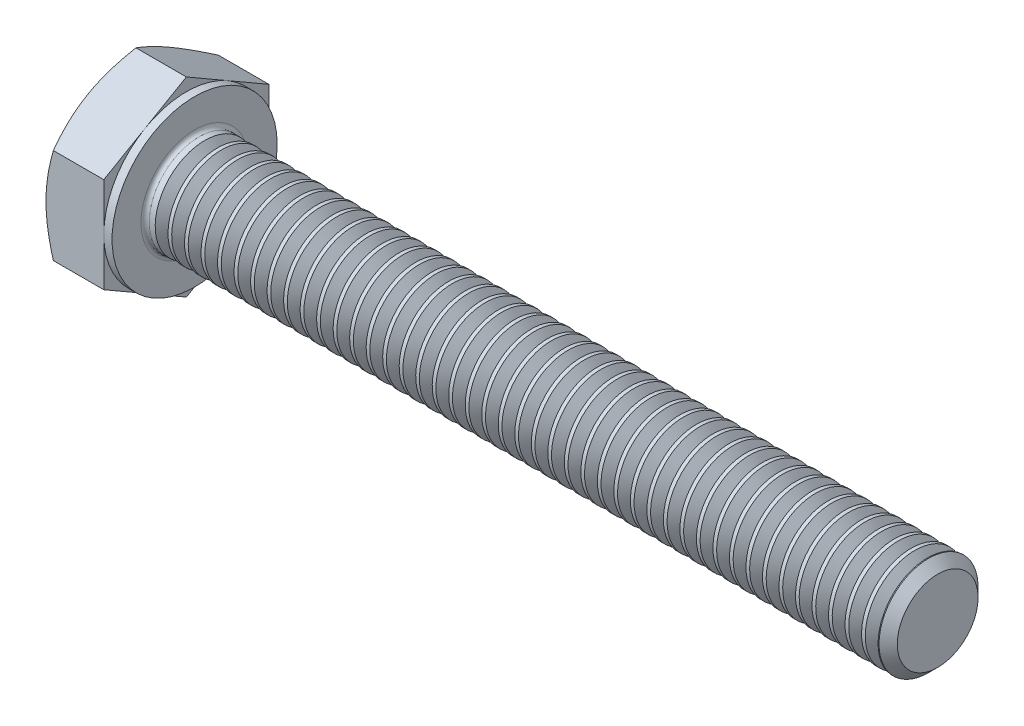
ISO-10303-21;
HEADER;
FILE_DESCRIPTION(('STEP AP214'),'2;1');
FILE_NAME('part.step','',(''),(''),'','','');
FILE_SCHEMA(('AUTOMOTIVE_DESIGN { 1 0 10303 214 1 1 1 1 }'));
ENDSEC;
DATA;
#1=APPLICATION_CONTEXT('core data for automotive mechanical design processes');
#2=APPLICATION_PROTOCOL_DEFINITION('international standard','automotive_design',2000,#1);
#3=PRODUCT_CONTEXT('',#1,'mechanical');
#4=PRODUCT('Part','Part','',(#3));
#5=PRODUCT_RELATED_PRODUCT_CATEGORY('part','',(#4));
#6=PRODUCT_DEFINITION_FORMATION('','',#4);
#7=PRODUCT_DEFINITION_CONTEXT('part definition',#1,'design');
#8=PRODUCT_DEFINITION('design','',#6,#7);
#9=PRODUCT_DEFINITION_SHAPE('','',#8);
#10=(LENGTH_UNIT() NAMED_UNIT(*) SI_UNIT(.MILLI.,.METRE.));
#11=(NAMED_UNIT(*) PLANE_ANGLE_UNIT() SI_UNIT($,.RADIAN.));
#12=(NAMED_UNIT(*) SI_UNIT($,.STERADIAN.) SOLID_ANGLE_UNIT());
#13=UNCERTAINTY_MEASURE_WITH_UNIT(LENGTH_MEASURE(1.E-05),#10,'distance_accuracy_value','');
#14=(GEOMETRIC_REPRESENTATION_CONTEXT(3) GLOBAL_UNCERTAINTY_ASSIGNED_CONTEXT((#13)) GLOBAL_UNIT_ASSIGNED_CONTEXT((#10,
#11,#12)) REPRESENTATION_CONTEXT('',''));
#15=CARTESIAN_POINT('',(0.,0.,0.));
#16=DIRECTION('',(0.,0.,1.));
#17=DIRECTION('',(1.,0.,0.));
#18=AXIS2_PLACEMENT_3D('',#15,#16,#17);
#19=CARTESIAN_POINT('',(4.,5.77350269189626,0.));
#20=DIRECTION('',(1.,0.,0.));
#21=DIRECTION('',(0.,0.,-1.));
#22=AXIS2_PLACEMENT_3D('',#19,#20,#21);
#23=PLANE('',#22);
#24=CARTESIAN_POINT('',(4.,0.,0.));
#25=DIRECTION('',(1.,0.,0.));
#26=DIRECTION('',(0.,0.,-1.));
#27=AXIS2_PLACEMENT_3D('',#24,#25,#26);
#28=CIRCLE('',#27,3.25);
#29=CARTESIAN_POINT('',(4.,0.,-3.25));
#30=VERTEX_POINT('',#29);
#31=EDGE_CURVE('E45',#30,#30,#28,.F.);
#32=ORIENTED_EDGE('',*,*,#31,.T.);
#33=EDGE_LOOP('',(#32));
#34=FACE_BOUND('',#33,.T.);
#35=CARTESIAN_POINT('',(4.,0.,0.));
#36=DIRECTION('',(1.,0.,0.));
#37=DIRECTION('',(0.,0.,-1.));
#38=AXIS2_PLACEMENT_3D('',#35,#36,#37);
#39=CIRCLE('',#38,5.);
#40=CARTESIAN_POINT('',(4.,0.,-5.));
#41=VERTEX_POINT('',#40);
#42=EDGE_CURVE('E308',#41,#41,#39,.T.);
#43=ORIENTED_EDGE('',*,*,#42,.T.);
#44=EDGE_LOOP('',(#43));
#45=FACE_BOUND('',#44,.T.);
#46=ADVANCED_FACE('F37',(#34,#45),#23,.T.);
#47=CARTESIAN_POINT('',(0.,0.,0.));
#48=DIRECTION('',(-1.,0.,0.));
#49=DIRECTION('',(0.,0.,1.));
#50=AXIS2_PLACEMENT_3D('',#47,#48,#49);
#51=CYLINDRICAL_SURFACE('',#50,3.);
#52=CARTESIAN_POINT('',(4.61173492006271,0.,0.));
#53=DIRECTION('',(-1.,0.,0.));
#54=DIRECTION('',(0.,-1.,0.));
#55=AXIS2_PLACEMENT_3D('',#52,#53,#54);
#56=CIRCLE('',#55,3.);
#57=CARTESIAN_POINT('',(4.61173492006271,-3.,0.));
#58=VERTEX_POINT('',#57);
#59=EDGE_CURVE('E355',#58,#58,#56,.T.);
#60=ORIENTED_EDGE('',*,*,#59,.T.);
#61=EDGE_LOOP('',(#60));
#62=FACE_BOUND('',#61,.T.);
#63=CARTESIAN_POINT('',(4.25,0.,0.));
#64=DIRECTION('',(1.,0.,0.));
#65=DIRECTION('',(0.,0.,-1.));
#66=AXIS2_PLACEMENT_3D('',#63,#64,#65);
#67=CIRCLE('',#66,3.);
#68=CARTESIAN_POINT('',(4.25,0.,-3.));
#69=VERTEX_POINT('',#68);
#70=EDGE_CURVE('E11',#69,#69,#67,.T.);
#71=ORIENTED_EDGE('',*,*,#70,.T.);
#72=EDGE_LOOP('',(#71));
#73=FACE_BOUND('',#72,.T.);
#74=ADVANCED_FACE('F257',(#62,#73),#51,.T.);
#75=CARTESIAN_POINT('',(3.5,5.,0.));
#76=DIRECTION('',(1.,0.,0.));
#77=DIRECTION('',(0.,0.,-1.));
#78=AXIS2_PLACEMENT_3D('',#75,#76,#77);
#79=PLANE('',#78);
#80=DIRECTION('',(0.,0.500000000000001,0.866025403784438));
#81=VECTOR('',#80,1.);
#82=CARTESIAN_POINT('',(3.5,2.88675134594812,-5.));
#83=LINE('',#82,#81);
#84=CARTESIAN_POINT('',(3.5,2.88675134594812,-5.));
#85=VERTEX_POINT('',#84);
#86=CARTESIAN_POINT('',(3.5,4.33012701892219,-2.50000000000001));
#87=VERTEX_POINT('',#86);
#88=EDGE_CURVE('E170',#85,#87,#83,.T.);
#89=ORIENTED_EDGE('',*,*,#88,.T.);
#90=CARTESIAN_POINT('',(3.5,0.,0.));
#91=DIRECTION('',(-1.,0.,0.));
#92=DIRECTION('',(0.,0.,1.));
#93=AXIS2_PLACEMENT_3D('',#90,#91,#92);
#94=CIRCLE('',#93,5.);
#95=CARTESIAN_POINT('',(3.5,0.,-5.));
#96=VERTEX_POINT('',#95);
#97=EDGE_CURVE('E52',#87,#96,#94,.T.);
#98=ORIENTED_EDGE('',*,*,#97,.T.);
#99=DIRECTION('',(0.,1.,0.));
#100=VECTOR('',#99,1.);
#101=CARTESIAN_POINT('',(3.5,2.88675134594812,-5.));
#102=LINE('',#101,#100);
#103=EDGE_CURVE('E311',#96,#85,#102,.T.);
#104=ORIENTED_EDGE('',*,*,#103,.T.);
#105=EDGE_LOOP('',(#89,#98,#104));
#106=FACE_BOUND('',#105,.T.);
#107=ADVANCED_FACE('F262',(#106),#79,.T.);
#108=CARTESIAN_POINT('',(3.5,5.77350269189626,0.));
#109=VERTEX_POINT('',#108);
#110=EDGE_CURVE('E168',#87,#109,#83,.T.);
#111=ORIENTED_EDGE('',*,*,#110,.T.);
#112=DIRECTION('',(0.,-0.500000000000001,0.866025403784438));
#113=VECTOR('',#112,1.);
#114=CARTESIAN_POINT('',(3.5,5.77350269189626,0.));
#115=LINE('',#114,#113);
#116=CARTESIAN_POINT('',(3.5,4.33012701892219,2.50000000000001));
#117=VERTEX_POINT('',#116);
#118=EDGE_CURVE('E167',#109,#117,#115,.T.);
#119=ORIENTED_EDGE('',*,*,#118,.T.);
#120=EDGE_CURVE('E156',#117,#87,#94,.T.);
#121=ORIENTED_EDGE('',*,*,#120,.T.);
#122=EDGE_LOOP('',(#111,#119,#121));
#123=FACE_BOUND('',#122,.T.);
#124=ADVANCED_FACE('F331',(#123),#79,.T.);
#125=CARTESIAN_POINT('',(3.5,2.88675134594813,5.));
#126=VERTEX_POINT('',#125);
#127=EDGE_CURVE('E134',#117,#126,#115,.T.);
#128=ORIENTED_EDGE('',*,*,#127,.T.);
#129=DIRECTION('',(0.,-1.,0.));
#130=VECTOR('',#129,1.);
#131=CARTESIAN_POINT('',(3.5,2.88675134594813,5.));
#132=LINE('',#131,#130);
#133=CARTESIAN_POINT('',(3.5,0.,5.));
#134=VERTEX_POINT('',#133);
#135=EDGE_CURVE('E128',#126,#134,#132,.T.);
#136=ORIENTED_EDGE('',*,*,#135,.T.);
#137=EDGE_CURVE('E132',#134,#117,#94,.T.);
#138=ORIENTED_EDGE('',*,*,#137,.T.);
#139=EDGE_LOOP('',(#128,#136,#138));
#140=FACE_BOUND('',#139,.T.);
#141=ADVANCED_FACE('F130',(#140),#79,.T.);
#142=CARTESIAN_POINT('',(3.5,-2.88675134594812,5.));
#143=VERTEX_POINT('',#142);
#144=EDGE_CURVE('E138',#134,#143,#132,.T.);
#145=ORIENTED_EDGE('',*,*,#144,.T.);
#146=DIRECTION('',(0.,-0.500000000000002,-0.866025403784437));
#147=VECTOR('',#146,1.);
#148=CARTESIAN_POINT('',(3.5,-5.77350269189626,0.));
#149=LINE('',#148,#147);
#150=CARTESIAN_POINT('',(3.5,-4.33012701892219,2.50000000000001));
#151=VERTEX_POINT('',#150);
#152=EDGE_CURVE('E145',#143,#151,#149,.T.);
#153=ORIENTED_EDGE('',*,*,#152,.T.);
#154=EDGE_CURVE('E142',#151,#134,#94,.T.);
#155=ORIENTED_EDGE('',*,*,#154,.T.);
#156=EDGE_LOOP('',(#145,#153,#155));
#157=FACE_BOUND('',#156,.T.);
#158=ADVANCED_FACE('F143',(#157),#79,.T.);
#159=CARTESIAN_POINT('',(3.5,-5.77350269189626,0.));
#160=VERTEX_POINT('',#159);
#161=EDGE_CURVE('E162',#151,#160,#149,.T.);
#162=ORIENTED_EDGE('',*,*,#161,.T.);
#163=DIRECTION('',(0.,0.5,-0.866025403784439));
#164=VECTOR('',#163,1.);
#165=CARTESIAN_POINT('',(3.5,-2.88675134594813,-5.));
#166=LINE('',#165,#164);
#167=CARTESIAN_POINT('',(3.5,-4.33012701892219,-2.5));
#168=VERTEX_POINT('',#167);
#169=EDGE_CURVE('E351',#160,#168,#166,.T.);
#170=ORIENTED_EDGE('',*,*,#169,.T.);
#171=EDGE_CURVE('E149',#168,#151,#94,.T.);
#172=ORIENTED_EDGE('',*,*,#171,.T.);
#173=EDGE_LOOP('',(#162,#170,#172));
#174=FACE_BOUND('',#173,.T.);
#175=ADVANCED_FACE('F1373',(#174),#79,.T.);
#176=CARTESIAN_POINT('',(3.5,-2.88675134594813,-5.));
#177=VERTEX_POINT('',#176);
#178=EDGE_CURVE('E157',#168,#177,#166,.T.);
#179=ORIENTED_EDGE('',*,*,#178,.T.);
#180=EDGE_CURVE('E312',#177,#96,#102,.T.);
#181=ORIENTED_EDGE('',*,*,#180,.T.);
#182=EDGE_CURVE('E320',#96,#168,#94,.T.);
#183=ORIENTED_EDGE('',*,*,#182,.T.);
#184=EDGE_LOOP('',(#179,#181,#183));
#185=FACE_BOUND('',#184,.T.);
#186=ADVANCED_FACE('F319',(#185),#79,.T.);
#187=CARTESIAN_POINT('',(0.,0.,0.));
#188=DIRECTION('',(-1.,0.,0.));
#189=DIRECTION('',(0.,0.,1.));
#190=AXIS2_PLACEMENT_3D('',#187,#188,#189);
#191=CYLINDRICAL_SURFACE('',#190,5.);
#192=ORIENTED_EDGE('',*,*,#97,.F.);
#193=ORIENTED_EDGE('',*,*,#120,.F.);
#194=ORIENTED_EDGE('',*,*,#137,.F.);
#195=ORIENTED_EDGE('',*,*,#154,.F.);
#196=ORIENTED_EDGE('',*,*,#171,.F.);
#197=ORIENTED_EDGE('',*,*,#182,.F.);
#198=EDGE_LOOP('',(#192,#193,#194,#195,#196,#197));
#199=FACE_BOUND('',#198,.T.);
#200=ORIENTED_EDGE('',*,*,#42,.F.);
#201=EDGE_LOOP('',(#200));
#202=FACE_BOUND('',#201,.T.);
#203=ADVANCED_FACE('F153',(#199,#202),#191,.T.);
#204=CARTESIAN_POINT('',(0.,5.77350269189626,0.));
#205=DIRECTION('',(1.,0.,0.));
#206=DIRECTION('',(0.,0.,-1.));
#207=AXIS2_PLACEMENT_3D('',#204,#205,#206);
#208=PLANE('',#207);
#209=CARTESIAN_POINT('',(0.,0.,0.));
#210=DIRECTION('',(1.,0.,0.));
#211=DIRECTION('',(0.,0.,-1.));
#212=AXIS2_PLACEMENT_3D('',#209,#210,#211);
#213=CIRCLE('',#212,5.);
#214=CARTESIAN_POINT('',(0.,0.,-5.));
#215=VERTEX_POINT('',#214);
#216=CARTESIAN_POINT('',(0.,4.33012701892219,-2.50000000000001));
#217=VERTEX_POINT('',#216);
#218=EDGE_CURVE('E307',#215,#217,#213,.T.);
#219=ORIENTED_EDGE('',*,*,#218,.F.);
#220=CARTESIAN_POINT('',(0.,-4.33012701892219,-2.5));
#221=VERTEX_POINT('',#220);
#222=EDGE_CURVE('E303',#221,#215,#213,.T.);
#223=ORIENTED_EDGE('',*,*,#222,.F.);
#224=CARTESIAN_POINT('',(0.,-4.33012701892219,2.50000000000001));
#225=VERTEX_POINT('',#224);
#226=EDGE_CURVE('E306',#225,#221,#213,.T.);
#227=ORIENTED_EDGE('',*,*,#226,.F.);
#228=CARTESIAN_POINT('',(0.,0.,5.));
#229=VERTEX_POINT('',#228);
#230=EDGE_CURVE('E344',#229,#225,#213,.T.);
#231=ORIENTED_EDGE('',*,*,#230,.F.);
#232=CARTESIAN_POINT('',(0.,0.,0.));
#233=DIRECTION('',(-1.,0.,0.));
#234=DIRECTION('',(0.,0.,1.));
#235=AXIS2_PLACEMENT_3D('',#232,#233,#234);
#236=CIRCLE('',#235,5.);
#237=CARTESIAN_POINT('',(0.,4.33012701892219,2.50000000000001));
#238=VERTEX_POINT('',#237);
#239=EDGE_CURVE('E171',#229,#238,#236,.T.);
#240=ORIENTED_EDGE('',*,*,#239,.T.);
#241=EDGE_CURVE('E2250',#217,#238,#213,.T.);
#242=ORIENTED_EDGE('',*,*,#241,.F.);
#243=EDGE_LOOP('',(#219,#223,#227,#231,#240,#242));
#244=FACE_BOUND('',#243,.T.);
#245=ADVANCED_FACE('F202',(#244),#208,.F.);
#246=CARTESIAN_POINT('',(0.,0.,0.));
#247=DIRECTION('',(1.,0.,0.));
#248=DIRECTION('',(0.,0.,-1.));
#249=AXIS2_PLACEMENT_3D('',#246,#247,#248);
#250=CONICAL_SURFACE('',#249,5.,1.0471975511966);
#251=CARTESIAN_POINT('',(0.446648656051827,2.88663587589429,5.0002));
#252=CARTESIAN_POINT('',(0.373386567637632,3.01349970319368,4.78046540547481));
#253=CARTESIAN_POINT('',(0.30675132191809,3.14144859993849,4.55885141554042));
#254=CARTESIAN_POINT('',(0.190438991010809,3.39956193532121,4.11178600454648));
#255=CARTESIAN_POINT('',(0.140803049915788,3.52973095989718,3.88632664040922));
#256=CARTESIAN_POINT('',(0.0635510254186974,3.78847564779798,3.43816769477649));
#257=CARTESIAN_POINT('',(0.0354203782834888,3.91701101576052,3.21553790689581));
#258=CARTESIAN_POINT('',(0.0101949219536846,4.11026620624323,2.88081009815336));
#259=CARTESIAN_POINT('',(0.00461345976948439,4.17472868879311,2.76915780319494));
#260=CARTESIAN_POINT('',(-0.000797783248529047,4.30371322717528,2.5457500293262));
#261=CARTESIAN_POINT('',(-0.00062774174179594,4.36823528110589,2.43399455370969));
#262=CARTESIAN_POINT('',(0.00775363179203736,4.54500768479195,2.12781576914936));
#263=CARTESIAN_POINT('',(0.0218297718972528,4.65719946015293,1.93349391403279));
#264=CARTESIAN_POINT('',(0.0664652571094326,4.88083840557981,1.54613989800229));
#265=CARTESIAN_POINT('',(0.0970398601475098,4.99228478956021,1.35310909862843));
#266=CARTESIAN_POINT('',(0.173468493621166,5.21637431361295,0.964974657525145));
#267=CARTESIAN_POINT('',(0.219646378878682,5.32898917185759,0.769920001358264));
#268=CARTESIAN_POINT('',(0.324451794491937,5.55253939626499,0.382719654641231));
#269=CARTESIAN_POINT('',(0.383054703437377,5.66347762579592,0.190569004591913));
#270=CARTESIAN_POINT('',(0.446648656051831,5.7736181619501,-0.000200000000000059));
#271=B_SPLINE_CURVE_WITH_KNOTS('',3,(#251,#252,#253,#254,#255,#256,#257,#258,#259,#260,#261,
#262,#263,#264,#265,#266,#267,#268,#269,#270),.UNSPECIFIED.,.F.,.F.,(4,2,2,2,2,2,2,2,2,4),(0.,
0.792555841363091,1.58701660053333,2.3618153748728,2.74884076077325,3.13585419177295,
3.80962362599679,4.48401723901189,5.17336882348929,5.86136694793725),.UNSPECIFIED.);
#272=CARTESIAN_POINT('',(0.446581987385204,5.77350269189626,0.));
#273=VERTEX_POINT('',#272);
#274=EDGE_CURVE('E222',#238,#273,#271,.T.);
#275=ORIENTED_EDGE('',*,*,#274,.T.);
#276=CARTESIAN_POINT('',(0.446648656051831,5.7736181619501,0.000199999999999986));
#277=CARTESIAN_POINT('',(0.373386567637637,5.64675433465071,-0.219534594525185));
#278=CARTESIAN_POINT('',(0.306751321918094,5.5188054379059,-0.44114858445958));
#279=CARTESIAN_POINT('',(0.190438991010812,5.26069210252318,-0.888213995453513));
#280=CARTESIAN_POINT('',(0.140803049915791,5.13052307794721,-1.11367335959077));
#281=CARTESIAN_POINT('',(0.0635510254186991,4.87177839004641,-1.56183230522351));
#282=CARTESIAN_POINT('',(0.0354203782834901,4.74324302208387,-1.78446209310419));
#283=CARTESIAN_POINT('',(0.0101949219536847,4.54998783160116,-2.11918990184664));
#284=CARTESIAN_POINT('',(0.00461345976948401,4.48552534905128,-2.23084219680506));
#285=CARTESIAN_POINT('',(-0.000797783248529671,4.35654081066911,-2.4542499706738));
#286=CARTESIAN_POINT('',(-0.000627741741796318,4.2920187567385,-2.56600544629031));
#287=CARTESIAN_POINT('',(0.00775363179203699,4.11524635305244,-2.87218423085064));
#288=CARTESIAN_POINT('',(0.0218297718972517,4.00305457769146,-3.06650608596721));
#289=CARTESIAN_POINT('',(0.0664652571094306,3.77941563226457,-3.45386010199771));
#290=CARTESIAN_POINT('',(0.0970398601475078,3.66796924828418,-3.64689090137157));
#291=CARTESIAN_POINT('',(0.173468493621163,3.44387972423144,-4.03502534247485));
#292=CARTESIAN_POINT('',(0.219646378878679,3.3312648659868,-4.23007999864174));
#293=CARTESIAN_POINT('',(0.324451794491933,3.1077146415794,-4.61728034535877));
#294=CARTESIAN_POINT('',(0.383054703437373,2.99677641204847,-4.80943099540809));
#295=CARTESIAN_POINT('',(0.446648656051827,2.88663587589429,-5.0002));
#296=B_SPLINE_CURVE_WITH_KNOTS('',3,(#276,#277,#278,#279,#280,#281,#282,#283,#284,#285,#286,
#287,#288,#289,#290,#291,#292,#293,#294,#295),.UNSPECIFIED.,.F.,.F.,(4,2,2,2,2,2,2,2,2,4),(0.,
0.792555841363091,1.58701660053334,2.36181537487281,2.74884076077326,3.13585419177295,
3.8096236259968,4.4840172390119,5.17336882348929,5.86136694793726),.UNSPECIFIED.);
#297=EDGE_CURVE('E60',#273,#217,#296,.T.);
#298=ORIENTED_EDGE('',*,*,#297,.T.);
#299=ORIENTED_EDGE('',*,*,#241,.T.);
#300=EDGE_LOOP('',(#275,#298,#299));
#301=FACE_BOUND('',#300,.T.);
#302=ADVANCED_FACE('F1403',(#301),#250,.T.);
#303=CARTESIAN_POINT('',(2.47533544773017,-7.82661640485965,5.));
#304=CARTESIAN_POINT('',(2.36879683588,-7.60758613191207,5.));
#305=CARTESIAN_POINT('',(2.2632591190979,-7.38806071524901,5.));
#306=CARTESIAN_POINT('',(2.05474707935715,-6.94775649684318,5.));
#307=CARTESIAN_POINT('',(1.9517731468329,-6.72697751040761,5.));
#308=CARTESIAN_POINT('',(1.74844778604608,-6.28280027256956,5.));
#309=CARTESIAN_POINT('',(1.64811306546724,-6.0593943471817,5.));
#310=CARTESIAN_POINT('',(1.45145486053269,-5.61083043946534,5.));
#311=CARTESIAN_POINT('',(1.35513119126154,-5.38567253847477,5.));
#312=CARTESIAN_POINT('',(1.16445037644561,-4.92576614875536,5.));
#313=CARTESIAN_POINT('',(1.07026351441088,-4.69094667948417,5.));
#314=CARTESIAN_POINT('',(0.888844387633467,-4.21858752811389,5.));
#315=CARTESIAN_POINT('',(0.801612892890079,-3.98104754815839,5.));
#316=CARTESIAN_POINT('',(0.636341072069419,-3.50329086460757,5.));
#317=CARTESIAN_POINT('',(0.558282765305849,-3.26308044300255,5.));
#318=CARTESIAN_POINT('',(0.413813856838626,-2.77921467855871,5.));
#319=CARTESIAN_POINT('',(0.347399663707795,-2.53556042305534,5.));
#320=CARTESIAN_POINT('',(0.229707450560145,-2.04600448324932,5.));
#321=CARTESIAN_POINT('',(0.178346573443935,-1.80012308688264,5.));
#322=CARTESIAN_POINT('',(0.0936230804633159,-1.30522837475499,5.));
#323=CARTESIAN_POINT('',(0.0602585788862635,-1.05621538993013,5.));
#324=CARTESIAN_POINT('',(0.0146229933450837,-0.559584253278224,5.));
#325=CARTESIAN_POINT('',(0.00207498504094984,-0.311992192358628,5.));
#326=CARTESIAN_POINT('',(-0.00159747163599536,0.183375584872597,5.));
#327=CARTESIAN_POINT('',(0.00727849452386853,0.431151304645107,5.));
#328=CARTESIAN_POINT('',(0.0397265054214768,0.849622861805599,5.));
#329=CARTESIAN_POINT('',(0.0579847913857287,1.02075746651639,5.));
#330=CARTESIAN_POINT('',(0.103624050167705,1.36181398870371,5.));
#331=CARTESIAN_POINT('',(0.131006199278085,1.53173574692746,5.));
#332=CARTESIAN_POINT('',(0.225403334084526,2.03942834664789,5.));
#333=CARTESIAN_POINT('',(0.304653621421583,2.37495177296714,5.));
#334=CARTESIAN_POINT('',(0.442611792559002,2.87686006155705,5.));
#335=CARTESIAN_POINT('',(0.492453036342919,3.04583048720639,5.));
#336=CARTESIAN_POINT('',(0.59744196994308,3.38213061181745,5.));
#337=CARTESIAN_POINT('',(0.652589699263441,3.54946029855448,5.));
#338=CARTESIAN_POINT('',(0.767295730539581,3.88253122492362,5.));
#339=CARTESIAN_POINT('',(0.82685271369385,4.04827292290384,5.));
#340=CARTESIAN_POINT('',(0.949663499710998,4.37837269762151,5.));
#341=CARTESIAN_POINT('',(1.01291722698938,4.54273080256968,5.));
#342=CARTESIAN_POINT('',(1.18384085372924,4.97467594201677,5.));
#343=CARTESIAN_POINT('',(1.29410564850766,5.24123504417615,5.));
#344=CARTESIAN_POINT('',(1.5208504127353,5.77170603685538,5.));
#345=CARTESIAN_POINT('',(1.63733099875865,6.0356176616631,5.));
#346=CARTESIAN_POINT('',(1.87507624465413,6.56138078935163,5.));
#347=CARTESIAN_POINT('',(1.99634255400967,6.82323154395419,5.));
#348=CARTESIAN_POINT('',(2.24254703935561,7.34518395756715,5.));
#349=CARTESIAN_POINT('',(2.36748508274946,7.60528567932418,5.));
#350=CARTESIAN_POINT('',(2.62044102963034,8.12446478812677,5.));
#351=CARTESIAN_POINT('',(2.74846325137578,8.38354006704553,5.));
#352=CARTESIAN_POINT('',(3.00682669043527,8.90053291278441,5.));
#353=CARTESIAN_POINT('',(3.1371679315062,9.15845046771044,5.));
#354=CARTESIAN_POINT('',(3.53092424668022,9.93067662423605,5.));
#355=CARTESIAN_POINT('',(3.79712405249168,10.443564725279,4.99999999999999));
#356=CARTESIAN_POINT('',(4.30724046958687,11.4147548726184,4.99999999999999));
#357=CARTESIAN_POINT('',(4.55067498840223,11.8733113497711,4.99999999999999));
#358=CARTESIAN_POINT('',(5.04052915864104,12.7888590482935,4.99999999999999));
#359=CARTESIAN_POINT('',(5.28694897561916,13.2458501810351,4.99999999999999));
#360=CARTESIAN_POINT('',(5.78122505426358,14.1571829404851,4.99999999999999));
#361=CARTESIAN_POINT('',(6.02907430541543,14.6115283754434,4.99999999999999));
#362=CARTESIAN_POINT('',(6.52648185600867,15.519239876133,4.99999999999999));
#363=CARTESIAN_POINT('',(6.7760400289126,15.9726060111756,4.99999999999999));
#364=CARTESIAN_POINT('',(7.02622264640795,16.4256251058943,4.99999999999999));
#365=B_SPLINE_CURVE_WITH_KNOTS('',3,(#303,#304,#305,#306,#307,#308,#309,#310,#311,#312,#313,
#314,#315,#316,#317,#318,#319,#320,#321,#322,#323,#324,#325,#326,#327,#328,#329,#330,#331,#332,
#333,#334,#335,#336,#337,#338,#339,#340,#341,#342,#343,#344,#345,#346,#347,#348,#349,#350,#351,
#352,#353,#354,#355,#356,#357,#358,#359,#360,#361,#362,#363,#364),.UNSPECIFIED.,.F.,.F.,(4,2,2,
2,2,2,2,2,2,2,2,2,2,2,2,2,2,2,2,2,2,2,2,2,2,2,2,2,2,2,4),(0.,0.730708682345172,1.46152797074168,
2.19620403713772,2.93084619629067,3.6897749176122,4.4487875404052,5.20628666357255,
5.96355173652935,6.71656679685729,7.4695029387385,8.21233991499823,8.95519126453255,
9.4712599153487,9.98739512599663,11.0201893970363,11.5486465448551,12.0771076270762,
12.6054112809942,13.1337041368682,13.9989833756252,14.8643486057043,15.7300147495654,
16.5956496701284,17.4625765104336,18.329512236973,20.0630293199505,21.6205191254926,
23.1780957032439,24.7307447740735,26.2832800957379),.UNSPECIFIED.);
#366=CARTESIAN_POINT('',(0.4465819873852,2.88675134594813,5.));
#367=VERTEX_POINT('',#366);
#368=EDGE_CURVE('E236',#229,#367,#365,.T.);
#369=ORIENTED_EDGE('',*,*,#368,.T.);
#370=EDGE_CURVE('E235',#367,#238,#271,.T.);
#371=ORIENTED_EDGE('',*,*,#370,.T.);
#372=ORIENTED_EDGE('',*,*,#239,.F.);
#373=EDGE_LOOP('',(#369,#371,#372));
#374=FACE_BOUND('',#373,.T.);
#375=ADVANCED_FACE('F338',(#374),#250,.T.);
#376=CARTESIAN_POINT('',(0.446581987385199,-2.88675134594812,5.));
#377=VERTEX_POINT('',#376);
#378=EDGE_CURVE('E288',#377,#229,#365,.T.);
#379=ORIENTED_EDGE('',*,*,#378,.T.);
#380=ORIENTED_EDGE('',*,*,#230,.T.);
#381=CARTESIAN_POINT('',(0.446648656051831,-5.7736181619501,-0.000200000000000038));
#382=CARTESIAN_POINT('',(0.373386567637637,-5.64675433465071,0.219534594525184));
#383=CARTESIAN_POINT('',(0.306751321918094,-5.5188054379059,0.44114858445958));
#384=CARTESIAN_POINT('',(0.190438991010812,-5.26069210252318,0.888213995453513));
#385=CARTESIAN_POINT('',(0.14080304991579,-5.13052307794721,1.11367335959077));
#386=CARTESIAN_POINT('',(0.0635510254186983,-4.87177839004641,1.56183230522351));
#387=CARTESIAN_POINT('',(0.0354203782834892,-4.74324302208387,1.78446209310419));
#388=CARTESIAN_POINT('',(0.0101949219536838,-4.54998783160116,2.11918990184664));
#389=CARTESIAN_POINT('',(0.00461345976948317,-4.48552534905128,2.23084219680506));
#390=CARTESIAN_POINT('',(-0.000797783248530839,-4.35654081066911,2.4542499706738));
#391=CARTESIAN_POINT('',(-0.000627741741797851,-4.2920187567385,2.56600544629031));
#392=CARTESIAN_POINT('',(0.00775363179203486,-4.11524635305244,2.87218423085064));
#393=CARTESIAN_POINT('',(0.0218297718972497,-4.00305457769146,3.06650608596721));
#394=CARTESIAN_POINT('',(0.0664652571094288,-3.77941563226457,3.45386010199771));
#395=CARTESIAN_POINT('',(0.097039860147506,-3.66796924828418,3.64689090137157));
#396=CARTESIAN_POINT('',(0.173468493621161,-3.44387972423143,4.03502534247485));
#397=CARTESIAN_POINT('',(0.219646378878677,-3.33126486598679,4.23007999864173));
#398=CARTESIAN_POINT('',(0.32445179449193,-3.1077146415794,4.61728034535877));
#399=CARTESIAN_POINT('',(0.38305470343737,-2.99677641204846,4.80943099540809));
#400=CARTESIAN_POINT('',(0.446648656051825,-2.88663587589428,5.0002));
#401=B_SPLINE_CURVE_WITH_KNOTS('',3,(#381,#382,#383,#384,#385,#386,#387,#388,#389,#390,#391,
#392,#393,#394,#395,#396,#397,#398,#399,#400),.UNSPECIFIED.,.F.,.F.,(4,2,2,2,2,2,2,2,2,4),(0.,
0.792555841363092,1.58701660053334,2.36181537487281,2.74884076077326,3.13585419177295,
3.8096236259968,4.4840172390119,5.17336882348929,5.86136694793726),.UNSPECIFIED.);
#402=EDGE_CURVE('E224',#225,#377,#401,.T.);
#403=ORIENTED_EDGE('',*,*,#402,.T.);
#404=EDGE_LOOP('',(#379,#380,#403));
#405=FACE_BOUND('',#404,.T.);
#406=ADVANCED_FACE('F191',(#405),#250,.T.);
#407=CARTESIAN_POINT('',(0.446581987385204,-5.77350269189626,0.));
#408=VERTEX_POINT('',#407);
#409=EDGE_CURVE('E216',#408,#225,#401,.T.);
#410=ORIENTED_EDGE('',*,*,#409,.T.);
#411=ORIENTED_EDGE('',*,*,#226,.T.);
#412=CARTESIAN_POINT('',(0.44664865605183,-2.8866358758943,-5.0002));
#413=CARTESIAN_POINT('',(0.373386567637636,-3.01349970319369,-4.78046540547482));
#414=CARTESIAN_POINT('',(0.306751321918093,-3.1414485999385,-4.55885141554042));
#415=CARTESIAN_POINT('',(0.190438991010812,-3.39956193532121,-4.11178600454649));
#416=CARTESIAN_POINT('',(0.140803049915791,-3.52973095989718,-3.88632664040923));
#417=CARTESIAN_POINT('',(0.0635510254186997,-3.78847564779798,-3.43816769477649));
#418=CARTESIAN_POINT('',(0.035420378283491,-3.91701101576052,-3.21553790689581));
#419=CARTESIAN_POINT('',(0.0101949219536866,-4.11026620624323,-2.88081009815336));
#420=CARTESIAN_POINT('',(0.0046134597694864,-4.17472868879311,-2.76915780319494));
#421=CARTESIAN_POINT('',(-0.000797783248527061,-4.30371322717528,-2.5457500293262));
#422=CARTESIAN_POINT('',(-0.000627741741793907,-4.36823528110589,-2.43399455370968));
#423=CARTESIAN_POINT('',(0.0077536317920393,-4.54500768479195,-2.12781576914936));
#424=CARTESIAN_POINT('',(0.0218297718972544,-4.65719946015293,-1.93349391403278));
#425=CARTESIAN_POINT('',(0.0664652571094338,-4.88083840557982,-1.54613989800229));
#426=CARTESIAN_POINT('',(0.0970398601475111,-4.99228478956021,-1.35310909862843));
#427=CARTESIAN_POINT('',(0.173468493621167,-5.21637431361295,-0.964974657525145));
#428=CARTESIAN_POINT('',(0.219646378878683,-5.32898917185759,-0.769920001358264));
#429=CARTESIAN_POINT('',(0.324451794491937,-5.55253939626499,-0.382719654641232));
#430=CARTESIAN_POINT('',(0.383054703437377,-5.66347762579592,-0.190569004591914));
#431=CARTESIAN_POINT('',(0.446648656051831,-5.7736181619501,0.000199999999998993));
#432=B_SPLINE_CURVE_WITH_KNOTS('',3,(#412,#413,#414,#415,#416,#417,#418,#419,#420,#421,#422,
#423,#424,#425,#426,#427,#428,#429,#430,#431),.UNSPECIFIED.,.F.,.F.,(4,2,2,2,2,2,2,2,2,4),(0.,
0.792555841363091,1.58701660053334,2.36181537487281,2.74884076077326,3.13585419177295,
3.80962362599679,4.48401723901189,5.17336882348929,5.86136694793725),.UNSPECIFIED.);
#433=EDGE_CURVE('E223',#221,#408,#432,.T.);
#434=ORIENTED_EDGE('',*,*,#433,.T.);
#435=EDGE_LOOP('',(#410,#411,#434));
#436=FACE_BOUND('',#435,.T.);
#437=ADVANCED_FACE('F1416',(#436),#250,.T.);
#438=CARTESIAN_POINT('',(0.446581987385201,2.88675134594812,-5.));
#439=VERTEX_POINT('',#438);
#440=EDGE_CURVE('E225',#217,#439,#296,.T.);
#441=ORIENTED_EDGE('',*,*,#440,.T.);
#442=CARTESIAN_POINT('',(2.47533544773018,-7.82661640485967,-5.));
#443=CARTESIAN_POINT('',(2.36879683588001,-7.60758613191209,-5.));
#444=CARTESIAN_POINT('',(2.2632591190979,-7.38806071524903,-5.));
#445=CARTESIAN_POINT('',(2.05474707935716,-6.9477564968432,-5.));
#446=CARTESIAN_POINT('',(1.95177314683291,-6.72697751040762,-5.));
#447=CARTESIAN_POINT('',(1.74844778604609,-6.28280027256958,-5.));
#448=CARTESIAN_POINT('',(1.64811306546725,-6.05939434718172,-5.));
#449=CARTESIAN_POINT('',(1.4514548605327,-5.61083043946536,-5.));
#450=CARTESIAN_POINT('',(1.35513119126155,-5.38567253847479,-5.));
#451=CARTESIAN_POINT('',(1.16445037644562,-4.92576614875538,-5.));
#452=CARTESIAN_POINT('',(1.07026351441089,-4.69094667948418,-5.));
#453=CARTESIAN_POINT('',(0.888844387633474,-4.21858752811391,-5.));
#454=CARTESIAN_POINT('',(0.801612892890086,-3.98104754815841,-5.));
#455=CARTESIAN_POINT('',(0.636341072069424,-3.50329086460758,-5.));
#456=CARTESIAN_POINT('',(0.558282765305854,-3.26308044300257,-5.));
#457=CARTESIAN_POINT('',(0.41381385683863,-2.77921467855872,-5.));
#458=CARTESIAN_POINT('',(0.347399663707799,-2.53556042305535,-5.));
#459=CARTESIAN_POINT('',(0.229707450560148,-2.04600448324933,-5.));
#460=CARTESIAN_POINT('',(0.178346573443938,-1.80012308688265,-5.));
#461=CARTESIAN_POINT('',(0.0936230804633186,-1.305228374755,-5.));
#462=CARTESIAN_POINT('',(0.0602585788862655,-1.05621538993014,-5.));
#463=CARTESIAN_POINT('',(0.014622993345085,-0.559584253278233,-5.));
#464=CARTESIAN_POINT('',(0.00207498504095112,-0.311992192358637,-5.));
#465=CARTESIAN_POINT('',(-0.00159747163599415,0.183375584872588,-5.));
#466=CARTESIAN_POINT('',(0.00727849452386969,0.431151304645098,-5.));
#467=CARTESIAN_POINT('',(0.0397265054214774,0.849622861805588,-5.));
#468=CARTESIAN_POINT('',(0.0579847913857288,1.02075746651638,-5.));
#469=CARTESIAN_POINT('',(0.103624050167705,1.3618139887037,-5.));
#470=CARTESIAN_POINT('',(0.131006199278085,1.53173574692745,-5.));
#471=CARTESIAN_POINT('',(0.225403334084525,2.03942834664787,-5.));
#472=CARTESIAN_POINT('',(0.304653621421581,2.37495177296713,-5.));
#473=CARTESIAN_POINT('',(0.442611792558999,2.87686006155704,-5.));
#474=CARTESIAN_POINT('',(0.492453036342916,3.04583048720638,-5.));
#475=CARTESIAN_POINT('',(0.597441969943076,3.38213061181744,-5.));
#476=CARTESIAN_POINT('',(0.652589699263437,3.54946029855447,-5.));
#477=CARTESIAN_POINT('',(0.767295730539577,3.88253122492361,-5.));
#478=CARTESIAN_POINT('',(0.826852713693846,4.04827292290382,-5.));
#479=CARTESIAN_POINT('',(0.949663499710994,4.37837269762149,-5.));
#480=CARTESIAN_POINT('',(1.01291722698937,4.54273080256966,-5.));
#481=CARTESIAN_POINT('',(1.18384085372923,4.97467594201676,-5.));
#482=CARTESIAN_POINT('',(1.29410564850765,5.24123504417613,-5.));
#483=CARTESIAN_POINT('',(1.5208504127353,5.77170603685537,-5.));
#484=CARTESIAN_POINT('',(1.63733099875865,6.03561766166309,-5.));
#485=CARTESIAN_POINT('',(1.87507624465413,6.56138078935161,-5.));
#486=CARTESIAN_POINT('',(1.99634255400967,6.82323154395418,-5.));
#487=CARTESIAN_POINT('',(2.24254703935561,7.34518395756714,-5.));
#488=CARTESIAN_POINT('',(2.36748508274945,7.60528567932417,-5.));
#489=CARTESIAN_POINT('',(2.62044102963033,8.12446478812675,-5.));
#490=CARTESIAN_POINT('',(2.74846325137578,8.38354006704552,-5.));
#491=CARTESIAN_POINT('',(3.00682669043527,8.9005329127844,-5.));
#492=CARTESIAN_POINT('',(3.1371679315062,9.15845046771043,-5.));
#493=CARTESIAN_POINT('',(3.53092424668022,9.93067662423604,-5.));
#494=CARTESIAN_POINT('',(3.79712405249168,10.443564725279,-5.));
#495=CARTESIAN_POINT('',(4.30724046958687,11.4147548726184,-5.));
#496=CARTESIAN_POINT('',(4.55067498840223,11.8733113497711,-5.));
#497=CARTESIAN_POINT('',(5.04052915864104,12.7888590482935,-5.));
#498=CARTESIAN_POINT('',(5.28694897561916,13.2458501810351,-5.));
#499=CARTESIAN_POINT('',(5.78122505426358,14.1571829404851,-5.));
#500=CARTESIAN_POINT('',(6.02907430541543,14.6115283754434,-5.));
#501=CARTESIAN_POINT('',(6.52648185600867,15.519239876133,-5.));
#502=CARTESIAN_POINT('',(6.7760400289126,15.9726060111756,-5.));
#503=CARTESIAN_POINT('',(7.02622264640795,16.4256251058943,-5.));
#504=B_SPLINE_CURVE_WITH_KNOTS('',3,(#442,#443,#444,#445,#446,#447,#448,#449,#450,#451,#452,
#453,#454,#455,#456,#457,#458,#459,#460,#461,#462,#463,#464,#465,#466,#467,#468,#469,#470,#471,
#472,#473,#474,#475,#476,#477,#478,#479,#480,#481,#482,#483,#484,#485,#486,#487,#488,#489,#490,
#491,#492,#493,#494,#495,#496,#497,#498,#499,#500,#501,#502,#503),.UNSPECIFIED.,.F.,.F.,(4,2,2,
2,2,2,2,2,2,2,2,2,2,2,2,2,2,2,2,2,2,2,2,2,2,2,2,2,2,2,4),(0.,0.730708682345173,1.46152797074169,
2.19620403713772,2.93084619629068,3.6897749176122,4.44878754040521,5.20628666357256,
5.96355173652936,6.7165667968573,7.46950293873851,8.21233991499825,8.95519126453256,
9.47125991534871,9.98739512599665,11.0201893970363,11.5486465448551,12.0771076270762,
12.6054112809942,13.1337041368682,13.9989833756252,14.8643486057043,15.7300147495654,
16.5956496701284,17.4625765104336,18.329512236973,20.0630293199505,21.6205191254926,
23.178095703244,24.7307447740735,26.2832800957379),.UNSPECIFIED.);
#505=EDGE_CURVE('E183',#439,#215,#504,.F.);
#506=ORIENTED_EDGE('',*,*,#505,.T.);
#507=ORIENTED_EDGE('',*,*,#218,.T.);
#508=EDGE_LOOP('',(#441,#506,#507));
#509=FACE_BOUND('',#508,.T.);
#510=ADVANCED_FACE('F1411',(#509),#250,.T.);
#511=CARTESIAN_POINT('',(0.446581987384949,-2.88675134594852,-5.));
#512=VERTEX_POINT('',#511);
#513=EDGE_CURVE('E184',#512,#221,#432,.T.);
#514=ORIENTED_EDGE('',*,*,#513,.T.);
#515=ORIENTED_EDGE('',*,*,#222,.T.);
#516=EDGE_CURVE('E174',#215,#512,#504,.F.);
#517=ORIENTED_EDGE('',*,*,#516,.T.);
#518=EDGE_LOOP('',(#514,#515,#517));
#519=FACE_BOUND('',#518,.T.);
#520=ADVANCED_FACE('F200',(#519),#250,.T.);
#521=CARTESIAN_POINT('',(4.,2.88675134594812,-5.));
#522=DIRECTION('',(0.,0.,1.));
#523=DIRECTION('',(0.,-1.,0.));
#524=AXIS2_PLACEMENT_3D('',#521,#522,#523);
#525=PLANE('',#524);
#526=ORIENTED_EDGE('',*,*,#180,.F.);
#527=DIRECTION('',(-1.,0.,0.));
#528=VECTOR('',#527,1.);
#529=CARTESIAN_POINT('',(4.,-2.88675134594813,-5.));
#530=LINE('',#529,#528);
#531=EDGE_CURVE('E294',#177,#512,#530,.T.);
#532=ORIENTED_EDGE('',*,*,#531,.T.);
#533=ORIENTED_EDGE('',*,*,#516,.F.);
#534=ORIENTED_EDGE('',*,*,#505,.F.);
#535=DIRECTION('',(-1.,0.,0.));
#536=VECTOR('',#535,1.);
#537=CARTESIAN_POINT('',(4.,2.88675134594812,-5.));
#538=LINE('',#537,#536);
#539=EDGE_CURVE('E290',#85,#439,#538,.T.);
#540=ORIENTED_EDGE('',*,*,#539,.F.);
#541=ORIENTED_EDGE('',*,*,#103,.F.);
#542=EDGE_LOOP('',(#526,#532,#533,#534,#540,#541));
#543=FACE_BOUND('',#542,.T.);
#544=ADVANCED_FACE('F195',(#543),#525,.F.);
#545=CARTESIAN_POINT('',(4.,-2.88675134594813,-5.));
#546=DIRECTION('',(0.,0.866025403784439,0.5));
#547=DIRECTION('',(0.,-0.5,0.866025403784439));
#548=AXIS2_PLACEMENT_3D('',#545,#546,#547);
#549=PLANE('',#548);
#550=ORIENTED_EDGE('',*,*,#169,.F.);
#551=DIRECTION('',(-1.,0.,0.));
#552=VECTOR('',#551,1.);
#553=CARTESIAN_POINT('',(4.,-5.77350269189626,0.));
#554=LINE('',#553,#552);
#555=EDGE_CURVE('E296',#160,#408,#554,.T.);
#556=ORIENTED_EDGE('',*,*,#555,.T.);
#557=ORIENTED_EDGE('',*,*,#433,.F.);
#558=ORIENTED_EDGE('',*,*,#513,.F.);
#559=ORIENTED_EDGE('',*,*,#531,.F.);
#560=ORIENTED_EDGE('',*,*,#178,.F.);
#561=EDGE_LOOP('',(#550,#556,#557,#558,#559,#560));
#562=FACE_BOUND('',#561,.T.);
#563=ADVANCED_FACE('F199',(#562),#549,.F.);
#564=CARTESIAN_POINT('',(4.,-5.77350269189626,0.));
#565=DIRECTION('',(0.,0.866025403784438,-0.500000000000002));
#566=DIRECTION('',(0.,0.500000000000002,0.866025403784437));
#567=AXIS2_PLACEMENT_3D('',#564,#565,#566);
#568=PLANE('',#567);
#569=ORIENTED_EDGE('',*,*,#152,.F.);
#570=DIRECTION('',(-1.,0.,0.));
#571=VECTOR('',#570,1.);
#572=CARTESIAN_POINT('',(4.,-2.88675134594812,5.));
#573=LINE('',#572,#571);
#574=EDGE_CURVE('E161',#143,#377,#573,.T.);
#575=ORIENTED_EDGE('',*,*,#574,.T.);
#576=ORIENTED_EDGE('',*,*,#402,.F.);
#577=ORIENTED_EDGE('',*,*,#409,.F.);
#578=ORIENTED_EDGE('',*,*,#555,.F.);
#579=ORIENTED_EDGE('',*,*,#161,.F.);
#580=EDGE_LOOP('',(#569,#575,#576,#577,#578,#579));
#581=FACE_BOUND('',#580,.T.);
#582=ADVANCED_FACE('F207',(#581),#568,.F.);
#583=CARTESIAN_POINT('',(4.,2.88675134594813,5.));
#584=DIRECTION('',(0.,0.,-1.));
#585=DIRECTION('',(0.,1.,0.));
#586=AXIS2_PLACEMENT_3D('',#583,#584,#585);
#587=PLANE('',#586);
#588=ORIENTED_EDGE('',*,*,#135,.F.);
#589=DIRECTION('',(-1.,0.,0.));
#590=VECTOR('',#589,1.);
#591=CARTESIAN_POINT('',(4.,2.88675134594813,5.));
#592=LINE('',#591,#590);
#593=EDGE_CURVE('E299',#126,#367,#592,.T.);
#594=ORIENTED_EDGE('',*,*,#593,.T.);
#595=ORIENTED_EDGE('',*,*,#368,.F.);
#596=ORIENTED_EDGE('',*,*,#378,.F.);
#597=ORIENTED_EDGE('',*,*,#574,.F.);
#598=ORIENTED_EDGE('',*,*,#144,.F.);
#599=EDGE_LOOP('',(#588,#594,#595,#596,#597,#598));
#600=FACE_BOUND('',#599,.T.);
#601=ADVANCED_FACE('F159',(#600),#587,.F.);
#602=CARTESIAN_POINT('',(4.,5.77350269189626,0.));
#603=DIRECTION('',(0.,-0.866025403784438,-0.500000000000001));
#604=DIRECTION('',(0.,0.500000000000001,-0.866025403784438));
#605=AXIS2_PLACEMENT_3D('',#602,#603,#604);
#606=PLANE('',#605);
#607=ORIENTED_EDGE('',*,*,#118,.F.);
#608=DIRECTION('',(-1.,0.,0.));
#609=VECTOR('',#608,1.);
#610=CARTESIAN_POINT('',(4.,5.77350269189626,0.));
#611=LINE('',#610,#609);
#612=EDGE_CURVE('E301',#109,#273,#611,.T.);
#613=ORIENTED_EDGE('',*,*,#612,.T.);
#614=ORIENTED_EDGE('',*,*,#274,.F.);
#615=ORIENTED_EDGE('',*,*,#370,.F.);
#616=ORIENTED_EDGE('',*,*,#593,.F.);
#617=ORIENTED_EDGE('',*,*,#127,.F.);
#618=EDGE_LOOP('',(#607,#613,#614,#615,#616,#617));
#619=FACE_BOUND('',#618,.T.);
#620=ADVANCED_FACE('F242',(#619),#606,.F.);
#621=CARTESIAN_POINT('',(4.,2.88675134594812,-5.));
#622=DIRECTION('',(0.,-0.866025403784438,0.500000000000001));
#623=DIRECTION('',(0.,-0.500000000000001,-0.866025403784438));
#624=AXIS2_PLACEMENT_3D('',#621,#622,#623);
#625=PLANE('',#624);
#626=ORIENTED_EDGE('',*,*,#88,.F.);
#627=ORIENTED_EDGE('',*,*,#539,.T.);
#628=ORIENTED_EDGE('',*,*,#440,.F.);
#629=ORIENTED_EDGE('',*,*,#297,.F.);
#630=ORIENTED_EDGE('',*,*,#612,.F.);
#631=ORIENTED_EDGE('',*,*,#110,.F.);
#632=EDGE_LOOP('',(#626,#627,#628,#629,#630,#631));
#633=FACE_BOUND('',#632,.T.);
#634=ADVANCED_FACE('F245',(#633),#625,.F.);
#635=CARTESIAN_POINT('',(4.25,0.,0.));
#636=DIRECTION('',(1.,0.,0.));
#637=DIRECTION('',(0.,0.,-1.));
#638=AXIS2_PLACEMENT_3D('',#635,#636,#637);
#639=TOROIDAL_SURFACE('',#638,3.25,0.25);
#640=ORIENTED_EDGE('',*,*,#70,.F.);
#641=EDGE_LOOP('',(#640));
#642=FACE_BOUND('',#641,.T.);
#643=ORIENTED_EDGE('',*,*,#31,.F.);
#644=EDGE_LOOP('',(#643));
#645=FACE_BOUND('',#644,.T.);
#646=ADVANCED_FACE('F39',(#642,#645),#639,.F.);
#647=CARTESIAN_POINT('',(5.38826507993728,0.,0.));
#648=DIRECTION('',(1.,0.,0.));
#649=DIRECTION('',(0.,1.,0.));
#650=AXIS2_PLACEMENT_3D('',#647,#648,#649);
#651=CONICAL_SURFACE('',#650,3.,0.959931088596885);
#652=CARTESIAN_POINT('',(5.,0.,0.));
#653=DIRECTION('',(-1.,0.,0.));
#654=DIRECTION('',(0.,-1.,0.));
#655=AXIS2_PLACEMENT_3D('',#652,#653,#654);
#656=CIRCLE('',#655,2.4455);
#657=CARTESIAN_POINT('',(5.,-2.4455,0.));
#658=VERTEX_POINT('',#657);
#659=EDGE_CURVE('E358',#658,#658,#656,.T.);
#660=ORIENTED_EDGE('',*,*,#659,.F.);
#661=EDGE_LOOP('',(#660));
#662=FACE_BOUND('',#661,.T.);
#663=CARTESIAN_POINT('',(5.38826507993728,0.,0.));
#664=DIRECTION('',(-1.,0.,0.));
#665=DIRECTION('',(0.,-1.,0.));
#666=AXIS2_PLACEMENT_3D('',#663,#664,#665);
#667=CIRCLE('',#666,3.);
#668=CARTESIAN_POINT('',(5.38826507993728,-3.,0.));
#669=VERTEX_POINT('',#668);
#670=EDGE_CURVE('E150',#669,#669,#667,.T.);
#671=ORIENTED_EDGE('',*,*,#670,.T.);
#672=EDGE_LOOP('',(#671));
#673=FACE_BOUND('',#672,.T.);
#674=ADVANCED_FACE('F253',(#662,#673),#651,.T.);
#675=CARTESIAN_POINT('',(5.,0.,0.));
#676=DIRECTION('',(-1.,0.,0.));
#677=DIRECTION('',(0.,-1.,0.));
#678=AXIS2_PLACEMENT_3D('',#675,#676,#677);
#679=CONICAL_SURFACE('',#678,2.4455,0.959931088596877);
#680=ORIENTED_EDGE('',*,*,#59,.F.);
#681=EDGE_LOOP('',(#680));
#682=FACE_BOUND('',#681,.T.);
#683=ORIENTED_EDGE('',*,*,#659,.T.);
#684=EDGE_LOOP('',(#683));
#685=FACE_BOUND('',#684,.T.);
#686=ADVANCED_FACE('F1346',(#682,#685),#679,.T.);
#687=CARTESIAN_POINT('',(5.61173492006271,0.,0.));
#688=DIRECTION('',(-1.,0.,0.));
#689=DIRECTION('',(0.,-1.,0.));
#690=AXIS2_PLACEMENT_3D('',#687,#688,#689);
#691=CIRCLE('',#690,3.);
#692=CARTESIAN_POINT('',(5.61173492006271,-3.,0.));
#693=VERTEX_POINT('',#692);
#694=EDGE_CURVE('E364',#693,#693,#691,.T.);
#695=ORIENTED_EDGE('',*,*,#694,.T.);
#696=EDGE_LOOP('',(#695));
#697=FACE_BOUND('',#696,.T.);
#698=ORIENTED_EDGE('',*,*,#670,.F.);
#699=EDGE_LOOP('',(#698));
#700=FACE_BOUND('',#699,.T.);
#701=ADVANCED_FACE('F266',(#697,#700),#51,.T.);
#702=CARTESIAN_POINT('',(6.38826507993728,0.,0.));
#703=DIRECTION('',(1.,0.,0.));
#704=DIRECTION('',(0.,1.,0.));
#705=AXIS2_PLACEMENT_3D('',#702,#703,#704);
#706=CONICAL_SURFACE('',#705,3.,0.959931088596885);
#707=CARTESIAN_POINT('',(6.,0.,0.));
#708=DIRECTION('',(-1.,0.,0.));
#709=DIRECTION('',(0.,-1.,0.));
#710=AXIS2_PLACEMENT_3D('',#707,#708,#709);
#711=CIRCLE('',#710,2.4455);
#712=CARTESIAN_POINT('',(6.,-2.4455,0.));
#713=VERTEX_POINT('',#712);
#714=EDGE_CURVE('E367',#713,#713,#711,.T.);
#715=ORIENTED_EDGE('',*,*,#714,.F.);
#716=EDGE_LOOP('',(#715));
#717=FACE_BOUND('',#716,.T.);
#718=CARTESIAN_POINT('',(6.38826507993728,0.,0.));
#719=DIRECTION('',(-1.,0.,0.));
#720=DIRECTION('',(0.,-1.,0.));
#721=AXIS2_PLACEMENT_3D('',#718,#719,#720);
#722=CIRCLE('',#721,3.);
#723=CARTESIAN_POINT('',(6.38826507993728,-3.,0.));
#724=VERTEX_POINT('',#723);
#725=EDGE_CURVE('E361',#724,#724,#722,.T.);
#726=ORIENTED_EDGE('',*,*,#725,.T.);
#727=EDGE_LOOP('',(#726));
#728=FACE_BOUND('',#727,.T.);
#729=ADVANCED_FACE('F1341',(#717,#728),#706,.T.);
#730=CARTESIAN_POINT('',(6.,0.,0.));
#731=DIRECTION('',(-1.,0.,0.));
#732=DIRECTION('',(0.,-1.,0.));
#733=AXIS2_PLACEMENT_3D('',#730,#731,#732);
#734=CONICAL_SURFACE('',#733,2.4455,0.959931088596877);
#735=ORIENTED_EDGE('',*,*,#694,.F.);
#736=EDGE_LOOP('',(#735));
#737=FACE_BOUND('',#736,.T.);
#738=ORIENTED_EDGE('',*,*,#714,.T.);
#739=EDGE_LOOP('',(#738));
#740=FACE_BOUND('',#739,.T.);
#741=ADVANCED_FACE('F1333',(#737,#740),#734,.T.);
#742=CARTESIAN_POINT('',(6.61173492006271,0.,0.));
#743=DIRECTION('',(-1.,0.,0.));
#744=DIRECTION('',(0.,-1.,0.));
#745=AXIS2_PLACEMENT_3D('',#742,#743,#744);
#746=CIRCLE('',#745,3.);
#747=CARTESIAN_POINT('',(6.61173492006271,-3.,0.));
#748=VERTEX_POINT('',#747);
#749=EDGE_CURVE('E373',#748,#748,#746,.T.);
#750=ORIENTED_EDGE('',*,*,#749,.T.);
#751=EDGE_LOOP('',(#750));
#752=FACE_BOUND('',#751,.T.);
#753=ORIENTED_EDGE('',*,*,#725,.F.);
#754=EDGE_LOOP('',(#753));
#755=FACE_BOUND('',#754,.T.);
#756=ADVANCED_FACE('F1321',(#752,#755),#51,.T.);
#757=CARTESIAN_POINT('',(7.38826507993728,0.,0.));
#758=DIRECTION('',(1.,0.,0.));
#759=DIRECTION('',(0.,1.,0.));
#760=AXIS2_PLACEMENT_3D('',#757,#758,#759);
#761=CONICAL_SURFACE('',#760,3.,0.959931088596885);
#762=CARTESIAN_POINT('',(7.,0.,0.));
#763=DIRECTION('',(-1.,0.,0.));
#764=DIRECTION('',(0.,-1.,0.));
#765=AXIS2_PLACEMENT_3D('',#762,#763,#764);
#766=CIRCLE('',#765,2.4455);
#767=CARTESIAN_POINT('',(7.,-2.4455,0.));
#768=VERTEX_POINT('',#767);
#769=EDGE_CURVE('E376',#768,#768,#766,.T.);
#770=ORIENTED_EDGE('',*,*,#769,.F.);
#771=EDGE_LOOP('',(#770));
#772=FACE_BOUND('',#771,.T.);
#773=CARTESIAN_POINT('',(7.38826507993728,0.,0.));
#774=DIRECTION('',(-1.,0.,0.));
#775=DIRECTION('',(0.,-1.,0.));
#776=AXIS2_PLACEMENT_3D('',#773,#774,#775);
#777=CIRCLE('',#776,3.);
#778=CARTESIAN_POINT('',(7.38826507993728,-3.,0.));
#779=VERTEX_POINT('',#778);
#780=EDGE_CURVE('E370',#779,#779,#777,.T.);
#781=ORIENTED_EDGE('',*,*,#780,.T.);
#782=EDGE_LOOP('',(#781));
#783=FACE_BOUND('',#782,.T.);
#784=ADVANCED_FACE('F1328',(#772,#783),#761,.T.);
#785=CARTESIAN_POINT('',(7.,0.,0.));
#786=DIRECTION('',(-1.,0.,0.));
#787=DIRECTION('',(0.,-1.,0.));
#788=AXIS2_PLACEMENT_3D('',#785,#786,#787);
#789=CONICAL_SURFACE('',#788,2.4455,0.959931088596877);
#790=ORIENTED_EDGE('',*,*,#749,.F.);
#791=EDGE_LOOP('',(#790));
#792=FACE_BOUND('',#791,.T.);
#793=ORIENTED_EDGE('',*,*,#769,.T.);
#794=EDGE_LOOP('',(#793));
#795=FACE_BOUND('',#794,.T.);
#796=ADVANCED_FACE('F1319',(#792,#795),#789,.T.);
#797=CARTESIAN_POINT('',(7.61173492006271,0.,0.));
#798=DIRECTION('',(-1.,0.,0.));
#799=DIRECTION('',(0.,-1.,0.));
#800=AXIS2_PLACEMENT_3D('',#797,#798,#799);
#801=CIRCLE('',#800,3.);
#802=CARTESIAN_POINT('',(7.61173492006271,-3.,0.));
#803=VERTEX_POINT('',#802);
#804=EDGE_CURVE('E382',#803,#803,#801,.T.);
#805=ORIENTED_EDGE('',*,*,#804,.T.);
#806=EDGE_LOOP('',(#805));
#807=FACE_BOUND('',#806,.T.);
#808=ORIENTED_EDGE('',*,*,#780,.F.);
#809=EDGE_LOOP('',(#808));
#810=FACE_BOUND('',#809,.T.);
#811=ADVANCED_FACE('F1307',(#807,#810),#51,.T.);
#812=CARTESIAN_POINT('',(8.38826507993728,0.,0.));
#813=DIRECTION('',(1.,0.,0.));
#814=DIRECTION('',(0.,1.,0.));
#815=AXIS2_PLACEMENT_3D('',#812,#813,#814);
#816=CONICAL_SURFACE('',#815,3.,0.959931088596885);
#817=CARTESIAN_POINT('',(8.,0.,0.));
#818=DIRECTION('',(-1.,0.,0.));
#819=DIRECTION('',(0.,-1.,0.));
#820=AXIS2_PLACEMENT_3D('',#817,#818,#819);
#821=CIRCLE('',#820,2.4455);
#822=CARTESIAN_POINT('',(8.,-2.4455,0.));
#823=VERTEX_POINT('',#822);
#824=EDGE_CURVE('E385',#823,#823,#821,.T.);
#825=ORIENTED_EDGE('',*,*,#824,.F.);
#826=EDGE_LOOP('',(#825));
#827=FACE_BOUND('',#826,.T.);
#828=CARTESIAN_POINT('',(8.38826507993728,0.,0.));
#829=DIRECTION('',(-1.,0.,0.));
#830=DIRECTION('',(0.,-1.,0.));
#831=AXIS2_PLACEMENT_3D('',#828,#829,#830);
#832=CIRCLE('',#831,3.);
#833=CARTESIAN_POINT('',(8.38826507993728,-3.,0.));
#834=VERTEX_POINT('',#833);
#835=EDGE_CURVE('E379',#834,#834,#832,.T.);
#836=ORIENTED_EDGE('',*,*,#835,.T.);
#837=EDGE_LOOP('',(#836));
#838=FACE_BOUND('',#837,.T.);
#839=ADVANCED_FACE('F1314',(#827,#838),#816,.T.);
#840=CARTESIAN_POINT('',(8.,0.,0.));
#841=DIRECTION('',(-1.,0.,0.));
#842=DIRECTION('',(0.,-1.,0.));
#843=AXIS2_PLACEMENT_3D('',#840,#841,#842);
#844=CONICAL_SURFACE('',#843,2.4455,0.959931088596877);
#845=ORIENTED_EDGE('',*,*,#804,.F.);
#846=EDGE_LOOP('',(#845));
#847=FACE_BOUND('',#846,.T.);
#848=ORIENTED_EDGE('',*,*,#824,.T.);
#849=EDGE_LOOP('',(#848));
#850=FACE_BOUND('',#849,.T.);
#851=ADVANCED_FACE('F1305',(#847,#850),#844,.T.);
#852=CARTESIAN_POINT('',(8.61173492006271,0.,0.));
#853=DIRECTION('',(-1.,0.,0.));
#854=DIRECTION('',(0.,-1.,0.));
#855=AXIS2_PLACEMENT_3D('',#852,#853,#854);
#856=CIRCLE('',#855,3.);
#857=CARTESIAN_POINT('',(8.61173492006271,-3.,0.));
#858=VERTEX_POINT('',#857);
#859=EDGE_CURVE('E391',#858,#858,#856,.T.);
#860=ORIENTED_EDGE('',*,*,#859,.T.);
#861=EDGE_LOOP('',(#860));
#862=FACE_BOUND('',#861,.T.);
#863=ORIENTED_EDGE('',*,*,#835,.F.);
#864=EDGE_LOOP('',(#863));
#865=FACE_BOUND('',#864,.T.);
#866=ADVANCED_FACE('F1293',(#862,#865),#51,.T.);
#867=CARTESIAN_POINT('',(9.38826507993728,0.,0.));
#868=DIRECTION('',(1.,0.,0.));
#869=DIRECTION('',(0.,1.,0.));
#870=AXIS2_PLACEMENT_3D('',#867,#868,#869);
#871=CONICAL_SURFACE('',#870,3.,0.959931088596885);
#872=CARTESIAN_POINT('',(9.,0.,0.));
#873=DIRECTION('',(-1.,0.,0.));
#874=DIRECTION('',(0.,-1.,0.));
#875=AXIS2_PLACEMENT_3D('',#872,#873,#874);
#876=CIRCLE('',#875,2.4455);
#877=CARTESIAN_POINT('',(9.,-2.4455,0.));
#878=VERTEX_POINT('',#877);
#879=EDGE_CURVE('E394',#878,#878,#876,.T.);
#880=ORIENTED_EDGE('',*,*,#879,.F.);
#881=EDGE_LOOP('',(#880));
#882=FACE_BOUND('',#881,.T.);
#883=CARTESIAN_POINT('',(9.38826507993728,0.,0.));
#884=DIRECTION('',(-1.,0.,0.));
#885=DIRECTION('',(0.,-1.,0.));
#886=AXIS2_PLACEMENT_3D('',#883,#884,#885);
#887=CIRCLE('',#886,3.);
#888=CARTESIAN_POINT('',(9.38826507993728,-3.,0.));
#889=VERTEX_POINT('',#888);
#890=EDGE_CURVE('E388',#889,#889,#887,.T.);
#891=ORIENTED_EDGE('',*,*,#890,.T.);
#892=EDGE_LOOP('',(#891));
#893=FACE_BOUND('',#892,.T.);
#894=ADVANCED_FACE('F1300',(#882,#893),#871,.T.);
#895=CARTESIAN_POINT('',(9.,0.,0.));
#896=DIRECTION('',(-1.,0.,0.));
#897=DIRECTION('',(0.,-1.,0.));
#898=AXIS2_PLACEMENT_3D('',#895,#896,#897);
#899=CONICAL_SURFACE('',#898,2.4455,0.959931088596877);
#900=ORIENTED_EDGE('',*,*,#859,.F.);
#901=EDGE_LOOP('',(#900));
#902=FACE_BOUND('',#901,.T.);
#903=ORIENTED_EDGE('',*,*,#879,.T.);
#904=EDGE_LOOP('',(#903));
#905=FACE_BOUND('',#904,.T.);
#906=ADVANCED_FACE('F1291',(#902,#905),#899,.T.);
#907=CARTESIAN_POINT('',(9.61173492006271,0.,0.));
#908=DIRECTION('',(-1.,0.,0.));
#909=DIRECTION('',(0.,-1.,0.));
#910=AXIS2_PLACEMENT_3D('',#907,#908,#909);
#911=CIRCLE('',#910,3.);
#912=CARTESIAN_POINT('',(9.61173492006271,-3.,0.));
#913=VERTEX_POINT('',#912);
#914=EDGE_CURVE('E400',#913,#913,#911,.T.);
#915=ORIENTED_EDGE('',*,*,#914,.T.);
#916=EDGE_LOOP('',(#915));
#917=FACE_BOUND('',#916,.T.);
#918=ORIENTED_EDGE('',*,*,#890,.F.);
#919=EDGE_LOOP('',(#918));
#920=FACE_BOUND('',#919,.T.);
#921=ADVANCED_FACE('F1279',(#917,#920),#51,.T.);
#922=CARTESIAN_POINT('',(10.3882650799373,0.,0.));
#923=DIRECTION('',(1.,0.,0.));
#924=DIRECTION('',(0.,1.,0.));
#925=AXIS2_PLACEMENT_3D('',#922,#923,#924);
#926=CONICAL_SURFACE('',#925,3.,0.959931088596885);
#927=CARTESIAN_POINT('',(10.,0.,0.));
#928=DIRECTION('',(-1.,0.,0.));
#929=DIRECTION('',(0.,-1.,0.));
#930=AXIS2_PLACEMENT_3D('',#927,#928,#929);
#931=CIRCLE('',#930,2.4455);
#932=CARTESIAN_POINT('',(10.,-2.4455,0.));
#933=VERTEX_POINT('',#932);
#934=EDGE_CURVE('E403',#933,#933,#931,.T.);
#935=ORIENTED_EDGE('',*,*,#934,.F.);
#936=EDGE_LOOP('',(#935));
#937=FACE_BOUND('',#936,.T.);
#938=CARTESIAN_POINT('',(10.3882650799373,0.,0.));
#939=DIRECTION('',(-1.,0.,0.));
#940=DIRECTION('',(0.,-1.,0.));
#941=AXIS2_PLACEMENT_3D('',#938,#939,#940);
#942=CIRCLE('',#941,3.);
#943=CARTESIAN_POINT('',(10.3882650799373,-3.,0.));
#944=VERTEX_POINT('',#943);
#945=EDGE_CURVE('E397',#944,#944,#942,.T.);
#946=ORIENTED_EDGE('',*,*,#945,.T.);
#947=EDGE_LOOP('',(#946));
#948=FACE_BOUND('',#947,.T.);
#949=ADVANCED_FACE('F1286',(#937,#948),#926,.T.);
#950=CARTESIAN_POINT('',(10.,0.,0.));
#951=DIRECTION('',(-1.,0.,0.));
#952=DIRECTION('',(0.,-1.,0.));
#953=AXIS2_PLACEMENT_3D('',#950,#951,#952);
#954=CONICAL_SURFACE('',#953,2.4455,0.959931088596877);
#955=ORIENTED_EDGE('',*,*,#914,.F.);
#956=EDGE_LOOP('',(#955));
#957=FACE_BOUND('',#956,.T.);
#958=ORIENTED_EDGE('',*,*,#934,.T.);
#959=EDGE_LOOP('',(#958));
#960=FACE_BOUND('',#959,.T.);
#961=ADVANCED_FACE('F1277',(#957,#960),#954,.T.);
#962=CARTESIAN_POINT('',(10.6117349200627,0.,0.));
#963=DIRECTION('',(-1.,0.,0.));
#964=DIRECTION('',(0.,-1.,0.));
#965=AXIS2_PLACEMENT_3D('',#962,#963,#964);
#966=CIRCLE('',#965,3.);
#967=CARTESIAN_POINT('',(10.6117349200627,-3.,0.));
#968=VERTEX_POINT('',#967);
#969=EDGE_CURVE('E409',#968,#968,#966,.T.);
#970=ORIENTED_EDGE('',*,*,#969,.T.);
#971=EDGE_LOOP('',(#970));
#972=FACE_BOUND('',#971,.T.);
#973=ORIENTED_EDGE('',*,*,#945,.F.);
#974=EDGE_LOOP('',(#973));
#975=FACE_BOUND('',#974,.T.);
#976=ADVANCED_FACE('F1265',(#972,#975),#51,.T.);
#977=CARTESIAN_POINT('',(11.3882650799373,0.,0.));
#978=DIRECTION('',(1.,0.,0.));
#979=DIRECTION('',(0.,1.,0.));
#980=AXIS2_PLACEMENT_3D('',#977,#978,#979);
#981=CONICAL_SURFACE('',#980,3.,0.959931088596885);
#982=CARTESIAN_POINT('',(11.,0.,0.));
#983=DIRECTION('',(-1.,0.,0.));
#984=DIRECTION('',(0.,-1.,0.));
#985=AXIS2_PLACEMENT_3D('',#982,#983,#984);
#986=CIRCLE('',#985,2.4455);
#987=CARTESIAN_POINT('',(11.,-2.4455,0.));
#988=VERTEX_POINT('',#987);
#989=EDGE_CURVE('E412',#988,#988,#986,.T.);
#990=ORIENTED_EDGE('',*,*,#989,.F.);
#991=EDGE_LOOP('',(#990));
#992=FACE_BOUND('',#991,.T.);
#993=CARTESIAN_POINT('',(11.3882650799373,0.,0.));
#994=DIRECTION('',(-1.,0.,0.));
#995=DIRECTION('',(0.,-1.,0.));
#996=AXIS2_PLACEMENT_3D('',#993,#994,#995);
#997=CIRCLE('',#996,3.);
#998=CARTESIAN_POINT('',(11.3882650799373,-3.,0.));
#999=VERTEX_POINT('',#998);
#1000=EDGE_CURVE('E406',#999,#999,#997,.T.);
#1001=ORIENTED_EDGE('',*,*,#1000,.T.);
#1002=EDGE_LOOP('',(#1001));
#1003=FACE_BOUND('',#1002,.T.);
#1004=ADVANCED_FACE('F1272',(#992,#1003),#981,.T.);
#1005=CARTESIAN_POINT('',(11.,0.,0.));
#1006=DIRECTION('',(-1.,0.,0.));
#1007=DIRECTION('',(0.,-1.,0.));
#1008=AXIS2_PLACEMENT_3D('',#1005,#1006,#1007);
#1009=CONICAL_SURFACE('',#1008,2.4455,0.959931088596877);
#1010=ORIENTED_EDGE('',*,*,#969,.F.);
#1011=EDGE_LOOP('',(#1010));
#1012=FACE_BOUND('',#1011,.T.);
#1013=ORIENTED_EDGE('',*,*,#989,.T.);
#1014=EDGE_LOOP('',(#1013));
#1015=FACE_BOUND('',#1014,.T.);
#1016=ADVANCED_FACE('F1263',(#1012,#1015),#1009,.T.);
#1017=CARTESIAN_POINT('',(11.6117349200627,0.,0.));
#1018=DIRECTION('',(-1.,0.,0.));
#1019=DIRECTION('',(0.,-1.,0.));
#1020=AXIS2_PLACEMENT_3D('',#1017,#1018,#1019);
#1021=CIRCLE('',#1020,3.);
#1022=CARTESIAN_POINT('',(11.6117349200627,-3.,0.));
#1023=VERTEX_POINT('',#1022);
#1024=EDGE_CURVE('E418',#1023,#1023,#1021,.T.);
#1025=ORIENTED_EDGE('',*,*,#1024,.T.);
#1026=EDGE_LOOP('',(#1025));
#1027=FACE_BOUND('',#1026,.T.);
#1028=ORIENTED_EDGE('',*,*,#1000,.F.);
#1029=EDGE_LOOP('',(#1028));
#1030=FACE_BOUND('',#1029,.T.);
#1031=ADVANCED_FACE('F1251',(#1027,#1030),#51,.T.);
#1032=CARTESIAN_POINT('',(12.3882650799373,0.,0.));
#1033=DIRECTION('',(1.,0.,0.));
#1034=DIRECTION('',(0.,1.,0.));
#1035=AXIS2_PLACEMENT_3D('',#1032,#1033,#1034);
#1036=CONICAL_SURFACE('',#1035,3.,0.959931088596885);
#1037=CARTESIAN_POINT('',(12.,0.,0.));
#1038=DIRECTION('',(-1.,0.,0.));
#1039=DIRECTION('',(0.,-1.,0.));
#1040=AXIS2_PLACEMENT_3D('',#1037,#1038,#1039);
#1041=CIRCLE('',#1040,2.4455);
#1042=CARTESIAN_POINT('',(12.,-2.4455,0.));
#1043=VERTEX_POINT('',#1042);
#1044=EDGE_CURVE('E421',#1043,#1043,#1041,.T.);
#1045=ORIENTED_EDGE('',*,*,#1044,.F.);
#1046=EDGE_LOOP('',(#1045));
#1047=FACE_BOUND('',#1046,.T.);
#1048=CARTESIAN_POINT('',(12.3882650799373,0.,0.));
#1049=DIRECTION('',(-1.,0.,0.));
#1050=DIRECTION('',(0.,-1.,0.));
#1051=AXIS2_PLACEMENT_3D('',#1048,#1049,#1050);
#1052=CIRCLE('',#1051,3.);
#1053=CARTESIAN_POINT('',(12.3882650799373,-3.,0.));
#1054=VERTEX_POINT('',#1053);
#1055=EDGE_CURVE('E415',#1054,#1054,#1052,.T.);
#1056=ORIENTED_EDGE('',*,*,#1055,.T.);
#1057=EDGE_LOOP('',(#1056));
#1058=FACE_BOUND('',#1057,.T.);
#1059=ADVANCED_FACE('F1258',(#1047,#1058),#1036,.T.);
#1060=CARTESIAN_POINT('',(12.,0.,0.));
#1061=DIRECTION('',(-1.,0.,0.));
#1062=DIRECTION('',(0.,-1.,0.));
#1063=AXIS2_PLACEMENT_3D('',#1060,#1061,#1062);
#1064=CONICAL_SURFACE('',#1063,2.4455,0.959931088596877);
#1065=ORIENTED_EDGE('',*,*,#1024,.F.);
#1066=EDGE_LOOP('',(#1065));
#1067=FACE_BOUND('',#1066,.T.);
#1068=ORIENTED_EDGE('',*,*,#1044,.T.);
#1069=EDGE_LOOP('',(#1068));
#1070=FACE_BOUND('',#1069,.T.);
#1071=ADVANCED_FACE('F1249',(#1067,#1070),#1064,.T.);
#1072=CARTESIAN_POINT('',(12.6117349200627,0.,0.));
#1073=DIRECTION('',(-1.,0.,0.));
#1074=DIRECTION('',(0.,-1.,0.));
#1075=AXIS2_PLACEMENT_3D('',#1072,#1073,#1074);
#1076=CIRCLE('',#1075,3.);
#1077=CARTESIAN_POINT('',(12.6117349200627,-3.,0.));
#1078=VERTEX_POINT('',#1077);
#1079=EDGE_CURVE('E427',#1078,#1078,#1076,.T.);
#1080=ORIENTED_EDGE('',*,*,#1079,.T.);
#1081=EDGE_LOOP('',(#1080));
#1082=FACE_BOUND('',#1081,.T.);
#1083=ORIENTED_EDGE('',*,*,#1055,.F.);
#1084=EDGE_LOOP('',(#1083));
#1085=FACE_BOUND('',#1084,.T.);
#1086=ADVANCED_FACE('F1237',(#1082,#1085),#51,.T.);
#1087=CARTESIAN_POINT('',(13.3882650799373,0.,0.));
#1088=DIRECTION('',(1.,0.,0.));
#1089=DIRECTION('',(0.,1.,0.));
#1090=AXIS2_PLACEMENT_3D('',#1087,#1088,#1089);
#1091=CONICAL_SURFACE('',#1090,3.,0.959931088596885);
#1092=CARTESIAN_POINT('',(13.,0.,0.));
#1093=DIRECTION('',(-1.,0.,0.));
#1094=DIRECTION('',(0.,-1.,0.));
#1095=AXIS2_PLACEMENT_3D('',#1092,#1093,#1094);
#1096=CIRCLE('',#1095,2.4455);
#1097=CARTESIAN_POINT('',(13.,-2.4455,0.));
#1098=VERTEX_POINT('',#1097);
#1099=EDGE_CURVE('E430',#1098,#1098,#1096,.T.);
#1100=ORIENTED_EDGE('',*,*,#1099,.F.);
#1101=EDGE_LOOP('',(#1100));
#1102=FACE_BOUND('',#1101,.T.);
#1103=CARTESIAN_POINT('',(13.3882650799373,0.,0.));
#1104=DIRECTION('',(-1.,0.,0.));
#1105=DIRECTION('',(0.,-1.,0.));
#1106=AXIS2_PLACEMENT_3D('',#1103,#1104,#1105);
#1107=CIRCLE('',#1106,3.);
#1108=CARTESIAN_POINT('',(13.3882650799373,-3.,0.));
#1109=VERTEX_POINT('',#1108);
#1110=EDGE_CURVE('E424',#1109,#1109,#1107,.T.);
#1111=ORIENTED_EDGE('',*,*,#1110,.T.);
#1112=EDGE_LOOP('',(#1111));
#1113=FACE_BOUND('',#1112,.T.);
#1114=ADVANCED_FACE('F1244',(#1102,#1113),#1091,.T.);
#1115=CARTESIAN_POINT('',(13.,0.,0.));
#1116=DIRECTION('',(-1.,0.,0.));
#1117=DIRECTION('',(0.,-1.,0.));
#1118=AXIS2_PLACEMENT_3D('',#1115,#1116,#1117);
#1119=CONICAL_SURFACE('',#1118,2.4455,0.959931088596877);
#1120=ORIENTED_EDGE('',*,*,#1079,.F.);
#1121=EDGE_LOOP('',(#1120));
#1122=FACE_BOUND('',#1121,.T.);
#1123=ORIENTED_EDGE('',*,*,#1099,.T.);
#1124=EDGE_LOOP('',(#1123));
#1125=FACE_BOUND('',#1124,.T.);
#1126=ADVANCED_FACE('F1235',(#1122,#1125),#1119,.T.);
#1127=CARTESIAN_POINT('',(13.6117349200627,0.,0.));
#1128=DIRECTION('',(-1.,0.,0.));
#1129=DIRECTION('',(0.,-1.,0.));
#1130=AXIS2_PLACEMENT_3D('',#1127,#1128,#1129);
#1131=CIRCLE('',#1130,3.);
#1132=CARTESIAN_POINT('',(13.6117349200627,-3.,0.));
#1133=VERTEX_POINT('',#1132);
#1134=EDGE_CURVE('E436',#1133,#1133,#1131,.T.);
#1135=ORIENTED_EDGE('',*,*,#1134,.T.);
#1136=EDGE_LOOP('',(#1135));
#1137=FACE_BOUND('',#1136,.T.);
#1138=ORIENTED_EDGE('',*,*,#1110,.F.);
#1139=EDGE_LOOP('',(#1138));
#1140=FACE_BOUND('',#1139,.T.);
#1141=ADVANCED_FACE('F1223',(#1137,#1140),#51,.T.);
#1142=CARTESIAN_POINT('',(14.3882650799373,0.,0.));
#1143=DIRECTION('',(1.,0.,0.));
#1144=DIRECTION('',(0.,1.,0.));
#1145=AXIS2_PLACEMENT_3D('',#1142,#1143,#1144);
#1146=CONICAL_SURFACE('',#1145,3.,0.959931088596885);
#1147=CARTESIAN_POINT('',(14.,0.,0.));
#1148=DIRECTION('',(-1.,0.,0.));
#1149=DIRECTION('',(0.,-1.,0.));
#1150=AXIS2_PLACEMENT_3D('',#1147,#1148,#1149);
#1151=CIRCLE('',#1150,2.4455);
#1152=CARTESIAN_POINT('',(14.,-2.4455,0.));
#1153=VERTEX_POINT('',#1152);
#1154=EDGE_CURVE('E439',#1153,#1153,#1151,.T.);
#1155=ORIENTED_EDGE('',*,*,#1154,.F.);
#1156=EDGE_LOOP('',(#1155));
#1157=FACE_BOUND('',#1156,.T.);
#1158=CARTESIAN_POINT('',(14.3882650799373,0.,0.));
#1159=DIRECTION('',(-1.,0.,0.));
#1160=DIRECTION('',(0.,-1.,0.));
#1161=AXIS2_PLACEMENT_3D('',#1158,#1159,#1160);
#1162=CIRCLE('',#1161,3.);
#1163=CARTESIAN_POINT('',(14.3882650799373,-3.,0.));
#1164=VERTEX_POINT('',#1163);
#1165=EDGE_CURVE('E433',#1164,#1164,#1162,.T.);
#1166=ORIENTED_EDGE('',*,*,#1165,.T.);
#1167=EDGE_LOOP('',(#1166));
#1168=FACE_BOUND('',#1167,.T.);
#1169=ADVANCED_FACE('F1230',(#1157,#1168),#1146,.T.);
#1170=CARTESIAN_POINT('',(14.,0.,0.));
#1171=DIRECTION('',(-1.,0.,0.));
#1172=DIRECTION('',(0.,-1.,0.));
#1173=AXIS2_PLACEMENT_3D('',#1170,#1171,#1172);
#1174=CONICAL_SURFACE('',#1173,2.4455,0.959931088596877);
#1175=ORIENTED_EDGE('',*,*,#1134,.F.);
#1176=EDGE_LOOP('',(#1175));
#1177=FACE_BOUND('',#1176,.T.);
#1178=ORIENTED_EDGE('',*,*,#1154,.T.);
#1179=EDGE_LOOP('',(#1178));
#1180=FACE_BOUND('',#1179,.T.);
#1181=ADVANCED_FACE('F1221',(#1177,#1180),#1174,.T.);
#1182=CARTESIAN_POINT('',(14.6117349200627,0.,0.));
#1183=DIRECTION('',(-1.,0.,0.));
#1184=DIRECTION('',(0.,-1.,0.));
#1185=AXIS2_PLACEMENT_3D('',#1182,#1183,#1184);
#1186=CIRCLE('',#1185,3.);
#1187=CARTESIAN_POINT('',(14.6117349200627,-3.,0.));
#1188=VERTEX_POINT('',#1187);
#1189=EDGE_CURVE('E445',#1188,#1188,#1186,.T.);
#1190=ORIENTED_EDGE('',*,*,#1189,.T.);
#1191=EDGE_LOOP('',(#1190));
#1192=FACE_BOUND('',#1191,.T.);
#1193=ORIENTED_EDGE('',*,*,#1165,.F.);
#1194=EDGE_LOOP('',(#1193));
#1195=FACE_BOUND('',#1194,.T.);
#1196=ADVANCED_FACE('F1209',(#1192,#1195),#51,.T.);
#1197=CARTESIAN_POINT('',(15.3882650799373,0.,0.));
#1198=DIRECTION('',(1.,0.,0.));
#1199=DIRECTION('',(0.,1.,0.));
#1200=AXIS2_PLACEMENT_3D('',#1197,#1198,#1199);
#1201=CONICAL_SURFACE('',#1200,3.,0.959931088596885);
#1202=CARTESIAN_POINT('',(15.,0.,0.));
#1203=DIRECTION('',(-1.,0.,0.));
#1204=DIRECTION('',(0.,-1.,0.));
#1205=AXIS2_PLACEMENT_3D('',#1202,#1203,#1204);
#1206=CIRCLE('',#1205,2.4455);
#1207=CARTESIAN_POINT('',(15.,-2.4455,0.));
#1208=VERTEX_POINT('',#1207);
#1209=EDGE_CURVE('E448',#1208,#1208,#1206,.T.);
#1210=ORIENTED_EDGE('',*,*,#1209,.F.);
#1211=EDGE_LOOP('',(#1210));
#1212=FACE_BOUND('',#1211,.T.);
#1213=CARTESIAN_POINT('',(15.3882650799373,0.,0.));
#1214=DIRECTION('',(-1.,0.,0.));
#1215=DIRECTION('',(0.,-1.,0.));
#1216=AXIS2_PLACEMENT_3D('',#1213,#1214,#1215);
#1217=CIRCLE('',#1216,3.);
#1218=CARTESIAN_POINT('',(15.3882650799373,-3.,0.));
#1219=VERTEX_POINT('',#1218);
#1220=EDGE_CURVE('E442',#1219,#1219,#1217,.T.);
#1221=ORIENTED_EDGE('',*,*,#1220,.T.);
#1222=EDGE_LOOP('',(#1221));
#1223=FACE_BOUND('',#1222,.T.);
#1224=ADVANCED_FACE('F1216',(#1212,#1223),#1201,.T.);
#1225=CARTESIAN_POINT('',(15.,0.,0.));
#1226=DIRECTION('',(-1.,0.,0.));
#1227=DIRECTION('',(0.,-1.,0.));
#1228=AXIS2_PLACEMENT_3D('',#1225,#1226,#1227);
#1229=CONICAL_SURFACE('',#1228,2.4455,0.959931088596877);
#1230=ORIENTED_EDGE('',*,*,#1189,.F.);
#1231=EDGE_LOOP('',(#1230));
#1232=FACE_BOUND('',#1231,.T.);
#1233=ORIENTED_EDGE('',*,*,#1209,.T.);
#1234=EDGE_LOOP('',(#1233));
#1235=FACE_BOUND('',#1234,.T.);
#1236=ADVANCED_FACE('F1207',(#1232,#1235),#1229,.T.);
#1237=CARTESIAN_POINT('',(15.6117349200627,0.,0.));
#1238=DIRECTION('',(-1.,0.,0.));
#1239=DIRECTION('',(0.,-1.,0.));
#1240=AXIS2_PLACEMENT_3D('',#1237,#1238,#1239);
#1241=CIRCLE('',#1240,3.);
#1242=CARTESIAN_POINT('',(15.6117349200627,-3.,0.));
#1243=VERTEX_POINT('',#1242);
#1244=EDGE_CURVE('E454',#1243,#1243,#1241,.T.);
#1245=ORIENTED_EDGE('',*,*,#1244,.T.);
#1246=EDGE_LOOP('',(#1245));
#1247=FACE_BOUND('',#1246,.T.);
#1248=ORIENTED_EDGE('',*,*,#1220,.F.);
#1249=EDGE_LOOP('',(#1248));
#1250=FACE_BOUND('',#1249,.T.);
#1251=ADVANCED_FACE('F1195',(#1247,#1250),#51,.T.);
#1252=CARTESIAN_POINT('',(16.3882650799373,0.,0.));
#1253=DIRECTION('',(1.,0.,0.));
#1254=DIRECTION('',(0.,1.,0.));
#1255=AXIS2_PLACEMENT_3D('',#1252,#1253,#1254);
#1256=CONICAL_SURFACE('',#1255,3.,0.959931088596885);
#1257=CARTESIAN_POINT('',(16.,0.,0.));
#1258=DIRECTION('',(-1.,0.,0.));
#1259=DIRECTION('',(0.,-1.,0.));
#1260=AXIS2_PLACEMENT_3D('',#1257,#1258,#1259);
#1261=CIRCLE('',#1260,2.4455);
#1262=CARTESIAN_POINT('',(16.,-2.4455,0.));
#1263=VERTEX_POINT('',#1262);
#1264=EDGE_CURVE('E457',#1263,#1263,#1261,.T.);
#1265=ORIENTED_EDGE('',*,*,#1264,.F.);
#1266=EDGE_LOOP('',(#1265));
#1267=FACE_BOUND('',#1266,.T.);
#1268=CARTESIAN_POINT('',(16.3882650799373,0.,0.));
#1269=DIRECTION('',(-1.,0.,0.));
#1270=DIRECTION('',(0.,-1.,0.));
#1271=AXIS2_PLACEMENT_3D('',#1268,#1269,#1270);
#1272=CIRCLE('',#1271,3.);
#1273=CARTESIAN_POINT('',(16.3882650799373,-3.,0.));
#1274=VERTEX_POINT('',#1273);
#1275=EDGE_CURVE('E451',#1274,#1274,#1272,.T.);
#1276=ORIENTED_EDGE('',*,*,#1275,.T.);
#1277=EDGE_LOOP('',(#1276));
#1278=FACE_BOUND('',#1277,.T.);
#1279=ADVANCED_FACE('F1202',(#1267,#1278),#1256,.T.);
#1280=CARTESIAN_POINT('',(16.,0.,0.));
#1281=DIRECTION('',(-1.,0.,0.));
#1282=DIRECTION('',(0.,-1.,0.));
#1283=AXIS2_PLACEMENT_3D('',#1280,#1281,#1282);
#1284=CONICAL_SURFACE('',#1283,2.4455,0.959931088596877);
#1285=ORIENTED_EDGE('',*,*,#1244,.F.);
#1286=EDGE_LOOP('',(#1285));
#1287=FACE_BOUND('',#1286,.T.);
#1288=ORIENTED_EDGE('',*,*,#1264,.T.);
#1289=EDGE_LOOP('',(#1288));
#1290=FACE_BOUND('',#1289,.T.);
#1291=ADVANCED_FACE('F1193',(#1287,#1290),#1284,.T.);
#1292=CARTESIAN_POINT('',(16.6117349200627,0.,0.));
#1293=DIRECTION('',(-1.,0.,0.));
#1294=DIRECTION('',(0.,-1.,0.));
#1295=AXIS2_PLACEMENT_3D('',#1292,#1293,#1294);
#1296=CIRCLE('',#1295,3.);
#1297=CARTESIAN_POINT('',(16.6117349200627,-3.,0.));
#1298=VERTEX_POINT('',#1297);
#1299=EDGE_CURVE('E463',#1298,#1298,#1296,.T.);
#1300=ORIENTED_EDGE('',*,*,#1299,.T.);
#1301=EDGE_LOOP('',(#1300));
#1302=FACE_BOUND('',#1301,.T.);
#1303=ORIENTED_EDGE('',*,*,#1275,.F.);
#1304=EDGE_LOOP('',(#1303));
#1305=FACE_BOUND('',#1304,.T.);
#1306=ADVANCED_FACE('F1181',(#1302,#1305),#51,.T.);
#1307=CARTESIAN_POINT('',(17.3882650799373,0.,0.));
#1308=DIRECTION('',(1.,0.,0.));
#1309=DIRECTION('',(0.,1.,0.));
#1310=AXIS2_PLACEMENT_3D('',#1307,#1308,#1309);
#1311=CONICAL_SURFACE('',#1310,3.,0.959931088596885);
#1312=CARTESIAN_POINT('',(17.,0.,0.));
#1313=DIRECTION('',(-1.,0.,0.));
#1314=DIRECTION('',(0.,-1.,0.));
#1315=AXIS2_PLACEMENT_3D('',#1312,#1313,#1314);
#1316=CIRCLE('',#1315,2.4455);
#1317=CARTESIAN_POINT('',(17.,-2.4455,0.));
#1318=VERTEX_POINT('',#1317);
#1319=EDGE_CURVE('E466',#1318,#1318,#1316,.T.);
#1320=ORIENTED_EDGE('',*,*,#1319,.F.);
#1321=EDGE_LOOP('',(#1320));
#1322=FACE_BOUND('',#1321,.T.);
#1323=CARTESIAN_POINT('',(17.3882650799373,0.,0.));
#1324=DIRECTION('',(-1.,0.,0.));
#1325=DIRECTION('',(0.,-1.,0.));
#1326=AXIS2_PLACEMENT_3D('',#1323,#1324,#1325);
#1327=CIRCLE('',#1326,3.);
#1328=CARTESIAN_POINT('',(17.3882650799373,-3.,0.));
#1329=VERTEX_POINT('',#1328);
#1330=EDGE_CURVE('E460',#1329,#1329,#1327,.T.);
#1331=ORIENTED_EDGE('',*,*,#1330,.T.);
#1332=EDGE_LOOP('',(#1331));
#1333=FACE_BOUND('',#1332,.T.);
#1334=ADVANCED_FACE('F1188',(#1322,#1333),#1311,.T.);
#1335=CARTESIAN_POINT('',(17.,0.,0.));
#1336=DIRECTION('',(-1.,0.,0.));
#1337=DIRECTION('',(0.,-1.,0.));
#1338=AXIS2_PLACEMENT_3D('',#1335,#1336,#1337);
#1339=CONICAL_SURFACE('',#1338,2.4455,0.959931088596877);
#1340=ORIENTED_EDGE('',*,*,#1299,.F.);
#1341=EDGE_LOOP('',(#1340));
#1342=FACE_BOUND('',#1341,.T.);
#1343=ORIENTED_EDGE('',*,*,#1319,.T.);
#1344=EDGE_LOOP('',(#1343));
#1345=FACE_BOUND('',#1344,.T.);
#1346=ADVANCED_FACE('F1179',(#1342,#1345),#1339,.T.);
#1347=CARTESIAN_POINT('',(17.6117349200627,0.,0.));
#1348=DIRECTION('',(-1.,0.,0.));
#1349=DIRECTION('',(0.,-1.,0.));
#1350=AXIS2_PLACEMENT_3D('',#1347,#1348,#1349);
#1351=CIRCLE('',#1350,3.);
#1352=CARTESIAN_POINT('',(17.6117349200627,-3.,0.));
#1353=VERTEX_POINT('',#1352);
#1354=EDGE_CURVE('E472',#1353,#1353,#1351,.T.);
#1355=ORIENTED_EDGE('',*,*,#1354,.T.);
#1356=EDGE_LOOP('',(#1355));
#1357=FACE_BOUND('',#1356,.T.);
#1358=ORIENTED_EDGE('',*,*,#1330,.F.);
#1359=EDGE_LOOP('',(#1358));
#1360=FACE_BOUND('',#1359,.T.);
#1361=ADVANCED_FACE('F1167',(#1357,#1360),#51,.T.);
#1362=CARTESIAN_POINT('',(18.3882650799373,0.,0.));
#1363=DIRECTION('',(1.,0.,0.));
#1364=DIRECTION('',(0.,1.,0.));
#1365=AXIS2_PLACEMENT_3D('',#1362,#1363,#1364);
#1366=CONICAL_SURFACE('',#1365,3.,0.959931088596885);
#1367=CARTESIAN_POINT('',(18.,0.,0.));
#1368=DIRECTION('',(-1.,0.,0.));
#1369=DIRECTION('',(0.,-1.,0.));
#1370=AXIS2_PLACEMENT_3D('',#1367,#1368,#1369);
#1371=CIRCLE('',#1370,2.4455);
#1372=CARTESIAN_POINT('',(18.,-2.4455,0.));
#1373=VERTEX_POINT('',#1372);
#1374=EDGE_CURVE('E475',#1373,#1373,#1371,.T.);
#1375=ORIENTED_EDGE('',*,*,#1374,.F.);
#1376=EDGE_LOOP('',(#1375));
#1377=FACE_BOUND('',#1376,.T.);
#1378=CARTESIAN_POINT('',(18.3882650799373,0.,0.));
#1379=DIRECTION('',(-1.,0.,0.));
#1380=DIRECTION('',(0.,-1.,0.));
#1381=AXIS2_PLACEMENT_3D('',#1378,#1379,#1380);
#1382=CIRCLE('',#1381,3.);
#1383=CARTESIAN_POINT('',(18.3882650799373,-3.,0.));
#1384=VERTEX_POINT('',#1383);
#1385=EDGE_CURVE('E469',#1384,#1384,#1382,.T.);
#1386=ORIENTED_EDGE('',*,*,#1385,.T.);
#1387=EDGE_LOOP('',(#1386));
#1388=FACE_BOUND('',#1387,.T.);
#1389=ADVANCED_FACE('F1174',(#1377,#1388),#1366,.T.);
#1390=CARTESIAN_POINT('',(18.,0.,0.));
#1391=DIRECTION('',(-1.,0.,0.));
#1392=DIRECTION('',(0.,-1.,0.));
#1393=AXIS2_PLACEMENT_3D('',#1390,#1391,#1392);
#1394=CONICAL_SURFACE('',#1393,2.4455,0.959931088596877);
#1395=ORIENTED_EDGE('',*,*,#1354,.F.);
#1396=EDGE_LOOP('',(#1395));
#1397=FACE_BOUND('',#1396,.T.);
#1398=ORIENTED_EDGE('',*,*,#1374,.T.);
#1399=EDGE_LOOP('',(#1398));
#1400=FACE_BOUND('',#1399,.T.);
#1401=ADVANCED_FACE('F1165',(#1397,#1400),#1394,.T.);
#1402=CARTESIAN_POINT('',(18.6117349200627,0.,0.));
#1403=DIRECTION('',(-1.,0.,0.));
#1404=DIRECTION('',(0.,-1.,0.));
#1405=AXIS2_PLACEMENT_3D('',#1402,#1403,#1404);
#1406=CIRCLE('',#1405,3.);
#1407=CARTESIAN_POINT('',(18.6117349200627,-3.,0.));
#1408=VERTEX_POINT('',#1407);
#1409=EDGE_CURVE('E481',#1408,#1408,#1406,.T.);
#1410=ORIENTED_EDGE('',*,*,#1409,.T.);
#1411=EDGE_LOOP('',(#1410));
#1412=FACE_BOUND('',#1411,.T.);
#1413=ORIENTED_EDGE('',*,*,#1385,.F.);
#1414=EDGE_LOOP('',(#1413));
#1415=FACE_BOUND('',#1414,.T.);
#1416=ADVANCED_FACE('F1153',(#1412,#1415),#51,.T.);
#1417=CARTESIAN_POINT('',(19.3882650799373,0.,0.));
#1418=DIRECTION('',(1.,0.,0.));
#1419=DIRECTION('',(0.,1.,0.));
#1420=AXIS2_PLACEMENT_3D('',#1417,#1418,#1419);
#1421=CONICAL_SURFACE('',#1420,3.,0.959931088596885);
#1422=CARTESIAN_POINT('',(19.,0.,0.));
#1423=DIRECTION('',(-1.,0.,0.));
#1424=DIRECTION('',(0.,-1.,0.));
#1425=AXIS2_PLACEMENT_3D('',#1422,#1423,#1424);
#1426=CIRCLE('',#1425,2.4455);
#1427=CARTESIAN_POINT('',(19.,-2.4455,0.));
#1428=VERTEX_POINT('',#1427);
#1429=EDGE_CURVE('E484',#1428,#1428,#1426,.T.);
#1430=ORIENTED_EDGE('',*,*,#1429,.F.);
#1431=EDGE_LOOP('',(#1430));
#1432=FACE_BOUND('',#1431,.T.);
#1433=CARTESIAN_POINT('',(19.3882650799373,0.,0.));
#1434=DIRECTION('',(-1.,0.,0.));
#1435=DIRECTION('',(0.,-1.,0.));
#1436=AXIS2_PLACEMENT_3D('',#1433,#1434,#1435);
#1437=CIRCLE('',#1436,3.);
#1438=CARTESIAN_POINT('',(19.3882650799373,-3.,0.));
#1439=VERTEX_POINT('',#1438);
#1440=EDGE_CURVE('E478',#1439,#1439,#1437,.T.);
#1441=ORIENTED_EDGE('',*,*,#1440,.T.);
#1442=EDGE_LOOP('',(#1441));
#1443=FACE_BOUND('',#1442,.T.);
#1444=ADVANCED_FACE('F1160',(#1432,#1443),#1421,.T.);
#1445=CARTESIAN_POINT('',(19.,0.,0.));
#1446=DIRECTION('',(-1.,0.,0.));
#1447=DIRECTION('',(0.,-1.,0.));
#1448=AXIS2_PLACEMENT_3D('',#1445,#1446,#1447);
#1449=CONICAL_SURFACE('',#1448,2.4455,0.959931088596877);
#1450=ORIENTED_EDGE('',*,*,#1409,.F.);
#1451=EDGE_LOOP('',(#1450));
#1452=FACE_BOUND('',#1451,.T.);
#1453=ORIENTED_EDGE('',*,*,#1429,.T.);
#1454=EDGE_LOOP('',(#1453));
#1455=FACE_BOUND('',#1454,.T.);
#1456=ADVANCED_FACE('F1151',(#1452,#1455),#1449,.T.);
#1457=CARTESIAN_POINT('',(19.6117349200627,0.,0.));
#1458=DIRECTION('',(-1.,0.,0.));
#1459=DIRECTION('',(0.,-1.,0.));
#1460=AXIS2_PLACEMENT_3D('',#1457,#1458,#1459);
#1461=CIRCLE('',#1460,3.);
#1462=CARTESIAN_POINT('',(19.6117349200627,-3.,0.));
#1463=VERTEX_POINT('',#1462);
#1464=EDGE_CURVE('E490',#1463,#1463,#1461,.T.);
#1465=ORIENTED_EDGE('',*,*,#1464,.T.);
#1466=EDGE_LOOP('',(#1465));
#1467=FACE_BOUND('',#1466,.T.);
#1468=ORIENTED_EDGE('',*,*,#1440,.F.);
#1469=EDGE_LOOP('',(#1468));
#1470=FACE_BOUND('',#1469,.T.);
#1471=ADVANCED_FACE('F1139',(#1467,#1470),#51,.T.);
#1472=CARTESIAN_POINT('',(20.3882650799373,0.,0.));
#1473=DIRECTION('',(1.,0.,0.));
#1474=DIRECTION('',(0.,1.,0.));
#1475=AXIS2_PLACEMENT_3D('',#1472,#1473,#1474);
#1476=CONICAL_SURFACE('',#1475,3.,0.959931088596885);
#1477=CARTESIAN_POINT('',(20.,0.,0.));
#1478=DIRECTION('',(-1.,0.,0.));
#1479=DIRECTION('',(0.,-1.,0.));
#1480=AXIS2_PLACEMENT_3D('',#1477,#1478,#1479);
#1481=CIRCLE('',#1480,2.4455);
#1482=CARTESIAN_POINT('',(20.,-2.4455,0.));
#1483=VERTEX_POINT('',#1482);
#1484=EDGE_CURVE('E493',#1483,#1483,#1481,.T.);
#1485=ORIENTED_EDGE('',*,*,#1484,.F.);
#1486=EDGE_LOOP('',(#1485));
#1487=FACE_BOUND('',#1486,.T.);
#1488=CARTESIAN_POINT('',(20.3882650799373,0.,0.));
#1489=DIRECTION('',(-1.,0.,0.));
#1490=DIRECTION('',(0.,-1.,0.));
#1491=AXIS2_PLACEMENT_3D('',#1488,#1489,#1490);
#1492=CIRCLE('',#1491,3.);
#1493=CARTESIAN_POINT('',(20.3882650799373,-3.,0.));
#1494=VERTEX_POINT('',#1493);
#1495=EDGE_CURVE('E487',#1494,#1494,#1492,.T.);
#1496=ORIENTED_EDGE('',*,*,#1495,.T.);
#1497=EDGE_LOOP('',(#1496));
#1498=FACE_BOUND('',#1497,.T.);
#1499=ADVANCED_FACE('F1146',(#1487,#1498),#1476,.T.);
#1500=CARTESIAN_POINT('',(20.,0.,0.));
#1501=DIRECTION('',(-1.,0.,0.));
#1502=DIRECTION('',(0.,-1.,0.));
#1503=AXIS2_PLACEMENT_3D('',#1500,#1501,#1502);
#1504=CONICAL_SURFACE('',#1503,2.4455,0.959931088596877);
#1505=ORIENTED_EDGE('',*,*,#1464,.F.);
#1506=EDGE_LOOP('',(#1505));
#1507=FACE_BOUND('',#1506,.T.);
#1508=ORIENTED_EDGE('',*,*,#1484,.T.);
#1509=EDGE_LOOP('',(#1508));
#1510=FACE_BOUND('',#1509,.T.);
#1511=ADVANCED_FACE('F1137',(#1507,#1510),#1504,.T.);
#1512=CARTESIAN_POINT('',(20.6117349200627,0.,0.));
#1513=DIRECTION('',(-1.,0.,0.));
#1514=DIRECTION('',(0.,-1.,0.));
#1515=AXIS2_PLACEMENT_3D('',#1512,#1513,#1514);
#1516=CIRCLE('',#1515,3.);
#1517=CARTESIAN_POINT('',(20.6117349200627,-3.,0.));
#1518=VERTEX_POINT('',#1517);
#1519=EDGE_CURVE('E499',#1518,#1518,#1516,.T.);
#1520=ORIENTED_EDGE('',*,*,#1519,.T.);
#1521=EDGE_LOOP('',(#1520));
#1522=FACE_BOUND('',#1521,.T.);
#1523=ORIENTED_EDGE('',*,*,#1495,.F.);
#1524=EDGE_LOOP('',(#1523));
#1525=FACE_BOUND('',#1524,.T.);
#1526=ADVANCED_FACE('F1125',(#1522,#1525),#51,.T.);
#1527=CARTESIAN_POINT('',(21.3882650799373,0.,0.));
#1528=DIRECTION('',(1.,0.,0.));
#1529=DIRECTION('',(0.,1.,0.));
#1530=AXIS2_PLACEMENT_3D('',#1527,#1528,#1529);
#1531=CONICAL_SURFACE('',#1530,3.,0.959931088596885);
#1532=CARTESIAN_POINT('',(21.,0.,0.));
#1533=DIRECTION('',(-1.,0.,0.));
#1534=DIRECTION('',(0.,-1.,0.));
#1535=AXIS2_PLACEMENT_3D('',#1532,#1533,#1534);
#1536=CIRCLE('',#1535,2.4455);
#1537=CARTESIAN_POINT('',(21.,-2.4455,0.));
#1538=VERTEX_POINT('',#1537);
#1539=EDGE_CURVE('E502',#1538,#1538,#1536,.T.);
#1540=ORIENTED_EDGE('',*,*,#1539,.F.);
#1541=EDGE_LOOP('',(#1540));
#1542=FACE_BOUND('',#1541,.T.);
#1543=CARTESIAN_POINT('',(21.3882650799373,0.,0.));
#1544=DIRECTION('',(-1.,0.,0.));
#1545=DIRECTION('',(0.,-1.,0.));
#1546=AXIS2_PLACEMENT_3D('',#1543,#1544,#1545);
#1547=CIRCLE('',#1546,3.);
#1548=CARTESIAN_POINT('',(21.3882650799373,-3.,0.));
#1549=VERTEX_POINT('',#1548);
#1550=EDGE_CURVE('E496',#1549,#1549,#1547,.T.);
#1551=ORIENTED_EDGE('',*,*,#1550,.T.);
#1552=EDGE_LOOP('',(#1551));
#1553=FACE_BOUND('',#1552,.T.);
#1554=ADVANCED_FACE('F1132',(#1542,#1553),#1531,.T.);
#1555=CARTESIAN_POINT('',(21.,0.,0.));
#1556=DIRECTION('',(-1.,0.,0.));
#1557=DIRECTION('',(0.,-1.,0.));
#1558=AXIS2_PLACEMENT_3D('',#1555,#1556,#1557);
#1559=CONICAL_SURFACE('',#1558,2.4455,0.959931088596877);
#1560=ORIENTED_EDGE('',*,*,#1519,.F.);
#1561=EDGE_LOOP('',(#1560));
#1562=FACE_BOUND('',#1561,.T.);
#1563=ORIENTED_EDGE('',*,*,#1539,.T.);
#1564=EDGE_LOOP('',(#1563));
#1565=FACE_BOUND('',#1564,.T.);
#1566=ADVANCED_FACE('F1123',(#1562,#1565),#1559,.T.);
#1567=CARTESIAN_POINT('',(21.6117349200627,0.,0.));
#1568=DIRECTION('',(-1.,0.,0.));
#1569=DIRECTION('',(0.,-1.,0.));
#1570=AXIS2_PLACEMENT_3D('',#1567,#1568,#1569);
#1571=CIRCLE('',#1570,3.);
#1572=CARTESIAN_POINT('',(21.6117349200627,-3.,0.));
#1573=VERTEX_POINT('',#1572);
#1574=EDGE_CURVE('E508',#1573,#1573,#1571,.T.);
#1575=ORIENTED_EDGE('',*,*,#1574,.T.);
#1576=EDGE_LOOP('',(#1575));
#1577=FACE_BOUND('',#1576,.T.);
#1578=ORIENTED_EDGE('',*,*,#1550,.F.);
#1579=EDGE_LOOP('',(#1578));
#1580=FACE_BOUND('',#1579,.T.);
#1581=ADVANCED_FACE('F1111',(#1577,#1580),#51,.T.);
#1582=CARTESIAN_POINT('',(22.3882650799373,0.,0.));
#1583=DIRECTION('',(1.,0.,0.));
#1584=DIRECTION('',(0.,1.,0.));
#1585=AXIS2_PLACEMENT_3D('',#1582,#1583,#1584);
#1586=CONICAL_SURFACE('',#1585,3.,0.959931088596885);
#1587=CARTESIAN_POINT('',(22.,0.,0.));
#1588=DIRECTION('',(-1.,0.,0.));
#1589=DIRECTION('',(0.,-1.,0.));
#1590=AXIS2_PLACEMENT_3D('',#1587,#1588,#1589);
#1591=CIRCLE('',#1590,2.4455);
#1592=CARTESIAN_POINT('',(22.,-2.4455,0.));
#1593=VERTEX_POINT('',#1592);
#1594=EDGE_CURVE('E511',#1593,#1593,#1591,.T.);
#1595=ORIENTED_EDGE('',*,*,#1594,.F.);
#1596=EDGE_LOOP('',(#1595));
#1597=FACE_BOUND('',#1596,.T.);
#1598=CARTESIAN_POINT('',(22.3882650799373,0.,0.));
#1599=DIRECTION('',(-1.,0.,0.));
#1600=DIRECTION('',(0.,-1.,0.));
#1601=AXIS2_PLACEMENT_3D('',#1598,#1599,#1600);
#1602=CIRCLE('',#1601,3.);
#1603=CARTESIAN_POINT('',(22.3882650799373,-3.,0.));
#1604=VERTEX_POINT('',#1603);
#1605=EDGE_CURVE('E505',#1604,#1604,#1602,.T.);
#1606=ORIENTED_EDGE('',*,*,#1605,.T.);
#1607=EDGE_LOOP('',(#1606));
#1608=FACE_BOUND('',#1607,.T.);
#1609=ADVANCED_FACE('F1118',(#1597,#1608),#1586,.T.);
#1610=CARTESIAN_POINT('',(22.,0.,0.));
#1611=DIRECTION('',(-1.,0.,0.));
#1612=DIRECTION('',(0.,-1.,0.));
#1613=AXIS2_PLACEMENT_3D('',#1610,#1611,#1612);
#1614=CONICAL_SURFACE('',#1613,2.4455,0.959931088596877);
#1615=ORIENTED_EDGE('',*,*,#1574,.F.);
#1616=EDGE_LOOP('',(#1615));
#1617=FACE_BOUND('',#1616,.T.);
#1618=ORIENTED_EDGE('',*,*,#1594,.T.);
#1619=EDGE_LOOP('',(#1618));
#1620=FACE_BOUND('',#1619,.T.);
#1621=ADVANCED_FACE('F1109',(#1617,#1620),#1614,.T.);
#1622=CARTESIAN_POINT('',(22.6117349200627,0.,0.));
#1623=DIRECTION('',(-1.,0.,0.));
#1624=DIRECTION('',(0.,-1.,0.));
#1625=AXIS2_PLACEMENT_3D('',#1622,#1623,#1624);
#1626=CIRCLE('',#1625,3.);
#1627=CARTESIAN_POINT('',(22.6117349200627,-3.,0.));
#1628=VERTEX_POINT('',#1627);
#1629=EDGE_CURVE('E517',#1628,#1628,#1626,.T.);
#1630=ORIENTED_EDGE('',*,*,#1629,.T.);
#1631=EDGE_LOOP('',(#1630));
#1632=FACE_BOUND('',#1631,.T.);
#1633=ORIENTED_EDGE('',*,*,#1605,.F.);
#1634=EDGE_LOOP('',(#1633));
#1635=FACE_BOUND('',#1634,.T.);
#1636=ADVANCED_FACE('F1097',(#1632,#1635),#51,.T.);
#1637=CARTESIAN_POINT('',(23.3882650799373,0.,0.));
#1638=DIRECTION('',(1.,0.,0.));
#1639=DIRECTION('',(0.,1.,0.));
#1640=AXIS2_PLACEMENT_3D('',#1637,#1638,#1639);
#1641=CONICAL_SURFACE('',#1640,3.,0.959931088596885);
#1642=CARTESIAN_POINT('',(23.,0.,0.));
#1643=DIRECTION('',(-1.,0.,0.));
#1644=DIRECTION('',(0.,-1.,0.));
#1645=AXIS2_PLACEMENT_3D('',#1642,#1643,#1644);
#1646=CIRCLE('',#1645,2.4455);
#1647=CARTESIAN_POINT('',(23.,-2.4455,0.));
#1648=VERTEX_POINT('',#1647);
#1649=EDGE_CURVE('E520',#1648,#1648,#1646,.T.);
#1650=ORIENTED_EDGE('',*,*,#1649,.F.);
#1651=EDGE_LOOP('',(#1650));
#1652=FACE_BOUND('',#1651,.T.);
#1653=CARTESIAN_POINT('',(23.3882650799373,0.,0.));
#1654=DIRECTION('',(-1.,0.,0.));
#1655=DIRECTION('',(0.,-1.,0.));
#1656=AXIS2_PLACEMENT_3D('',#1653,#1654,#1655);
#1657=CIRCLE('',#1656,3.);
#1658=CARTESIAN_POINT('',(23.3882650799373,-3.,0.));
#1659=VERTEX_POINT('',#1658);
#1660=EDGE_CURVE('E514',#1659,#1659,#1657,.T.);
#1661=ORIENTED_EDGE('',*,*,#1660,.T.);
#1662=EDGE_LOOP('',(#1661));
#1663=FACE_BOUND('',#1662,.T.);
#1664=ADVANCED_FACE('F1104',(#1652,#1663),#1641,.T.);
#1665=CARTESIAN_POINT('',(23.,0.,0.));
#1666=DIRECTION('',(-1.,0.,0.));
#1667=DIRECTION('',(0.,-1.,0.));
#1668=AXIS2_PLACEMENT_3D('',#1665,#1666,#1667);
#1669=CONICAL_SURFACE('',#1668,2.4455,0.959931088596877);
#1670=ORIENTED_EDGE('',*,*,#1629,.F.);
#1671=EDGE_LOOP('',(#1670));
#1672=FACE_BOUND('',#1671,.T.);
#1673=ORIENTED_EDGE('',*,*,#1649,.T.);
#1674=EDGE_LOOP('',(#1673));
#1675=FACE_BOUND('',#1674,.T.);
#1676=ADVANCED_FACE('F1095',(#1672,#1675),#1669,.T.);
#1677=CARTESIAN_POINT('',(23.6117349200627,0.,0.));
#1678=DIRECTION('',(-1.,0.,0.));
#1679=DIRECTION('',(0.,-1.,0.));
#1680=AXIS2_PLACEMENT_3D('',#1677,#1678,#1679);
#1681=CIRCLE('',#1680,3.);
#1682=CARTESIAN_POINT('',(23.6117349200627,-3.,0.));
#1683=VERTEX_POINT('',#1682);
#1684=EDGE_CURVE('E526',#1683,#1683,#1681,.T.);
#1685=ORIENTED_EDGE('',*,*,#1684,.T.);
#1686=EDGE_LOOP('',(#1685));
#1687=FACE_BOUND('',#1686,.T.);
#1688=ORIENTED_EDGE('',*,*,#1660,.F.);
#1689=EDGE_LOOP('',(#1688));
#1690=FACE_BOUND('',#1689,.T.);
#1691=ADVANCED_FACE('F1083',(#1687,#1690),#51,.T.);
#1692=CARTESIAN_POINT('',(24.3882650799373,0.,0.));
#1693=DIRECTION('',(1.,0.,0.));
#1694=DIRECTION('',(0.,1.,0.));
#1695=AXIS2_PLACEMENT_3D('',#1692,#1693,#1694);
#1696=CONICAL_SURFACE('',#1695,3.,0.959931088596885);
#1697=CARTESIAN_POINT('',(24.,0.,0.));
#1698=DIRECTION('',(-1.,0.,0.));
#1699=DIRECTION('',(0.,-1.,0.));
#1700=AXIS2_PLACEMENT_3D('',#1697,#1698,#1699);
#1701=CIRCLE('',#1700,2.4455);
#1702=CARTESIAN_POINT('',(24.,-2.4455,0.));
#1703=VERTEX_POINT('',#1702);
#1704=EDGE_CURVE('E529',#1703,#1703,#1701,.T.);
#1705=ORIENTED_EDGE('',*,*,#1704,.F.);
#1706=EDGE_LOOP('',(#1705));
#1707=FACE_BOUND('',#1706,.T.);
#1708=CARTESIAN_POINT('',(24.3882650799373,0.,0.));
#1709=DIRECTION('',(-1.,0.,0.));
#1710=DIRECTION('',(0.,-1.,0.));
#1711=AXIS2_PLACEMENT_3D('',#1708,#1709,#1710);
#1712=CIRCLE('',#1711,3.);
#1713=CARTESIAN_POINT('',(24.3882650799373,-3.,0.));
#1714=VERTEX_POINT('',#1713);
#1715=EDGE_CURVE('E523',#1714,#1714,#1712,.T.);
#1716=ORIENTED_EDGE('',*,*,#1715,.T.);
#1717=EDGE_LOOP('',(#1716));
#1718=FACE_BOUND('',#1717,.T.);
#1719=ADVANCED_FACE('F1090',(#1707,#1718),#1696,.T.);
#1720=CARTESIAN_POINT('',(24.,0.,0.));
#1721=DIRECTION('',(-1.,0.,0.));
#1722=DIRECTION('',(0.,-1.,0.));
#1723=AXIS2_PLACEMENT_3D('',#1720,#1721,#1722);
#1724=CONICAL_SURFACE('',#1723,2.4455,0.959931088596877);
#1725=ORIENTED_EDGE('',*,*,#1684,.F.);
#1726=EDGE_LOOP('',(#1725));
#1727=FACE_BOUND('',#1726,.T.);
#1728=ORIENTED_EDGE('',*,*,#1704,.T.);
#1729=EDGE_LOOP('',(#1728));
#1730=FACE_BOUND('',#1729,.T.);
#1731=ADVANCED_FACE('F1081',(#1727,#1730),#1724,.T.);
#1732=CARTESIAN_POINT('',(24.6117349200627,0.,0.));
#1733=DIRECTION('',(-1.,0.,0.));
#1734=DIRECTION('',(0.,-1.,0.));
#1735=AXIS2_PLACEMENT_3D('',#1732,#1733,#1734);
#1736=CIRCLE('',#1735,3.);
#1737=CARTESIAN_POINT('',(24.6117349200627,-3.,0.));
#1738=VERTEX_POINT('',#1737);
#1739=EDGE_CURVE('E535',#1738,#1738,#1736,.T.);
#1740=ORIENTED_EDGE('',*,*,#1739,.T.);
#1741=EDGE_LOOP('',(#1740));
#1742=FACE_BOUND('',#1741,.T.);
#1743=ORIENTED_EDGE('',*,*,#1715,.F.);
#1744=EDGE_LOOP('',(#1743));
#1745=FACE_BOUND('',#1744,.T.);
#1746=ADVANCED_FACE('F1069',(#1742,#1745),#51,.T.);
#1747=CARTESIAN_POINT('',(25.3882650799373,0.,0.));
#1748=DIRECTION('',(1.,0.,0.));
#1749=DIRECTION('',(0.,1.,0.));
#1750=AXIS2_PLACEMENT_3D('',#1747,#1748,#1749);
#1751=CONICAL_SURFACE('',#1750,3.,0.959931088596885);
#1752=CARTESIAN_POINT('',(25.,0.,0.));
#1753=DIRECTION('',(-1.,0.,0.));
#1754=DIRECTION('',(0.,-1.,0.));
#1755=AXIS2_PLACEMENT_3D('',#1752,#1753,#1754);
#1756=CIRCLE('',#1755,2.4455);
#1757=CARTESIAN_POINT('',(25.,-2.4455,0.));
#1758=VERTEX_POINT('',#1757);
#1759=EDGE_CURVE('E538',#1758,#1758,#1756,.T.);
#1760=ORIENTED_EDGE('',*,*,#1759,.F.);
#1761=EDGE_LOOP('',(#1760));
#1762=FACE_BOUND('',#1761,.T.);
#1763=CARTESIAN_POINT('',(25.3882650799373,0.,0.));
#1764=DIRECTION('',(-1.,0.,0.));
#1765=DIRECTION('',(0.,-1.,0.));
#1766=AXIS2_PLACEMENT_3D('',#1763,#1764,#1765);
#1767=CIRCLE('',#1766,3.);
#1768=CARTESIAN_POINT('',(25.3882650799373,-3.,0.));
#1769=VERTEX_POINT('',#1768);
#1770=EDGE_CURVE('E532',#1769,#1769,#1767,.T.);
#1771=ORIENTED_EDGE('',*,*,#1770,.T.);
#1772=EDGE_LOOP('',(#1771));
#1773=FACE_BOUND('',#1772,.T.);
#1774=ADVANCED_FACE('F1076',(#1762,#1773),#1751,.T.);
#1775=CARTESIAN_POINT('',(25.,0.,0.));
#1776=DIRECTION('',(-1.,0.,0.));
#1777=DIRECTION('',(0.,-1.,0.));
#1778=AXIS2_PLACEMENT_3D('',#1775,#1776,#1777);
#1779=CONICAL_SURFACE('',#1778,2.4455,0.959931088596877);
#1780=ORIENTED_EDGE('',*,*,#1739,.F.);
#1781=EDGE_LOOP('',(#1780));
#1782=FACE_BOUND('',#1781,.T.);
#1783=ORIENTED_EDGE('',*,*,#1759,.T.);
#1784=EDGE_LOOP('',(#1783));
#1785=FACE_BOUND('',#1784,.T.);
#1786=ADVANCED_FACE('F1067',(#1782,#1785),#1779,.T.);
#1787=CARTESIAN_POINT('',(25.6117349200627,0.,0.));
#1788=DIRECTION('',(-1.,0.,0.));
#1789=DIRECTION('',(0.,-1.,0.));
#1790=AXIS2_PLACEMENT_3D('',#1787,#1788,#1789);
#1791=CIRCLE('',#1790,3.);
#1792=CARTESIAN_POINT('',(25.6117349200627,-3.,0.));
#1793=VERTEX_POINT('',#1792);
#1794=EDGE_CURVE('E544',#1793,#1793,#1791,.T.);
#1795=ORIENTED_EDGE('',*,*,#1794,.T.);
#1796=EDGE_LOOP('',(#1795));
#1797=FACE_BOUND('',#1796,.T.);
#1798=ORIENTED_EDGE('',*,*,#1770,.F.);
#1799=EDGE_LOOP('',(#1798));
#1800=FACE_BOUND('',#1799,.T.);
#1801=ADVANCED_FACE('F1055',(#1797,#1800),#51,.T.);
#1802=CARTESIAN_POINT('',(26.3882650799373,0.,0.));
#1803=DIRECTION('',(1.,0.,0.));
#1804=DIRECTION('',(0.,1.,0.));
#1805=AXIS2_PLACEMENT_3D('',#1802,#1803,#1804);
#1806=CONICAL_SURFACE('',#1805,3.,0.959931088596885);
#1807=CARTESIAN_POINT('',(26.,0.,0.));
#1808=DIRECTION('',(-1.,0.,0.));
#1809=DIRECTION('',(0.,-1.,0.));
#1810=AXIS2_PLACEMENT_3D('',#1807,#1808,#1809);
#1811=CIRCLE('',#1810,2.4455);
#1812=CARTESIAN_POINT('',(26.,-2.4455,0.));
#1813=VERTEX_POINT('',#1812);
#1814=EDGE_CURVE('E547',#1813,#1813,#1811,.T.);
#1815=ORIENTED_EDGE('',*,*,#1814,.F.);
#1816=EDGE_LOOP('',(#1815));
#1817=FACE_BOUND('',#1816,.T.);
#1818=CARTESIAN_POINT('',(26.3882650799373,0.,0.));
#1819=DIRECTION('',(-1.,0.,0.));
#1820=DIRECTION('',(0.,-1.,0.));
#1821=AXIS2_PLACEMENT_3D('',#1818,#1819,#1820);
#1822=CIRCLE('',#1821,3.);
#1823=CARTESIAN_POINT('',(26.3882650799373,-3.,0.));
#1824=VERTEX_POINT('',#1823);
#1825=EDGE_CURVE('E541',#1824,#1824,#1822,.T.);
#1826=ORIENTED_EDGE('',*,*,#1825,.T.);
#1827=EDGE_LOOP('',(#1826));
#1828=FACE_BOUND('',#1827,.T.);
#1829=ADVANCED_FACE('F1062',(#1817,#1828),#1806,.T.);
#1830=CARTESIAN_POINT('',(26.,0.,0.));
#1831=DIRECTION('',(-1.,0.,0.));
#1832=DIRECTION('',(0.,-1.,0.));
#1833=AXIS2_PLACEMENT_3D('',#1830,#1831,#1832);
#1834=CONICAL_SURFACE('',#1833,2.4455,0.959931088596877);
#1835=ORIENTED_EDGE('',*,*,#1794,.F.);
#1836=EDGE_LOOP('',(#1835));
#1837=FACE_BOUND('',#1836,.T.);
#1838=ORIENTED_EDGE('',*,*,#1814,.T.);
#1839=EDGE_LOOP('',(#1838));
#1840=FACE_BOUND('',#1839,.T.);
#1841=ADVANCED_FACE('F1053',(#1837,#1840),#1834,.T.);
#1842=CARTESIAN_POINT('',(26.6117349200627,0.,0.));
#1843=DIRECTION('',(-1.,0.,0.));
#1844=DIRECTION('',(0.,-1.,0.));
#1845=AXIS2_PLACEMENT_3D('',#1842,#1843,#1844);
#1846=CIRCLE('',#1845,3.);
#1847=CARTESIAN_POINT('',(26.6117349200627,-3.,0.));
#1848=VERTEX_POINT('',#1847);
#1849=EDGE_CURVE('E553',#1848,#1848,#1846,.T.);
#1850=ORIENTED_EDGE('',*,*,#1849,.T.);
#1851=EDGE_LOOP('',(#1850));
#1852=FACE_BOUND('',#1851,.T.);
#1853=ORIENTED_EDGE('',*,*,#1825,.F.);
#1854=EDGE_LOOP('',(#1853));
#1855=FACE_BOUND('',#1854,.T.);
#1856=ADVANCED_FACE('F1041',(#1852,#1855),#51,.T.);
#1857=CARTESIAN_POINT('',(27.3882650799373,0.,0.));
#1858=DIRECTION('',(1.,0.,0.));
#1859=DIRECTION('',(0.,1.,0.));
#1860=AXIS2_PLACEMENT_3D('',#1857,#1858,#1859);
#1861=CONICAL_SURFACE('',#1860,3.,0.959931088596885);
#1862=CARTESIAN_POINT('',(27.,0.,0.));
#1863=DIRECTION('',(-1.,0.,0.));
#1864=DIRECTION('',(0.,-1.,0.));
#1865=AXIS2_PLACEMENT_3D('',#1862,#1863,#1864);
#1866=CIRCLE('',#1865,2.4455);
#1867=CARTESIAN_POINT('',(27.,-2.4455,0.));
#1868=VERTEX_POINT('',#1867);
#1869=EDGE_CURVE('E556',#1868,#1868,#1866,.T.);
#1870=ORIENTED_EDGE('',*,*,#1869,.F.);
#1871=EDGE_LOOP('',(#1870));
#1872=FACE_BOUND('',#1871,.T.);
#1873=CARTESIAN_POINT('',(27.3882650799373,0.,0.));
#1874=DIRECTION('',(-1.,0.,0.));
#1875=DIRECTION('',(0.,-1.,0.));
#1876=AXIS2_PLACEMENT_3D('',#1873,#1874,#1875);
#1877=CIRCLE('',#1876,3.);
#1878=CARTESIAN_POINT('',(27.3882650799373,-3.,0.));
#1879=VERTEX_POINT('',#1878);
#1880=EDGE_CURVE('E550',#1879,#1879,#1877,.T.);
#1881=ORIENTED_EDGE('',*,*,#1880,.T.);
#1882=EDGE_LOOP('',(#1881));
#1883=FACE_BOUND('',#1882,.T.);
#1884=ADVANCED_FACE('F1048',(#1872,#1883),#1861,.T.);
#1885=CARTESIAN_POINT('',(27.,0.,0.));
#1886=DIRECTION('',(-1.,0.,0.));
#1887=DIRECTION('',(0.,-1.,0.));
#1888=AXIS2_PLACEMENT_3D('',#1885,#1886,#1887);
#1889=CONICAL_SURFACE('',#1888,2.4455,0.959931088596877);
#1890=ORIENTED_EDGE('',*,*,#1849,.F.);
#1891=EDGE_LOOP('',(#1890));
#1892=FACE_BOUND('',#1891,.T.);
#1893=ORIENTED_EDGE('',*,*,#1869,.T.);
#1894=EDGE_LOOP('',(#1893));
#1895=FACE_BOUND('',#1894,.T.);
#1896=ADVANCED_FACE('F1039',(#1892,#1895),#1889,.T.);
#1897=CARTESIAN_POINT('',(27.6117349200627,0.,0.));
#1898=DIRECTION('',(-1.,0.,0.));
#1899=DIRECTION('',(0.,-1.,0.));
#1900=AXIS2_PLACEMENT_3D('',#1897,#1898,#1899);
#1901=CIRCLE('',#1900,3.);
#1902=CARTESIAN_POINT('',(27.6117349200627,-3.,0.));
#1903=VERTEX_POINT('',#1902);
#1904=EDGE_CURVE('E562',#1903,#1903,#1901,.T.);
#1905=ORIENTED_EDGE('',*,*,#1904,.T.);
#1906=EDGE_LOOP('',(#1905));
#1907=FACE_BOUND('',#1906,.T.);
#1908=ORIENTED_EDGE('',*,*,#1880,.F.);
#1909=EDGE_LOOP('',(#1908));
#1910=FACE_BOUND('',#1909,.T.);
#1911=ADVANCED_FACE('F1027',(#1907,#1910),#51,.T.);
#1912=CARTESIAN_POINT('',(28.3882650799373,0.,0.));
#1913=DIRECTION('',(1.,0.,0.));
#1914=DIRECTION('',(0.,1.,0.));
#1915=AXIS2_PLACEMENT_3D('',#1912,#1913,#1914);
#1916=CONICAL_SURFACE('',#1915,3.,0.959931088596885);
#1917=CARTESIAN_POINT('',(28.,0.,0.));
#1918=DIRECTION('',(-1.,0.,0.));
#1919=DIRECTION('',(0.,-1.,0.));
#1920=AXIS2_PLACEMENT_3D('',#1917,#1918,#1919);
#1921=CIRCLE('',#1920,2.4455);
#1922=CARTESIAN_POINT('',(28.,-2.4455,0.));
#1923=VERTEX_POINT('',#1922);
#1924=EDGE_CURVE('E565',#1923,#1923,#1921,.T.);
#1925=ORIENTED_EDGE('',*,*,#1924,.F.);
#1926=EDGE_LOOP('',(#1925));
#1927=FACE_BOUND('',#1926,.T.);
#1928=CARTESIAN_POINT('',(28.3882650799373,0.,0.));
#1929=DIRECTION('',(-1.,0.,0.));
#1930=DIRECTION('',(0.,-1.,0.));
#1931=AXIS2_PLACEMENT_3D('',#1928,#1929,#1930);
#1932=CIRCLE('',#1931,3.);
#1933=CARTESIAN_POINT('',(28.3882650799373,-3.,0.));
#1934=VERTEX_POINT('',#1933);
#1935=EDGE_CURVE('E559',#1934,#1934,#1932,.T.);
#1936=ORIENTED_EDGE('',*,*,#1935,.T.);
#1937=EDGE_LOOP('',(#1936));
#1938=FACE_BOUND('',#1937,.T.);
#1939=ADVANCED_FACE('F1034',(#1927,#1938),#1916,.T.);
#1940=CARTESIAN_POINT('',(28.,0.,0.));
#1941=DIRECTION('',(-1.,0.,0.));
#1942=DIRECTION('',(0.,-1.,0.));
#1943=AXIS2_PLACEMENT_3D('',#1940,#1941,#1942);
#1944=CONICAL_SURFACE('',#1943,2.4455,0.959931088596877);
#1945=ORIENTED_EDGE('',*,*,#1904,.F.);
#1946=EDGE_LOOP('',(#1945));
#1947=FACE_BOUND('',#1946,.T.);
#1948=ORIENTED_EDGE('',*,*,#1924,.T.);
#1949=EDGE_LOOP('',(#1948));
#1950=FACE_BOUND('',#1949,.T.);
#1951=ADVANCED_FACE('F1025',(#1947,#1950),#1944,.T.);
#1952=CARTESIAN_POINT('',(28.6117349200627,0.,0.));
#1953=DIRECTION('',(-1.,0.,0.));
#1954=DIRECTION('',(0.,-1.,0.));
#1955=AXIS2_PLACEMENT_3D('',#1952,#1953,#1954);
#1956=CIRCLE('',#1955,3.);
#1957=CARTESIAN_POINT('',(28.6117349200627,-3.,0.));
#1958=VERTEX_POINT('',#1957);
#1959=EDGE_CURVE('E571',#1958,#1958,#1956,.T.);
#1960=ORIENTED_EDGE('',*,*,#1959,.T.);
#1961=EDGE_LOOP('',(#1960));
#1962=FACE_BOUND('',#1961,.T.);
#1963=ORIENTED_EDGE('',*,*,#1935,.F.);
#1964=EDGE_LOOP('',(#1963));
#1965=FACE_BOUND('',#1964,.T.);
#1966=ADVANCED_FACE('F1013',(#1962,#1965),#51,.T.);
#1967=CARTESIAN_POINT('',(29.3882650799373,0.,0.));
#1968=DIRECTION('',(1.,0.,0.));
#1969=DIRECTION('',(0.,1.,0.));
#1970=AXIS2_PLACEMENT_3D('',#1967,#1968,#1969);
#1971=CONICAL_SURFACE('',#1970,3.,0.959931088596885);
#1972=CARTESIAN_POINT('',(29.,0.,0.));
#1973=DIRECTION('',(-1.,0.,0.));
#1974=DIRECTION('',(0.,-1.,0.));
#1975=AXIS2_PLACEMENT_3D('',#1972,#1973,#1974);
#1976=CIRCLE('',#1975,2.4455);
#1977=CARTESIAN_POINT('',(29.,-2.4455,0.));
#1978=VERTEX_POINT('',#1977);
#1979=EDGE_CURVE('E574',#1978,#1978,#1976,.T.);
#1980=ORIENTED_EDGE('',*,*,#1979,.F.);
#1981=EDGE_LOOP('',(#1980));
#1982=FACE_BOUND('',#1981,.T.);
#1983=CARTESIAN_POINT('',(29.3882650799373,0.,0.));
#1984=DIRECTION('',(-1.,0.,0.));
#1985=DIRECTION('',(0.,-1.,0.));
#1986=AXIS2_PLACEMENT_3D('',#1983,#1984,#1985);
#1987=CIRCLE('',#1986,3.);
#1988=CARTESIAN_POINT('',(29.3882650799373,-3.,0.));
#1989=VERTEX_POINT('',#1988);
#1990=EDGE_CURVE('E568',#1989,#1989,#1987,.T.);
#1991=ORIENTED_EDGE('',*,*,#1990,.T.);
#1992=EDGE_LOOP('',(#1991));
#1993=FACE_BOUND('',#1992,.T.);
#1994=ADVANCED_FACE('F1020',(#1982,#1993),#1971,.T.);
#1995=CARTESIAN_POINT('',(29.,0.,0.));
#1996=DIRECTION('',(-1.,0.,0.));
#1997=DIRECTION('',(0.,-1.,0.));
#1998=AXIS2_PLACEMENT_3D('',#1995,#1996,#1997);
#1999=CONICAL_SURFACE('',#1998,2.4455,0.959931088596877);
#2000=ORIENTED_EDGE('',*,*,#1959,.F.);
#2001=EDGE_LOOP('',(#2000));
#2002=FACE_BOUND('',#2001,.T.);
#2003=ORIENTED_EDGE('',*,*,#1979,.T.);
#2004=EDGE_LOOP('',(#2003));
#2005=FACE_BOUND('',#2004,.T.);
#2006=ADVANCED_FACE('F1011',(#2002,#2005),#1999,.T.);
#2007=CARTESIAN_POINT('',(29.6117349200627,0.,0.));
#2008=DIRECTION('',(-1.,0.,0.));
#2009=DIRECTION('',(0.,-1.,0.));
#2010=AXIS2_PLACEMENT_3D('',#2007,#2008,#2009);
#2011=CIRCLE('',#2010,3.);
#2012=CARTESIAN_POINT('',(29.6117349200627,-3.,0.));
#2013=VERTEX_POINT('',#2012);
#2014=EDGE_CURVE('E580',#2013,#2013,#2011,.T.);
#2015=ORIENTED_EDGE('',*,*,#2014,.T.);
#2016=EDGE_LOOP('',(#2015));
#2017=FACE_BOUND('',#2016,.T.);
#2018=ORIENTED_EDGE('',*,*,#1990,.F.);
#2019=EDGE_LOOP('',(#2018));
#2020=FACE_BOUND('',#2019,.T.);
#2021=ADVANCED_FACE('F999',(#2017,#2020),#51,.T.);
#2022=CARTESIAN_POINT('',(30.3882650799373,0.,0.));
#2023=DIRECTION('',(1.,0.,0.));
#2024=DIRECTION('',(0.,1.,0.));
#2025=AXIS2_PLACEMENT_3D('',#2022,#2023,#2024);
#2026=CONICAL_SURFACE('',#2025,3.,0.959931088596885);
#2027=CARTESIAN_POINT('',(30.,0.,0.));
#2028=DIRECTION('',(-1.,0.,0.));
#2029=DIRECTION('',(0.,-1.,0.));
#2030=AXIS2_PLACEMENT_3D('',#2027,#2028,#2029);
#2031=CIRCLE('',#2030,2.4455);
#2032=CARTESIAN_POINT('',(30.,-2.4455,0.));
#2033=VERTEX_POINT('',#2032);
#2034=EDGE_CURVE('E583',#2033,#2033,#2031,.T.);
#2035=ORIENTED_EDGE('',*,*,#2034,.F.);
#2036=EDGE_LOOP('',(#2035));
#2037=FACE_BOUND('',#2036,.T.);
#2038=CARTESIAN_POINT('',(30.3882650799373,0.,0.));
#2039=DIRECTION('',(-1.,0.,0.));
#2040=DIRECTION('',(0.,-1.,0.));
#2041=AXIS2_PLACEMENT_3D('',#2038,#2039,#2040);
#2042=CIRCLE('',#2041,3.);
#2043=CARTESIAN_POINT('',(30.3882650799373,-3.,0.));
#2044=VERTEX_POINT('',#2043);
#2045=EDGE_CURVE('E577',#2044,#2044,#2042,.T.);
#2046=ORIENTED_EDGE('',*,*,#2045,.T.);
#2047=EDGE_LOOP('',(#2046));
#2048=FACE_BOUND('',#2047,.T.);
#2049=ADVANCED_FACE('F1006',(#2037,#2048),#2026,.T.);
#2050=CARTESIAN_POINT('',(30.,0.,0.));
#2051=DIRECTION('',(-1.,0.,0.));
#2052=DIRECTION('',(0.,-1.,0.));
#2053=AXIS2_PLACEMENT_3D('',#2050,#2051,#2052);
#2054=CONICAL_SURFACE('',#2053,2.4455,0.959931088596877);
#2055=ORIENTED_EDGE('',*,*,#2014,.F.);
#2056=EDGE_LOOP('',(#2055));
#2057=FACE_BOUND('',#2056,.T.);
#2058=ORIENTED_EDGE('',*,*,#2034,.T.);
#2059=EDGE_LOOP('',(#2058));
#2060=FACE_BOUND('',#2059,.T.);
#2061=ADVANCED_FACE('F997',(#2057,#2060),#2054,.T.);
#2062=CARTESIAN_POINT('',(30.6117349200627,0.,0.));
#2063=DIRECTION('',(-1.,0.,0.));
#2064=DIRECTION('',(0.,-1.,0.));
#2065=AXIS2_PLACEMENT_3D('',#2062,#2063,#2064);
#2066=CIRCLE('',#2065,3.);
#2067=CARTESIAN_POINT('',(30.6117349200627,-3.,0.));
#2068=VERTEX_POINT('',#2067);
#2069=EDGE_CURVE('E589',#2068,#2068,#2066,.T.);
#2070=ORIENTED_EDGE('',*,*,#2069,.T.);
#2071=EDGE_LOOP('',(#2070));
#2072=FACE_BOUND('',#2071,.T.);
#2073=ORIENTED_EDGE('',*,*,#2045,.F.);
#2074=EDGE_LOOP('',(#2073));
#2075=FACE_BOUND('',#2074,.T.);
#2076=ADVANCED_FACE('F985',(#2072,#2075),#51,.T.);
#2077=CARTESIAN_POINT('',(31.3882650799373,0.,0.));
#2078=DIRECTION('',(1.,0.,0.));
#2079=DIRECTION('',(0.,1.,0.));
#2080=AXIS2_PLACEMENT_3D('',#2077,#2078,#2079);
#2081=CONICAL_SURFACE('',#2080,3.,0.959931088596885);
#2082=CARTESIAN_POINT('',(31.,0.,0.));
#2083=DIRECTION('',(-1.,0.,0.));
#2084=DIRECTION('',(0.,-1.,0.));
#2085=AXIS2_PLACEMENT_3D('',#2082,#2083,#2084);
#2086=CIRCLE('',#2085,2.4455);
#2087=CARTESIAN_POINT('',(31.,-2.4455,0.));
#2088=VERTEX_POINT('',#2087);
#2089=EDGE_CURVE('E592',#2088,#2088,#2086,.T.);
#2090=ORIENTED_EDGE('',*,*,#2089,.F.);
#2091=EDGE_LOOP('',(#2090));
#2092=FACE_BOUND('',#2091,.T.);
#2093=CARTESIAN_POINT('',(31.3882650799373,0.,0.));
#2094=DIRECTION('',(-1.,0.,0.));
#2095=DIRECTION('',(0.,-1.,0.));
#2096=AXIS2_PLACEMENT_3D('',#2093,#2094,#2095);
#2097=CIRCLE('',#2096,3.);
#2098=CARTESIAN_POINT('',(31.3882650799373,-3.,0.));
#2099=VERTEX_POINT('',#2098);
#2100=EDGE_CURVE('E586',#2099,#2099,#2097,.T.);
#2101=ORIENTED_EDGE('',*,*,#2100,.T.);
#2102=EDGE_LOOP('',(#2101));
#2103=FACE_BOUND('',#2102,.T.);
#2104=ADVANCED_FACE('F992',(#2092,#2103),#2081,.T.);
#2105=CARTESIAN_POINT('',(31.,0.,0.));
#2106=DIRECTION('',(-1.,0.,0.));
#2107=DIRECTION('',(0.,-1.,0.));
#2108=AXIS2_PLACEMENT_3D('',#2105,#2106,#2107);
#2109=CONICAL_SURFACE('',#2108,2.4455,0.959931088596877);
#2110=ORIENTED_EDGE('',*,*,#2069,.F.);
#2111=EDGE_LOOP('',(#2110));
#2112=FACE_BOUND('',#2111,.T.);
#2113=ORIENTED_EDGE('',*,*,#2089,.T.);
#2114=EDGE_LOOP('',(#2113));
#2115=FACE_BOUND('',#2114,.T.);
#2116=ADVANCED_FACE('F983',(#2112,#2115),#2109,.T.);
#2117=CARTESIAN_POINT('',(31.6117349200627,0.,0.));
#2118=DIRECTION('',(-1.,0.,0.));
#2119=DIRECTION('',(0.,-1.,0.));
#2120=AXIS2_PLACEMENT_3D('',#2117,#2118,#2119);
#2121=CIRCLE('',#2120,3.);
#2122=CARTESIAN_POINT('',(31.6117349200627,-3.,0.));
#2123=VERTEX_POINT('',#2122);
#2124=EDGE_CURVE('E598',#2123,#2123,#2121,.T.);
#2125=ORIENTED_EDGE('',*,*,#2124,.T.);
#2126=EDGE_LOOP('',(#2125));
#2127=FACE_BOUND('',#2126,.T.);
#2128=ORIENTED_EDGE('',*,*,#2100,.F.);
#2129=EDGE_LOOP('',(#2128));
#2130=FACE_BOUND('',#2129,.T.);
#2131=ADVANCED_FACE('F971',(#2127,#2130),#51,.T.);
#2132=CARTESIAN_POINT('',(32.3882650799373,0.,0.));
#2133=DIRECTION('',(1.,0.,0.));
#2134=DIRECTION('',(0.,1.,0.));
#2135=AXIS2_PLACEMENT_3D('',#2132,#2133,#2134);
#2136=CONICAL_SURFACE('',#2135,3.,0.959931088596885);
#2137=CARTESIAN_POINT('',(32.,0.,0.));
#2138=DIRECTION('',(-1.,0.,0.));
#2139=DIRECTION('',(0.,-1.,0.));
#2140=AXIS2_PLACEMENT_3D('',#2137,#2138,#2139);
#2141=CIRCLE('',#2140,2.4455);
#2142=CARTESIAN_POINT('',(32.,-2.4455,0.));
#2143=VERTEX_POINT('',#2142);
#2144=EDGE_CURVE('E601',#2143,#2143,#2141,.T.);
#2145=ORIENTED_EDGE('',*,*,#2144,.F.);
#2146=EDGE_LOOP('',(#2145));
#2147=FACE_BOUND('',#2146,.T.);
#2148=CARTESIAN_POINT('',(32.3882650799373,0.,0.));
#2149=DIRECTION('',(-1.,0.,0.));
#2150=DIRECTION('',(0.,-1.,0.));
#2151=AXIS2_PLACEMENT_3D('',#2148,#2149,#2150);
#2152=CIRCLE('',#2151,3.);
#2153=CARTESIAN_POINT('',(32.3882650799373,-3.,0.));
#2154=VERTEX_POINT('',#2153);
#2155=EDGE_CURVE('E595',#2154,#2154,#2152,.T.);
#2156=ORIENTED_EDGE('',*,*,#2155,.T.);
#2157=EDGE_LOOP('',(#2156));
#2158=FACE_BOUND('',#2157,.T.);
#2159=ADVANCED_FACE('F978',(#2147,#2158),#2136,.T.);
#2160=CARTESIAN_POINT('',(32.,0.,0.));
#2161=DIRECTION('',(-1.,0.,0.));
#2162=DIRECTION('',(0.,-1.,0.));
#2163=AXIS2_PLACEMENT_3D('',#2160,#2161,#2162);
#2164=CONICAL_SURFACE('',#2163,2.4455,0.959931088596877);
#2165=ORIENTED_EDGE('',*,*,#2124,.F.);
#2166=EDGE_LOOP('',(#2165));
#2167=FACE_BOUND('',#2166,.T.);
#2168=ORIENTED_EDGE('',*,*,#2144,.T.);
#2169=EDGE_LOOP('',(#2168));
#2170=FACE_BOUND('',#2169,.T.);
#2171=ADVANCED_FACE('F969',(#2167,#2170),#2164,.T.);
#2172=CARTESIAN_POINT('',(32.6117349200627,0.,0.));
#2173=DIRECTION('',(-1.,0.,0.));
#2174=DIRECTION('',(0.,-1.,0.));
#2175=AXIS2_PLACEMENT_3D('',#2172,#2173,#2174);
#2176=CIRCLE('',#2175,3.);
#2177=CARTESIAN_POINT('',(32.6117349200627,-3.,0.));
#2178=VERTEX_POINT('',#2177);
#2179=EDGE_CURVE('E607',#2178,#2178,#2176,.T.);
#2180=ORIENTED_EDGE('',*,*,#2179,.T.);
#2181=EDGE_LOOP('',(#2180));
#2182=FACE_BOUND('',#2181,.T.);
#2183=ORIENTED_EDGE('',*,*,#2155,.F.);
#2184=EDGE_LOOP('',(#2183));
#2185=FACE_BOUND('',#2184,.T.);
#2186=ADVANCED_FACE('F957',(#2182,#2185),#51,.T.);
#2187=CARTESIAN_POINT('',(33.3882650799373,0.,0.));
#2188=DIRECTION('',(1.,0.,0.));
#2189=DIRECTION('',(0.,1.,0.));
#2190=AXIS2_PLACEMENT_3D('',#2187,#2188,#2189);
#2191=CONICAL_SURFACE('',#2190,3.,0.959931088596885);
#2192=CARTESIAN_POINT('',(33.,0.,0.));
#2193=DIRECTION('',(-1.,0.,0.));
#2194=DIRECTION('',(0.,-1.,0.));
#2195=AXIS2_PLACEMENT_3D('',#2192,#2193,#2194);
#2196=CIRCLE('',#2195,2.4455);
#2197=CARTESIAN_POINT('',(33.,-2.4455,0.));
#2198=VERTEX_POINT('',#2197);
#2199=EDGE_CURVE('E610',#2198,#2198,#2196,.T.);
#2200=ORIENTED_EDGE('',*,*,#2199,.F.);
#2201=EDGE_LOOP('',(#2200));
#2202=FACE_BOUND('',#2201,.T.);
#2203=CARTESIAN_POINT('',(33.3882650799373,0.,0.));
#2204=DIRECTION('',(-1.,0.,0.));
#2205=DIRECTION('',(0.,-1.,0.));
#2206=AXIS2_PLACEMENT_3D('',#2203,#2204,#2205);
#2207=CIRCLE('',#2206,3.);
#2208=CARTESIAN_POINT('',(33.3882650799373,-3.,0.));
#2209=VERTEX_POINT('',#2208);
#2210=EDGE_CURVE('E604',#2209,#2209,#2207,.T.);
#2211=ORIENTED_EDGE('',*,*,#2210,.T.);
#2212=EDGE_LOOP('',(#2211));
#2213=FACE_BOUND('',#2212,.T.);
#2214=ADVANCED_FACE('F964',(#2202,#2213),#2191,.T.);
#2215=CARTESIAN_POINT('',(33.,0.,0.));
#2216=DIRECTION('',(-1.,0.,0.));
#2217=DIRECTION('',(0.,-1.,0.));
#2218=AXIS2_PLACEMENT_3D('',#2215,#2216,#2217);
#2219=CONICAL_SURFACE('',#2218,2.4455,0.959931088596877);
#2220=ORIENTED_EDGE('',*,*,#2179,.F.);
#2221=EDGE_LOOP('',(#2220));
#2222=FACE_BOUND('',#2221,.T.);
#2223=ORIENTED_EDGE('',*,*,#2199,.T.);
#2224=EDGE_LOOP('',(#2223));
#2225=FACE_BOUND('',#2224,.T.);
#2226=ADVANCED_FACE('F955',(#2222,#2225),#2219,.T.);
#2227=CARTESIAN_POINT('',(33.6117349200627,0.,0.));
#2228=DIRECTION('',(-1.,0.,0.));
#2229=DIRECTION('',(0.,-1.,0.));
#2230=AXIS2_PLACEMENT_3D('',#2227,#2228,#2229);
#2231=CIRCLE('',#2230,3.);
#2232=CARTESIAN_POINT('',(33.6117349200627,-3.,0.));
#2233=VERTEX_POINT('',#2232);
#2234=EDGE_CURVE('E616',#2233,#2233,#2231,.T.);
#2235=ORIENTED_EDGE('',*,*,#2234,.T.);
#2236=EDGE_LOOP('',(#2235));
#2237=FACE_BOUND('',#2236,.T.);
#2238=ORIENTED_EDGE('',*,*,#2210,.F.);
#2239=EDGE_LOOP('',(#2238));
#2240=FACE_BOUND('',#2239,.T.);
#2241=ADVANCED_FACE('F943',(#2237,#2240),#51,.T.);
#2242=CARTESIAN_POINT('',(34.3882650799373,0.,0.));
#2243=DIRECTION('',(1.,0.,0.));
#2244=DIRECTION('',(0.,1.,0.));
#2245=AXIS2_PLACEMENT_3D('',#2242,#2243,#2244);
#2246=CONICAL_SURFACE('',#2245,3.,0.959931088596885);
#2247=CARTESIAN_POINT('',(34.,0.,0.));
#2248=DIRECTION('',(-1.,0.,0.));
#2249=DIRECTION('',(0.,-1.,0.));
#2250=AXIS2_PLACEMENT_3D('',#2247,#2248,#2249);
#2251=CIRCLE('',#2250,2.4455);
#2252=CARTESIAN_POINT('',(34.,-2.4455,0.));
#2253=VERTEX_POINT('',#2252);
#2254=EDGE_CURVE('E619',#2253,#2253,#2251,.T.);
#2255=ORIENTED_EDGE('',*,*,#2254,.F.);
#2256=EDGE_LOOP('',(#2255));
#2257=FACE_BOUND('',#2256,.T.);
#2258=CARTESIAN_POINT('',(34.3882650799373,0.,0.));
#2259=DIRECTION('',(-1.,0.,0.));
#2260=DIRECTION('',(0.,-1.,0.));
#2261=AXIS2_PLACEMENT_3D('',#2258,#2259,#2260);
#2262=CIRCLE('',#2261,3.);
#2263=CARTESIAN_POINT('',(34.3882650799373,-3.,0.));
#2264=VERTEX_POINT('',#2263);
#2265=EDGE_CURVE('E613',#2264,#2264,#2262,.T.);
#2266=ORIENTED_EDGE('',*,*,#2265,.T.);
#2267=EDGE_LOOP('',(#2266));
#2268=FACE_BOUND('',#2267,.T.);
#2269=ADVANCED_FACE('F950',(#2257,#2268),#2246,.T.);
#2270=CARTESIAN_POINT('',(34.,0.,0.));
#2271=DIRECTION('',(-1.,0.,0.));
#2272=DIRECTION('',(0.,-1.,0.));
#2273=AXIS2_PLACEMENT_3D('',#2270,#2271,#2272);
#2274=CONICAL_SURFACE('',#2273,2.4455,0.959931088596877);
#2275=ORIENTED_EDGE('',*,*,#2234,.F.);
#2276=EDGE_LOOP('',(#2275));
#2277=FACE_BOUND('',#2276,.T.);
#2278=ORIENTED_EDGE('',*,*,#2254,.T.);
#2279=EDGE_LOOP('',(#2278));
#2280=FACE_BOUND('',#2279,.T.);
#2281=ADVANCED_FACE('F941',(#2277,#2280),#2274,.T.);
#2282=CARTESIAN_POINT('',(34.6117349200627,0.,0.));
#2283=DIRECTION('',(-1.,0.,0.));
#2284=DIRECTION('',(0.,-1.,0.));
#2285=AXIS2_PLACEMENT_3D('',#2282,#2283,#2284);
#2286=CIRCLE('',#2285,3.);
#2287=CARTESIAN_POINT('',(34.6117349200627,-3.,0.));
#2288=VERTEX_POINT('',#2287);
#2289=EDGE_CURVE('E625',#2288,#2288,#2286,.T.);
#2290=ORIENTED_EDGE('',*,*,#2289,.T.);
#2291=EDGE_LOOP('',(#2290));
#2292=FACE_BOUND('',#2291,.T.);
#2293=ORIENTED_EDGE('',*,*,#2265,.F.);
#2294=EDGE_LOOP('',(#2293));
#2295=FACE_BOUND('',#2294,.T.);
#2296=ADVANCED_FACE('F929',(#2292,#2295),#51,.T.);
#2297=CARTESIAN_POINT('',(35.3882650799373,0.,0.));
#2298=DIRECTION('',(1.,0.,0.));
#2299=DIRECTION('',(0.,1.,0.));
#2300=AXIS2_PLACEMENT_3D('',#2297,#2298,#2299);
#2301=CONICAL_SURFACE('',#2300,3.,0.959931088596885);
#2302=CARTESIAN_POINT('',(35.,0.,0.));
#2303=DIRECTION('',(-1.,0.,0.));
#2304=DIRECTION('',(0.,-1.,0.));
#2305=AXIS2_PLACEMENT_3D('',#2302,#2303,#2304);
#2306=CIRCLE('',#2305,2.4455);
#2307=CARTESIAN_POINT('',(35.,-2.4455,0.));
#2308=VERTEX_POINT('',#2307);
#2309=EDGE_CURVE('E628',#2308,#2308,#2306,.T.);
#2310=ORIENTED_EDGE('',*,*,#2309,.F.);
#2311=EDGE_LOOP('',(#2310));
#2312=FACE_BOUND('',#2311,.T.);
#2313=CARTESIAN_POINT('',(35.3882650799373,0.,0.));
#2314=DIRECTION('',(-1.,0.,0.));
#2315=DIRECTION('',(0.,-1.,0.));
#2316=AXIS2_PLACEMENT_3D('',#2313,#2314,#2315);
#2317=CIRCLE('',#2316,3.);
#2318=CARTESIAN_POINT('',(35.3882650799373,-3.,0.));
#2319=VERTEX_POINT('',#2318);
#2320=EDGE_CURVE('E622',#2319,#2319,#2317,.T.);
#2321=ORIENTED_EDGE('',*,*,#2320,.T.);
#2322=EDGE_LOOP('',(#2321));
#2323=FACE_BOUND('',#2322,.T.);
#2324=ADVANCED_FACE('F936',(#2312,#2323),#2301,.T.);
#2325=CARTESIAN_POINT('',(35.,0.,0.));
#2326=DIRECTION('',(-1.,0.,0.));
#2327=DIRECTION('',(0.,-1.,0.));
#2328=AXIS2_PLACEMENT_3D('',#2325,#2326,#2327);
#2329=CONICAL_SURFACE('',#2328,2.4455,0.959931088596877);
#2330=ORIENTED_EDGE('',*,*,#2289,.F.);
#2331=EDGE_LOOP('',(#2330));
#2332=FACE_BOUND('',#2331,.T.);
#2333=ORIENTED_EDGE('',*,*,#2309,.T.);
#2334=EDGE_LOOP('',(#2333));
#2335=FACE_BOUND('',#2334,.T.);
#2336=ADVANCED_FACE('F927',(#2332,#2335),#2329,.T.);
#2337=CARTESIAN_POINT('',(35.6117349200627,0.,0.));
#2338=DIRECTION('',(-1.,0.,0.));
#2339=DIRECTION('',(0.,-1.,0.));
#2340=AXIS2_PLACEMENT_3D('',#2337,#2338,#2339);
#2341=CIRCLE('',#2340,3.);
#2342=CARTESIAN_POINT('',(35.6117349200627,-3.,0.));
#2343=VERTEX_POINT('',#2342);
#2344=EDGE_CURVE('E634',#2343,#2343,#2341,.T.);
#2345=ORIENTED_EDGE('',*,*,#2344,.T.);
#2346=EDGE_LOOP('',(#2345));
#2347=FACE_BOUND('',#2346,.T.);
#2348=ORIENTED_EDGE('',*,*,#2320,.F.);
#2349=EDGE_LOOP('',(#2348));
#2350=FACE_BOUND('',#2349,.T.);
#2351=ADVANCED_FACE('F915',(#2347,#2350),#51,.T.);
#2352=CARTESIAN_POINT('',(36.3882650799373,0.,0.));
#2353=DIRECTION('',(1.,0.,0.));
#2354=DIRECTION('',(0.,1.,0.));
#2355=AXIS2_PLACEMENT_3D('',#2352,#2353,#2354);
#2356=CONICAL_SURFACE('',#2355,3.,0.959931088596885);
#2357=CARTESIAN_POINT('',(36.,0.,0.));
#2358=DIRECTION('',(-1.,0.,0.));
#2359=DIRECTION('',(0.,-1.,0.));
#2360=AXIS2_PLACEMENT_3D('',#2357,#2358,#2359);
#2361=CIRCLE('',#2360,2.4455);
#2362=CARTESIAN_POINT('',(36.,-2.4455,0.));
#2363=VERTEX_POINT('',#2362);
#2364=EDGE_CURVE('E637',#2363,#2363,#2361,.T.);
#2365=ORIENTED_EDGE('',*,*,#2364,.F.);
#2366=EDGE_LOOP('',(#2365));
#2367=FACE_BOUND('',#2366,.T.);
#2368=CARTESIAN_POINT('',(36.3882650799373,0.,0.));
#2369=DIRECTION('',(-1.,0.,0.));
#2370=DIRECTION('',(0.,-1.,0.));
#2371=AXIS2_PLACEMENT_3D('',#2368,#2369,#2370);
#2372=CIRCLE('',#2371,3.);
#2373=CARTESIAN_POINT('',(36.3882650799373,-3.,0.));
#2374=VERTEX_POINT('',#2373);
#2375=EDGE_CURVE('E631',#2374,#2374,#2372,.T.);
#2376=ORIENTED_EDGE('',*,*,#2375,.T.);
#2377=EDGE_LOOP('',(#2376));
#2378=FACE_BOUND('',#2377,.T.);
#2379=ADVANCED_FACE('F922',(#2367,#2378),#2356,.T.);
#2380=CARTESIAN_POINT('',(36.,0.,0.));
#2381=DIRECTION('',(-1.,0.,0.));
#2382=DIRECTION('',(0.,-1.,0.));
#2383=AXIS2_PLACEMENT_3D('',#2380,#2381,#2382);
#2384=CONICAL_SURFACE('',#2383,2.4455,0.959931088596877);
#2385=ORIENTED_EDGE('',*,*,#2344,.F.);
#2386=EDGE_LOOP('',(#2385));
#2387=FACE_BOUND('',#2386,.T.);
#2388=ORIENTED_EDGE('',*,*,#2364,.T.);
#2389=EDGE_LOOP('',(#2388));
#2390=FACE_BOUND('',#2389,.T.);
#2391=ADVANCED_FACE('F913',(#2387,#2390),#2384,.T.);
#2392=CARTESIAN_POINT('',(36.6117349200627,0.,0.));
#2393=DIRECTION('',(-1.,0.,0.));
#2394=DIRECTION('',(0.,-1.,0.));
#2395=AXIS2_PLACEMENT_3D('',#2392,#2393,#2394);
#2396=CIRCLE('',#2395,3.);
#2397=CARTESIAN_POINT('',(36.6117349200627,-3.,0.));
#2398=VERTEX_POINT('',#2397);
#2399=EDGE_CURVE('E643',#2398,#2398,#2396,.T.);
#2400=ORIENTED_EDGE('',*,*,#2399,.T.);
#2401=EDGE_LOOP('',(#2400));
#2402=FACE_BOUND('',#2401,.T.);
#2403=ORIENTED_EDGE('',*,*,#2375,.F.);
#2404=EDGE_LOOP('',(#2403));
#2405=FACE_BOUND('',#2404,.T.);
#2406=ADVANCED_FACE('F901',(#2402,#2405),#51,.T.);
#2407=CARTESIAN_POINT('',(37.3882650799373,0.,0.));
#2408=DIRECTION('',(1.,0.,0.));
#2409=DIRECTION('',(0.,1.,0.));
#2410=AXIS2_PLACEMENT_3D('',#2407,#2408,#2409);
#2411=CONICAL_SURFACE('',#2410,3.,0.959931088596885);
#2412=CARTESIAN_POINT('',(37.,0.,0.));
#2413=DIRECTION('',(-1.,0.,0.));
#2414=DIRECTION('',(0.,-1.,0.));
#2415=AXIS2_PLACEMENT_3D('',#2412,#2413,#2414);
#2416=CIRCLE('',#2415,2.4455);
#2417=CARTESIAN_POINT('',(37.,-2.4455,0.));
#2418=VERTEX_POINT('',#2417);
#2419=EDGE_CURVE('E646',#2418,#2418,#2416,.T.);
#2420=ORIENTED_EDGE('',*,*,#2419,.F.);
#2421=EDGE_LOOP('',(#2420));
#2422=FACE_BOUND('',#2421,.T.);
#2423=CARTESIAN_POINT('',(37.3882650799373,0.,0.));
#2424=DIRECTION('',(-1.,0.,0.));
#2425=DIRECTION('',(0.,-1.,0.));
#2426=AXIS2_PLACEMENT_3D('',#2423,#2424,#2425);
#2427=CIRCLE('',#2426,3.);
#2428=CARTESIAN_POINT('',(37.3882650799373,-3.,0.));
#2429=VERTEX_POINT('',#2428);
#2430=EDGE_CURVE('E640',#2429,#2429,#2427,.T.);
#2431=ORIENTED_EDGE('',*,*,#2430,.T.);
#2432=EDGE_LOOP('',(#2431));
#2433=FACE_BOUND('',#2432,.T.);
#2434=ADVANCED_FACE('F908',(#2422,#2433),#2411,.T.);
#2435=CARTESIAN_POINT('',(37.,0.,0.));
#2436=DIRECTION('',(-1.,0.,0.));
#2437=DIRECTION('',(0.,-1.,0.));
#2438=AXIS2_PLACEMENT_3D('',#2435,#2436,#2437);
#2439=CONICAL_SURFACE('',#2438,2.4455,0.959931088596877);
#2440=ORIENTED_EDGE('',*,*,#2399,.F.);
#2441=EDGE_LOOP('',(#2440));
#2442=FACE_BOUND('',#2441,.T.);
#2443=ORIENTED_EDGE('',*,*,#2419,.T.);
#2444=EDGE_LOOP('',(#2443));
#2445=FACE_BOUND('',#2444,.T.);
#2446=ADVANCED_FACE('F899',(#2442,#2445),#2439,.T.);
#2447=CARTESIAN_POINT('',(37.6117349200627,0.,0.));
#2448=DIRECTION('',(-1.,0.,0.));
#2449=DIRECTION('',(0.,-1.,0.));
#2450=AXIS2_PLACEMENT_3D('',#2447,#2448,#2449);
#2451=CIRCLE('',#2450,3.);
#2452=CARTESIAN_POINT('',(37.6117349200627,-3.,0.));
#2453=VERTEX_POINT('',#2452);
#2454=EDGE_CURVE('E652',#2453,#2453,#2451,.T.);
#2455=ORIENTED_EDGE('',*,*,#2454,.T.);
#2456=EDGE_LOOP('',(#2455));
#2457=FACE_BOUND('',#2456,.T.);
#2458=ORIENTED_EDGE('',*,*,#2430,.F.);
#2459=EDGE_LOOP('',(#2458));
#2460=FACE_BOUND('',#2459,.T.);
#2461=ADVANCED_FACE('F887',(#2457,#2460),#51,.T.);
#2462=CARTESIAN_POINT('',(38.3882650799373,0.,0.));
#2463=DIRECTION('',(1.,0.,0.));
#2464=DIRECTION('',(0.,1.,0.));
#2465=AXIS2_PLACEMENT_3D('',#2462,#2463,#2464);
#2466=CONICAL_SURFACE('',#2465,3.,0.959931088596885);
#2467=CARTESIAN_POINT('',(38.,0.,0.));
#2468=DIRECTION('',(-1.,0.,0.));
#2469=DIRECTION('',(0.,-1.,0.));
#2470=AXIS2_PLACEMENT_3D('',#2467,#2468,#2469);
#2471=CIRCLE('',#2470,2.4455);
#2472=CARTESIAN_POINT('',(38.,-2.4455,0.));
#2473=VERTEX_POINT('',#2472);
#2474=EDGE_CURVE('E655',#2473,#2473,#2471,.T.);
#2475=ORIENTED_EDGE('',*,*,#2474,.F.);
#2476=EDGE_LOOP('',(#2475));
#2477=FACE_BOUND('',#2476,.T.);
#2478=CARTESIAN_POINT('',(38.3882650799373,0.,0.));
#2479=DIRECTION('',(-1.,0.,0.));
#2480=DIRECTION('',(0.,-1.,0.));
#2481=AXIS2_PLACEMENT_3D('',#2478,#2479,#2480);
#2482=CIRCLE('',#2481,3.);
#2483=CARTESIAN_POINT('',(38.3882650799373,-3.,0.));
#2484=VERTEX_POINT('',#2483);
#2485=EDGE_CURVE('E649',#2484,#2484,#2482,.T.);
#2486=ORIENTED_EDGE('',*,*,#2485,.T.);
#2487=EDGE_LOOP('',(#2486));
#2488=FACE_BOUND('',#2487,.T.);
#2489=ADVANCED_FACE('F894',(#2477,#2488),#2466,.T.);
#2490=CARTESIAN_POINT('',(38.,0.,0.));
#2491=DIRECTION('',(-1.,0.,0.));
#2492=DIRECTION('',(0.,-1.,0.));
#2493=AXIS2_PLACEMENT_3D('',#2490,#2491,#2492);
#2494=CONICAL_SURFACE('',#2493,2.4455,0.959931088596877);
#2495=ORIENTED_EDGE('',*,*,#2454,.F.);
#2496=EDGE_LOOP('',(#2495));
#2497=FACE_BOUND('',#2496,.T.);
#2498=ORIENTED_EDGE('',*,*,#2474,.T.);
#2499=EDGE_LOOP('',(#2498));
#2500=FACE_BOUND('',#2499,.T.);
#2501=ADVANCED_FACE('F885',(#2497,#2500),#2494,.T.);
#2502=CARTESIAN_POINT('',(38.6117349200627,0.,0.));
#2503=DIRECTION('',(-1.,0.,0.));
#2504=DIRECTION('',(0.,-1.,0.));
#2505=AXIS2_PLACEMENT_3D('',#2502,#2503,#2504);
#2506=CIRCLE('',#2505,3.);
#2507=CARTESIAN_POINT('',(38.6117349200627,-3.,0.));
#2508=VERTEX_POINT('',#2507);
#2509=EDGE_CURVE('E661',#2508,#2508,#2506,.T.);
#2510=ORIENTED_EDGE('',*,*,#2509,.T.);
#2511=EDGE_LOOP('',(#2510));
#2512=FACE_BOUND('',#2511,.T.);
#2513=ORIENTED_EDGE('',*,*,#2485,.F.);
#2514=EDGE_LOOP('',(#2513));
#2515=FACE_BOUND('',#2514,.T.);
#2516=ADVANCED_FACE('F873',(#2512,#2515),#51,.T.);
#2517=CARTESIAN_POINT('',(39.3882650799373,0.,0.));
#2518=DIRECTION('',(1.,0.,0.));
#2519=DIRECTION('',(0.,1.,0.));
#2520=AXIS2_PLACEMENT_3D('',#2517,#2518,#2519);
#2521=CONICAL_SURFACE('',#2520,3.,0.959931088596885);
#2522=CARTESIAN_POINT('',(39.,0.,0.));
#2523=DIRECTION('',(-1.,0.,0.));
#2524=DIRECTION('',(0.,-1.,0.));
#2525=AXIS2_PLACEMENT_3D('',#2522,#2523,#2524);
#2526=CIRCLE('',#2525,2.4455);
#2527=CARTESIAN_POINT('',(39.,-2.4455,0.));
#2528=VERTEX_POINT('',#2527);
#2529=EDGE_CURVE('E664',#2528,#2528,#2526,.T.);
#2530=ORIENTED_EDGE('',*,*,#2529,.F.);
#2531=EDGE_LOOP('',(#2530));
#2532=FACE_BOUND('',#2531,.T.);
#2533=CARTESIAN_POINT('',(39.3882650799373,0.,0.));
#2534=DIRECTION('',(-1.,0.,0.));
#2535=DIRECTION('',(0.,-1.,0.));
#2536=AXIS2_PLACEMENT_3D('',#2533,#2534,#2535);
#2537=CIRCLE('',#2536,3.);
#2538=CARTESIAN_POINT('',(39.3882650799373,-3.,0.));
#2539=VERTEX_POINT('',#2538);
#2540=EDGE_CURVE('E658',#2539,#2539,#2537,.T.);
#2541=ORIENTED_EDGE('',*,*,#2540,.T.);
#2542=EDGE_LOOP('',(#2541));
#2543=FACE_BOUND('',#2542,.T.);
#2544=ADVANCED_FACE('F880',(#2532,#2543),#2521,.T.);
#2545=CARTESIAN_POINT('',(39.,0.,0.));
#2546=DIRECTION('',(-1.,0.,0.));
#2547=DIRECTION('',(0.,-1.,0.));
#2548=AXIS2_PLACEMENT_3D('',#2545,#2546,#2547);
#2549=CONICAL_SURFACE('',#2548,2.4455,0.959931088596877);
#2550=ORIENTED_EDGE('',*,*,#2509,.F.);
#2551=EDGE_LOOP('',(#2550));
#2552=FACE_BOUND('',#2551,.T.);
#2553=ORIENTED_EDGE('',*,*,#2529,.T.);
#2554=EDGE_LOOP('',(#2553));
#2555=FACE_BOUND('',#2554,.T.);
#2556=ADVANCED_FACE('F871',(#2552,#2555),#2549,.T.);
#2557=CARTESIAN_POINT('',(39.6117349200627,0.,0.));
#2558=DIRECTION('',(-1.,0.,0.));
#2559=DIRECTION('',(0.,-1.,0.));
#2560=AXIS2_PLACEMENT_3D('',#2557,#2558,#2559);
#2561=CIRCLE('',#2560,3.);
#2562=CARTESIAN_POINT('',(39.6117349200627,-3.,0.));
#2563=VERTEX_POINT('',#2562);
#2564=EDGE_CURVE('E670',#2563,#2563,#2561,.T.);
#2565=ORIENTED_EDGE('',*,*,#2564,.T.);
#2566=EDGE_LOOP('',(#2565));
#2567=FACE_BOUND('',#2566,.T.);
#2568=ORIENTED_EDGE('',*,*,#2540,.F.);
#2569=EDGE_LOOP('',(#2568));
#2570=FACE_BOUND('',#2569,.T.);
#2571=ADVANCED_FACE('F859',(#2567,#2570),#51,.T.);
#2572=CARTESIAN_POINT('',(40.3882650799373,0.,0.));
#2573=DIRECTION('',(1.,0.,0.));
#2574=DIRECTION('',(0.,1.,0.));
#2575=AXIS2_PLACEMENT_3D('',#2572,#2573,#2574);
#2576=CONICAL_SURFACE('',#2575,3.,0.959931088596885);
#2577=CARTESIAN_POINT('',(40.,0.,0.));
#2578=DIRECTION('',(-1.,0.,0.));
#2579=DIRECTION('',(0.,-1.,0.));
#2580=AXIS2_PLACEMENT_3D('',#2577,#2578,#2579);
#2581=CIRCLE('',#2580,2.4455);
#2582=CARTESIAN_POINT('',(40.,-2.4455,0.));
#2583=VERTEX_POINT('',#2582);
#2584=EDGE_CURVE('E673',#2583,#2583,#2581,.T.);
#2585=ORIENTED_EDGE('',*,*,#2584,.F.);
#2586=EDGE_LOOP('',(#2585));
#2587=FACE_BOUND('',#2586,.T.);
#2588=CARTESIAN_POINT('',(40.3882650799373,0.,0.));
#2589=DIRECTION('',(-1.,0.,0.));
#2590=DIRECTION('',(0.,-1.,0.));
#2591=AXIS2_PLACEMENT_3D('',#2588,#2589,#2590);
#2592=CIRCLE('',#2591,3.);
#2593=CARTESIAN_POINT('',(40.3882650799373,-3.,0.));
#2594=VERTEX_POINT('',#2593);
#2595=EDGE_CURVE('E667',#2594,#2594,#2592,.T.);
#2596=ORIENTED_EDGE('',*,*,#2595,.T.);
#2597=EDGE_LOOP('',(#2596));
#2598=FACE_BOUND('',#2597,.T.);
#2599=ADVANCED_FACE('F866',(#2587,#2598),#2576,.T.);
#2600=CARTESIAN_POINT('',(40.,0.,0.));
#2601=DIRECTION('',(-1.,0.,0.));
#2602=DIRECTION('',(0.,-1.,0.));
#2603=AXIS2_PLACEMENT_3D('',#2600,#2601,#2602);
#2604=CONICAL_SURFACE('',#2603,2.4455,0.959931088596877);
#2605=ORIENTED_EDGE('',*,*,#2564,.F.);
#2606=EDGE_LOOP('',(#2605));
#2607=FACE_BOUND('',#2606,.T.);
#2608=ORIENTED_EDGE('',*,*,#2584,.T.);
#2609=EDGE_LOOP('',(#2608));
#2610=FACE_BOUND('',#2609,.T.);
#2611=ADVANCED_FACE('F857',(#2607,#2610),#2604,.T.);
#2612=CARTESIAN_POINT('',(40.6117349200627,0.,0.));
#2613=DIRECTION('',(-1.,0.,0.));
#2614=DIRECTION('',(0.,-1.,0.));
#2615=AXIS2_PLACEMENT_3D('',#2612,#2613,#2614);
#2616=CIRCLE('',#2615,3.);
#2617=CARTESIAN_POINT('',(40.6117349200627,-3.,0.));
#2618=VERTEX_POINT('',#2617);
#2619=EDGE_CURVE('E679',#2618,#2618,#2616,.T.);
#2620=ORIENTED_EDGE('',*,*,#2619,.T.);
#2621=EDGE_LOOP('',(#2620));
#2622=FACE_BOUND('',#2621,.T.);
#2623=ORIENTED_EDGE('',*,*,#2595,.F.);
#2624=EDGE_LOOP('',(#2623));
#2625=FACE_BOUND('',#2624,.T.);
#2626=ADVANCED_FACE('F845',(#2622,#2625),#51,.T.);
#2627=CARTESIAN_POINT('',(41.3882650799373,0.,0.));
#2628=DIRECTION('',(1.,0.,0.));
#2629=DIRECTION('',(0.,1.,0.));
#2630=AXIS2_PLACEMENT_3D('',#2627,#2628,#2629);
#2631=CONICAL_SURFACE('',#2630,3.,0.959931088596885);
#2632=CARTESIAN_POINT('',(41.,0.,0.));
#2633=DIRECTION('',(-1.,0.,0.));
#2634=DIRECTION('',(0.,-1.,0.));
#2635=AXIS2_PLACEMENT_3D('',#2632,#2633,#2634);
#2636=CIRCLE('',#2635,2.4455);
#2637=CARTESIAN_POINT('',(41.,-2.4455,0.));
#2638=VERTEX_POINT('',#2637);
#2639=EDGE_CURVE('E682',#2638,#2638,#2636,.T.);
#2640=ORIENTED_EDGE('',*,*,#2639,.F.);
#2641=EDGE_LOOP('',(#2640));
#2642=FACE_BOUND('',#2641,.T.);
#2643=CARTESIAN_POINT('',(41.3882650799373,0.,0.));
#2644=DIRECTION('',(-1.,0.,0.));
#2645=DIRECTION('',(0.,-1.,0.));
#2646=AXIS2_PLACEMENT_3D('',#2643,#2644,#2645);
#2647=CIRCLE('',#2646,3.);
#2648=CARTESIAN_POINT('',(41.3882650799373,-3.,0.));
#2649=VERTEX_POINT('',#2648);
#2650=EDGE_CURVE('E676',#2649,#2649,#2647,.T.);
#2651=ORIENTED_EDGE('',*,*,#2650,.T.);
#2652=EDGE_LOOP('',(#2651));
#2653=FACE_BOUND('',#2652,.T.);
#2654=ADVANCED_FACE('F852',(#2642,#2653),#2631,.T.);
#2655=CARTESIAN_POINT('',(41.,0.,0.));
#2656=DIRECTION('',(-1.,0.,0.));
#2657=DIRECTION('',(0.,-1.,0.));
#2658=AXIS2_PLACEMENT_3D('',#2655,#2656,#2657);
#2659=CONICAL_SURFACE('',#2658,2.4455,0.959931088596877);
#2660=ORIENTED_EDGE('',*,*,#2619,.F.);
#2661=EDGE_LOOP('',(#2660));
#2662=FACE_BOUND('',#2661,.T.);
#2663=ORIENTED_EDGE('',*,*,#2639,.T.);
#2664=EDGE_LOOP('',(#2663));
#2665=FACE_BOUND('',#2664,.T.);
#2666=ADVANCED_FACE('F843',(#2662,#2665),#2659,.T.);
#2667=CARTESIAN_POINT('',(41.6117349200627,0.,0.));
#2668=DIRECTION('',(-1.,0.,0.));
#2669=DIRECTION('',(0.,-1.,0.));
#2670=AXIS2_PLACEMENT_3D('',#2667,#2668,#2669);
#2671=CIRCLE('',#2670,3.);
#2672=CARTESIAN_POINT('',(41.6117349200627,-3.,0.));
#2673=VERTEX_POINT('',#2672);
#2674=EDGE_CURVE('E688',#2673,#2673,#2671,.T.);
#2675=ORIENTED_EDGE('',*,*,#2674,.T.);
#2676=EDGE_LOOP('',(#2675));
#2677=FACE_BOUND('',#2676,.T.);
#2678=ORIENTED_EDGE('',*,*,#2650,.F.);
#2679=EDGE_LOOP('',(#2678));
#2680=FACE_BOUND('',#2679,.T.);
#2681=ADVANCED_FACE('F831',(#2677,#2680),#51,.T.);
#2682=CARTESIAN_POINT('',(42.3882650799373,0.,0.));
#2683=DIRECTION('',(1.,0.,0.));
#2684=DIRECTION('',(0.,1.,0.));
#2685=AXIS2_PLACEMENT_3D('',#2682,#2683,#2684);
#2686=CONICAL_SURFACE('',#2685,3.,0.959931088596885);
#2687=CARTESIAN_POINT('',(42.,0.,0.));
#2688=DIRECTION('',(-1.,0.,0.));
#2689=DIRECTION('',(0.,-1.,0.));
#2690=AXIS2_PLACEMENT_3D('',#2687,#2688,#2689);
#2691=CIRCLE('',#2690,2.4455);
#2692=CARTESIAN_POINT('',(42.,-2.4455,0.));
#2693=VERTEX_POINT('',#2692);
#2694=EDGE_CURVE('E691',#2693,#2693,#2691,.T.);
#2695=ORIENTED_EDGE('',*,*,#2694,.F.);
#2696=EDGE_LOOP('',(#2695));
#2697=FACE_BOUND('',#2696,.T.);
#2698=CARTESIAN_POINT('',(42.3882650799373,0.,0.));
#2699=DIRECTION('',(-1.,0.,0.));
#2700=DIRECTION('',(0.,-1.,0.));
#2701=AXIS2_PLACEMENT_3D('',#2698,#2699,#2700);
#2702=CIRCLE('',#2701,3.);
#2703=CARTESIAN_POINT('',(42.3882650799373,-3.,0.));
#2704=VERTEX_POINT('',#2703);
#2705=EDGE_CURVE('E685',#2704,#2704,#2702,.T.);
#2706=ORIENTED_EDGE('',*,*,#2705,.T.);
#2707=EDGE_LOOP('',(#2706));
#2708=FACE_BOUND('',#2707,.T.);
#2709=ADVANCED_FACE('F838',(#2697,#2708),#2686,.T.);
#2710=CARTESIAN_POINT('',(42.,0.,0.));
#2711=DIRECTION('',(-1.,0.,0.));
#2712=DIRECTION('',(0.,-1.,0.));
#2713=AXIS2_PLACEMENT_3D('',#2710,#2711,#2712);
#2714=CONICAL_SURFACE('',#2713,2.4455,0.959931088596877);
#2715=ORIENTED_EDGE('',*,*,#2674,.F.);
#2716=EDGE_LOOP('',(#2715));
#2717=FACE_BOUND('',#2716,.T.);
#2718=ORIENTED_EDGE('',*,*,#2694,.T.);
#2719=EDGE_LOOP('',(#2718));
#2720=FACE_BOUND('',#2719,.T.);
#2721=ADVANCED_FACE('F829',(#2717,#2720),#2714,.T.);
#2722=CARTESIAN_POINT('',(42.6117349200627,0.,0.));
#2723=DIRECTION('',(-1.,0.,0.));
#2724=DIRECTION('',(0.,-1.,0.));
#2725=AXIS2_PLACEMENT_3D('',#2722,#2723,#2724);
#2726=CIRCLE('',#2725,3.);
#2727=CARTESIAN_POINT('',(42.6117349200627,-3.,0.));
#2728=VERTEX_POINT('',#2727);
#2729=EDGE_CURVE('E697',#2728,#2728,#2726,.T.);
#2730=ORIENTED_EDGE('',*,*,#2729,.T.);
#2731=EDGE_LOOP('',(#2730));
#2732=FACE_BOUND('',#2731,.T.);
#2733=ORIENTED_EDGE('',*,*,#2705,.F.);
#2734=EDGE_LOOP('',(#2733));
#2735=FACE_BOUND('',#2734,.T.);
#2736=ADVANCED_FACE('F817',(#2732,#2735),#51,.T.);
#2737=CARTESIAN_POINT('',(43.3882650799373,0.,0.));
#2738=DIRECTION('',(1.,0.,0.));
#2739=DIRECTION('',(0.,1.,0.));
#2740=AXIS2_PLACEMENT_3D('',#2737,#2738,#2739);
#2741=CONICAL_SURFACE('',#2740,3.,0.959931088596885);
#2742=CARTESIAN_POINT('',(43.,0.,0.));
#2743=DIRECTION('',(-1.,0.,0.));
#2744=DIRECTION('',(0.,-1.,0.));
#2745=AXIS2_PLACEMENT_3D('',#2742,#2743,#2744);
#2746=CIRCLE('',#2745,2.4455);
#2747=CARTESIAN_POINT('',(43.,-2.4455,0.));
#2748=VERTEX_POINT('',#2747);
#2749=EDGE_CURVE('E700',#2748,#2748,#2746,.T.);
#2750=ORIENTED_EDGE('',*,*,#2749,.F.);
#2751=EDGE_LOOP('',(#2750));
#2752=FACE_BOUND('',#2751,.T.);
#2753=CARTESIAN_POINT('',(43.3882650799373,0.,0.));
#2754=DIRECTION('',(-1.,0.,0.));
#2755=DIRECTION('',(0.,-1.,0.));
#2756=AXIS2_PLACEMENT_3D('',#2753,#2754,#2755);
#2757=CIRCLE('',#2756,3.);
#2758=CARTESIAN_POINT('',(43.3882650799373,-3.,0.));
#2759=VERTEX_POINT('',#2758);
#2760=EDGE_CURVE('E694',#2759,#2759,#2757,.T.);
#2761=ORIENTED_EDGE('',*,*,#2760,.T.);
#2762=EDGE_LOOP('',(#2761));
#2763=FACE_BOUND('',#2762,.T.);
#2764=ADVANCED_FACE('F824',(#2752,#2763),#2741,.T.);
#2765=CARTESIAN_POINT('',(43.,0.,0.));
#2766=DIRECTION('',(-1.,0.,0.));
#2767=DIRECTION('',(0.,-1.,0.));
#2768=AXIS2_PLACEMENT_3D('',#2765,#2766,#2767);
#2769=CONICAL_SURFACE('',#2768,2.4455,0.959931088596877);
#2770=ORIENTED_EDGE('',*,*,#2729,.F.);
#2771=EDGE_LOOP('',(#2770));
#2772=FACE_BOUND('',#2771,.T.);
#2773=ORIENTED_EDGE('',*,*,#2749,.T.);
#2774=EDGE_LOOP('',(#2773));
#2775=FACE_BOUND('',#2774,.T.);
#2776=ADVANCED_FACE('F815',(#2772,#2775),#2769,.T.);
#2777=CARTESIAN_POINT('',(43.6117349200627,0.,0.));
#2778=DIRECTION('',(-1.,0.,0.));
#2779=DIRECTION('',(0.,-1.,0.));
#2780=AXIS2_PLACEMENT_3D('',#2777,#2778,#2779);
#2781=CIRCLE('',#2780,3.);
#2782=CARTESIAN_POINT('',(43.6117349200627,-3.,0.));
#2783=VERTEX_POINT('',#2782);
#2784=EDGE_CURVE('E706',#2783,#2783,#2781,.T.);
#2785=ORIENTED_EDGE('',*,*,#2784,.T.);
#2786=EDGE_LOOP('',(#2785));
#2787=FACE_BOUND('',#2786,.T.);
#2788=ORIENTED_EDGE('',*,*,#2760,.F.);
#2789=EDGE_LOOP('',(#2788));
#2790=FACE_BOUND('',#2789,.T.);
#2791=ADVANCED_FACE('F803',(#2787,#2790),#51,.T.);
#2792=CARTESIAN_POINT('',(44.3882650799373,0.,0.));
#2793=DIRECTION('',(1.,0.,0.));
#2794=DIRECTION('',(0.,1.,0.));
#2795=AXIS2_PLACEMENT_3D('',#2792,#2793,#2794);
#2796=CONICAL_SURFACE('',#2795,3.,0.959931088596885);
#2797=CARTESIAN_POINT('',(44.,0.,0.));
#2798=DIRECTION('',(-1.,0.,0.));
#2799=DIRECTION('',(0.,-1.,0.));
#2800=AXIS2_PLACEMENT_3D('',#2797,#2798,#2799);
#2801=CIRCLE('',#2800,2.4455);
#2802=CARTESIAN_POINT('',(44.,-2.4455,0.));
#2803=VERTEX_POINT('',#2802);
#2804=EDGE_CURVE('E709',#2803,#2803,#2801,.T.);
#2805=ORIENTED_EDGE('',*,*,#2804,.F.);
#2806=EDGE_LOOP('',(#2805));
#2807=FACE_BOUND('',#2806,.T.);
#2808=CARTESIAN_POINT('',(44.3882650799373,0.,0.));
#2809=DIRECTION('',(-1.,0.,0.));
#2810=DIRECTION('',(0.,-1.,0.));
#2811=AXIS2_PLACEMENT_3D('',#2808,#2809,#2810);
#2812=CIRCLE('',#2811,3.);
#2813=CARTESIAN_POINT('',(44.3882650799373,-3.,0.));
#2814=VERTEX_POINT('',#2813);
#2815=EDGE_CURVE('E703',#2814,#2814,#2812,.T.);
#2816=ORIENTED_EDGE('',*,*,#2815,.T.);
#2817=EDGE_LOOP('',(#2816));
#2818=FACE_BOUND('',#2817,.T.);
#2819=ADVANCED_FACE('F810',(#2807,#2818),#2796,.T.);
#2820=CARTESIAN_POINT('',(44.,0.,0.));
#2821=DIRECTION('',(-1.,0.,0.));
#2822=DIRECTION('',(0.,-1.,0.));
#2823=AXIS2_PLACEMENT_3D('',#2820,#2821,#2822);
#2824=CONICAL_SURFACE('',#2823,2.4455,0.959931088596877);
#2825=ORIENTED_EDGE('',*,*,#2784,.F.);
#2826=EDGE_LOOP('',(#2825));
#2827=FACE_BOUND('',#2826,.T.);
#2828=ORIENTED_EDGE('',*,*,#2804,.T.);
#2829=EDGE_LOOP('',(#2828));
#2830=FACE_BOUND('',#2829,.T.);
#2831=ADVANCED_FACE('F801',(#2827,#2830),#2824,.T.);
#2832=CARTESIAN_POINT('',(44.6117349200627,0.,0.));
#2833=DIRECTION('',(-1.,0.,0.));
#2834=DIRECTION('',(0.,-1.,0.));
#2835=AXIS2_PLACEMENT_3D('',#2832,#2833,#2834);
#2836=CIRCLE('',#2835,3.);
#2837=CARTESIAN_POINT('',(44.6117349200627,-3.,0.));
#2838=VERTEX_POINT('',#2837);
#2839=EDGE_CURVE('E715',#2838,#2838,#2836,.T.);
#2840=ORIENTED_EDGE('',*,*,#2839,.T.);
#2841=EDGE_LOOP('',(#2840));
#2842=FACE_BOUND('',#2841,.T.);
#2843=ORIENTED_EDGE('',*,*,#2815,.F.);
#2844=EDGE_LOOP('',(#2843));
#2845=FACE_BOUND('',#2844,.T.);
#2846=ADVANCED_FACE('F789',(#2842,#2845),#51,.T.);
#2847=CARTESIAN_POINT('',(45.3882650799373,0.,0.));
#2848=DIRECTION('',(1.,0.,0.));
#2849=DIRECTION('',(0.,1.,0.));
#2850=AXIS2_PLACEMENT_3D('',#2847,#2848,#2849);
#2851=CONICAL_SURFACE('',#2850,3.,0.959931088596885);
#2852=CARTESIAN_POINT('',(45.,0.,0.));
#2853=DIRECTION('',(-1.,0.,0.));
#2854=DIRECTION('',(0.,-1.,0.));
#2855=AXIS2_PLACEMENT_3D('',#2852,#2853,#2854);
#2856=CIRCLE('',#2855,2.4455);
#2857=CARTESIAN_POINT('',(45.,-2.4455,0.));
#2858=VERTEX_POINT('',#2857);
#2859=EDGE_CURVE('E718',#2858,#2858,#2856,.T.);
#2860=ORIENTED_EDGE('',*,*,#2859,.F.);
#2861=EDGE_LOOP('',(#2860));
#2862=FACE_BOUND('',#2861,.T.);
#2863=CARTESIAN_POINT('',(45.3882650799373,0.,0.));
#2864=DIRECTION('',(-1.,0.,0.));
#2865=DIRECTION('',(0.,-1.,0.));
#2866=AXIS2_PLACEMENT_3D('',#2863,#2864,#2865);
#2867=CIRCLE('',#2866,3.);
#2868=CARTESIAN_POINT('',(45.3882650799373,-3.,0.));
#2869=VERTEX_POINT('',#2868);
#2870=EDGE_CURVE('E712',#2869,#2869,#2867,.T.);
#2871=ORIENTED_EDGE('',*,*,#2870,.T.);
#2872=EDGE_LOOP('',(#2871));
#2873=FACE_BOUND('',#2872,.T.);
#2874=ADVANCED_FACE('F796',(#2862,#2873),#2851,.T.);
#2875=CARTESIAN_POINT('',(45.,0.,0.));
#2876=DIRECTION('',(-1.,0.,0.));
#2877=DIRECTION('',(0.,-1.,0.));
#2878=AXIS2_PLACEMENT_3D('',#2875,#2876,#2877);
#2879=CONICAL_SURFACE('',#2878,2.4455,0.959931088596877);
#2880=ORIENTED_EDGE('',*,*,#2839,.F.);
#2881=EDGE_LOOP('',(#2880));
#2882=FACE_BOUND('',#2881,.T.);
#2883=ORIENTED_EDGE('',*,*,#2859,.T.);
#2884=EDGE_LOOP('',(#2883));
#2885=FACE_BOUND('',#2884,.T.);
#2886=ADVANCED_FACE('F787',(#2882,#2885),#2879,.T.);
#2887=CARTESIAN_POINT('',(45.6117349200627,0.,0.));
#2888=DIRECTION('',(-1.,0.,0.));
#2889=DIRECTION('',(0.,-1.,0.));
#2890=AXIS2_PLACEMENT_3D('',#2887,#2888,#2889);
#2891=CIRCLE('',#2890,3.);
#2892=CARTESIAN_POINT('',(45.6117349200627,-3.,0.));
#2893=VERTEX_POINT('',#2892);
#2894=EDGE_CURVE('E724',#2893,#2893,#2891,.T.);
#2895=ORIENTED_EDGE('',*,*,#2894,.T.);
#2896=EDGE_LOOP('',(#2895));
#2897=FACE_BOUND('',#2896,.T.);
#2898=ORIENTED_EDGE('',*,*,#2870,.F.);
#2899=EDGE_LOOP('',(#2898));
#2900=FACE_BOUND('',#2899,.T.);
#2901=ADVANCED_FACE('F775',(#2897,#2900),#51,.T.);
#2902=CARTESIAN_POINT('',(46.3882650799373,0.,0.));
#2903=DIRECTION('',(1.,0.,0.));
#2904=DIRECTION('',(0.,1.,0.));
#2905=AXIS2_PLACEMENT_3D('',#2902,#2903,#2904);
#2906=CONICAL_SURFACE('',#2905,3.,0.959931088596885);
#2907=CARTESIAN_POINT('',(46.,0.,0.));
#2908=DIRECTION('',(-1.,0.,0.));
#2909=DIRECTION('',(0.,-1.,0.));
#2910=AXIS2_PLACEMENT_3D('',#2907,#2908,#2909);
#2911=CIRCLE('',#2910,2.4455);
#2912=CARTESIAN_POINT('',(46.,-2.4455,0.));
#2913=VERTEX_POINT('',#2912);
#2914=EDGE_CURVE('E727',#2913,#2913,#2911,.T.);
#2915=ORIENTED_EDGE('',*,*,#2914,.F.);
#2916=EDGE_LOOP('',(#2915));
#2917=FACE_BOUND('',#2916,.T.);
#2918=CARTESIAN_POINT('',(46.3882650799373,0.,0.));
#2919=DIRECTION('',(-1.,0.,0.));
#2920=DIRECTION('',(0.,-1.,0.));
#2921=AXIS2_PLACEMENT_3D('',#2918,#2919,#2920);
#2922=CIRCLE('',#2921,3.);
#2923=CARTESIAN_POINT('',(46.3882650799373,-3.,0.));
#2924=VERTEX_POINT('',#2923);
#2925=EDGE_CURVE('E721',#2924,#2924,#2922,.T.);
#2926=ORIENTED_EDGE('',*,*,#2925,.T.);
#2927=EDGE_LOOP('',(#2926));
#2928=FACE_BOUND('',#2927,.T.);
#2929=ADVANCED_FACE('F782',(#2917,#2928),#2906,.T.);
#2930=CARTESIAN_POINT('',(46.,0.,0.));
#2931=DIRECTION('',(-1.,0.,0.));
#2932=DIRECTION('',(0.,-1.,0.));
#2933=AXIS2_PLACEMENT_3D('',#2930,#2931,#2932);
#2934=CONICAL_SURFACE('',#2933,2.4455,0.959931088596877);
#2935=ORIENTED_EDGE('',*,*,#2894,.F.);
#2936=EDGE_LOOP('',(#2935));
#2937=FACE_BOUND('',#2936,.T.);
#2938=ORIENTED_EDGE('',*,*,#2914,.T.);
#2939=EDGE_LOOP('',(#2938));
#2940=FACE_BOUND('',#2939,.T.);
#2941=ADVANCED_FACE('F773',(#2937,#2940),#2934,.T.);
#2942=CARTESIAN_POINT('',(46.6117349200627,0.,0.));
#2943=DIRECTION('',(-1.,0.,0.));
#2944=DIRECTION('',(0.,-1.,0.));
#2945=AXIS2_PLACEMENT_3D('',#2942,#2943,#2944);
#2946=CIRCLE('',#2945,3.);
#2947=CARTESIAN_POINT('',(46.6117349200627,-3.,0.));
#2948=VERTEX_POINT('',#2947);
#2949=EDGE_CURVE('E733',#2948,#2948,#2946,.T.);
#2950=ORIENTED_EDGE('',*,*,#2949,.T.);
#2951=EDGE_LOOP('',(#2950));
#2952=FACE_BOUND('',#2951,.T.);
#2953=ORIENTED_EDGE('',*,*,#2925,.F.);
#2954=EDGE_LOOP('',(#2953));
#2955=FACE_BOUND('',#2954,.T.);
#2956=ADVANCED_FACE('F764',(#2952,#2955),#51,.T.);
#2957=CARTESIAN_POINT('',(47.3882650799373,0.,0.));
#2958=DIRECTION('',(1.,0.,0.));
#2959=DIRECTION('',(0.,1.,0.));
#2960=AXIS2_PLACEMENT_3D('',#2957,#2958,#2959);
#2961=CONICAL_SURFACE('',#2960,3.,0.959931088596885);
#2962=CARTESIAN_POINT('',(47.,0.,0.));
#2963=DIRECTION('',(-1.,0.,0.));
#2964=DIRECTION('',(0.,-1.,0.));
#2965=AXIS2_PLACEMENT_3D('',#2962,#2963,#2964);
#2966=CIRCLE('',#2965,2.4455);
#2967=CARTESIAN_POINT('',(47.,-2.4455,0.));
#2968=VERTEX_POINT('',#2967);
#2969=EDGE_CURVE('E736',#2968,#2968,#2966,.T.);
#2970=ORIENTED_EDGE('',*,*,#2969,.F.);
#2971=EDGE_LOOP('',(#2970));
#2972=FACE_BOUND('',#2971,.T.);
#2973=CARTESIAN_POINT('',(47.3882650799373,0.,0.));
#2974=DIRECTION('',(-1.,0.,0.));
#2975=DIRECTION('',(0.,-1.,0.));
#2976=AXIS2_PLACEMENT_3D('',#2973,#2974,#2975);
#2977=CIRCLE('',#2976,3.);
#2978=CARTESIAN_POINT('',(47.3882650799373,-3.,0.));
#2979=VERTEX_POINT('',#2978);
#2980=EDGE_CURVE('E730',#2979,#2979,#2977,.T.);
#2981=ORIENTED_EDGE('',*,*,#2980,.T.);
#2982=EDGE_LOOP('',(#2981));
#2983=FACE_BOUND('',#2982,.T.);
#2984=ADVANCED_FACE('F768',(#2972,#2983),#2961,.T.);
#2985=CARTESIAN_POINT('',(47.,0.,0.));
#2986=DIRECTION('',(-1.,0.,0.));
#2987=DIRECTION('',(0.,-1.,0.));
#2988=AXIS2_PLACEMENT_3D('',#2985,#2986,#2987);
#2989=CONICAL_SURFACE('',#2988,2.4455,0.959931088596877);
#2990=ORIENTED_EDGE('',*,*,#2949,.F.);
#2991=EDGE_LOOP('',(#2990));
#2992=FACE_BOUND('',#2991,.T.);
#2993=ORIENTED_EDGE('',*,*,#2969,.T.);
#2994=EDGE_LOOP('',(#2993));
#2995=FACE_BOUND('',#2994,.T.);
#2996=ADVANCED_FACE('F762',(#2992,#2995),#2989,.T.);
#2997=CARTESIAN_POINT('',(47.6117349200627,0.,0.));
#2998=DIRECTION('',(-1.,0.,0.));
#2999=DIRECTION('',(0.,-1.,0.));
#3000=AXIS2_PLACEMENT_3D('',#2997,#2998,#2999);
#3001=CIRCLE('',#3000,3.);
#3002=CARTESIAN_POINT('',(47.6117349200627,-3.,0.));
#3003=VERTEX_POINT('',#3002);
#3004=EDGE_CURVE('E742',#3003,#3003,#3001,.T.);
#3005=ORIENTED_EDGE('',*,*,#3004,.T.);
#3006=EDGE_LOOP('',(#3005));
#3007=FACE_BOUND('',#3006,.T.);
#3008=ORIENTED_EDGE('',*,*,#2980,.F.);
#3009=EDGE_LOOP('',(#3008));
#3010=FACE_BOUND('',#3009,.T.);
#3011=ADVANCED_FACE('F752',(#3007,#3010),#51,.T.);
#3012=CARTESIAN_POINT('',(48.3882650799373,0.,0.));
#3013=DIRECTION('',(1.,0.,0.));
#3014=DIRECTION('',(0.,1.,0.));
#3015=AXIS2_PLACEMENT_3D('',#3012,#3013,#3014);
#3016=CONICAL_SURFACE('',#3015,3.,0.959931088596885);
#3017=CARTESIAN_POINT('',(48.,0.,0.));
#3018=DIRECTION('',(-1.,0.,0.));
#3019=DIRECTION('',(0.,-1.,0.));
#3020=AXIS2_PLACEMENT_3D('',#3017,#3018,#3019);
#3021=CIRCLE('',#3020,2.4455);
#3022=CARTESIAN_POINT('',(48.,-2.4455,0.));
#3023=VERTEX_POINT('',#3022);
#3024=EDGE_CURVE('E745',#3023,#3023,#3021,.T.);
#3025=ORIENTED_EDGE('',*,*,#3024,.F.);
#3026=EDGE_LOOP('',(#3025));
#3027=FACE_BOUND('',#3026,.T.);
#3028=CARTESIAN_POINT('',(48.3882650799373,0.,0.));
#3029=DIRECTION('',(-1.,0.,0.));
#3030=DIRECTION('',(0.,-1.,0.));
#3031=AXIS2_PLACEMENT_3D('',#3028,#3029,#3030);
#3032=CIRCLE('',#3031,3.);
#3033=CARTESIAN_POINT('',(48.3882650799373,-3.,0.));
#3034=VERTEX_POINT('',#3033);
#3035=EDGE_CURVE('E739',#3034,#3034,#3032,.T.);
#3036=ORIENTED_EDGE('',*,*,#3035,.T.);
#3037=EDGE_LOOP('',(#3036));
#3038=FACE_BOUND('',#3037,.T.);
#3039=ADVANCED_FACE('F280',(#3027,#3038),#3016,.T.);
#3040=CARTESIAN_POINT('',(48.,0.,0.));
#3041=DIRECTION('',(-1.,0.,0.));
#3042=DIRECTION('',(0.,-1.,0.));
#3043=AXIS2_PLACEMENT_3D('',#3040,#3041,#3042);
#3044=CONICAL_SURFACE('',#3043,2.4455,0.959931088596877);
#3045=ORIENTED_EDGE('',*,*,#3004,.F.);
#3046=EDGE_LOOP('',(#3045));
#3047=FACE_BOUND('',#3046,.T.);
#3048=ORIENTED_EDGE('',*,*,#3024,.T.);
#3049=EDGE_LOOP('',(#3048));
#3050=FACE_BOUND('',#3049,.T.);
#3051=ADVANCED_FACE('F275',(#3047,#3050),#3044,.T.);
#3052=CARTESIAN_POINT('',(49.,0.,0.));
#3053=DIRECTION('',(-1.,0.,0.));
#3054=DIRECTION('',(0.,0.,1.));
#3055=AXIS2_PLACEMENT_3D('',#3052,#3053,#3054);
#3056=PLANE('',#3055);
#3057=CARTESIAN_POINT('',(49.,0.,0.));
#3058=DIRECTION('',(-1.,0.,0.));
#3059=DIRECTION('',(0.,0.,1.));
#3060=AXIS2_PLACEMENT_3D('',#3057,#3058,#3059);
#3061=CIRCLE('',#3060,2.4455);
#3062=CARTESIAN_POINT('',(49.,0.,2.4455));
#3063=VERTEX_POINT('',#3062);
#3064=EDGE_CURVE('E285',#3063,#3063,#3061,.T.);
#3065=ORIENTED_EDGE('',*,*,#3064,.F.);
#3066=EDGE_LOOP('',(#3065));
#3067=FACE_BOUND('',#3066,.T.);
#3068=ADVANCED_FACE('F272',(#3067),#3056,.F.);
#3069=CARTESIAN_POINT('',(49.,0.,0.));
#3070=DIRECTION('',(-1.,0.,0.));
#3071=DIRECTION('',(0.,0.,1.));
#3072=AXIS2_PLACEMENT_3D('',#3069,#3070,#3071);
#3073=CONICAL_SURFACE('',#3072,2.4455,0.785398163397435);
#3074=CARTESIAN_POINT('',(48.4455,0.,0.));
#3075=DIRECTION('',(-1.,0.,0.));
#3076=DIRECTION('',(0.,0.,1.));
#3077=AXIS2_PLACEMENT_3D('',#3074,#3075,#3076);
#3078=CIRCLE('',#3077,3.);
#3079=CARTESIAN_POINT('',(48.4455,0.,3.));
#3080=VERTEX_POINT('',#3079);
#3081=EDGE_CURVE('E287',#3080,#3080,#3078,.T.);
#3082=ORIENTED_EDGE('',*,*,#3081,.F.);
#3083=EDGE_LOOP('',(#3082));
#3084=FACE_BOUND('',#3083,.T.);
#3085=ORIENTED_EDGE('',*,*,#3064,.T.);
#3086=EDGE_LOOP('',(#3085));
#3087=FACE_BOUND('',#3086,.T.);
#3088=ADVANCED_FACE('F270',(#3084,#3087),#3073,.T.);
#3089=ORIENTED_EDGE('',*,*,#3035,.F.);
#3090=EDGE_LOOP('',(#3089));
#3091=FACE_BOUND('',#3090,.T.);
#3092=ORIENTED_EDGE('',*,*,#3081,.T.);
#3093=EDGE_LOOP('',(#3092));
#3094=FACE_BOUND('',#3093,.T.);
#3095=ADVANCED_FACE('F265',(#3091,#3094),#51,.T.);
#3096=CLOSED_SHELL('',(#46,#74,#107,#124,#141,#158,#175,#186,#203,#245,#302,#375,#406,#437,#510,
#520,#544,#563,#582,#601,#620,#634,#646,#674,#686,#701,#729,#741,#756,#784,#796,#811,#839,#851,
#866,#894,#906,#921,#949,#961,#976,#1004,#1016,#1031,#1059,#1071,#1086,#1114,#1126,#1141,#1169,
#1181,#1196,#1224,#1236,#1251,#1279,#1291,#1306,#1334,#1346,#1361,#1389,#1401,#1416,#1444,#1456,
#1471,#1499,#1511,#1526,#1554,#1566,#1581,#1609,#1621,#1636,#1664,#1676,#1691,#1719,#1731,#1746,
#1774,#1786,#1801,#1829,#1841,#1856,#1884,#1896,#1911,#1939,#1951,#1966,#1994,#2006,#2021,#2049,
#2061,#2076,#2104,#2116,#2131,#2159,#2171,#2186,#2214,#2226,#2241,#2269,#2281,#2296,#2324,#2336,
#2351,#2379,#2391,#2406,#2434,#2446,#2461,#2489,#2501,#2516,#2544,#2556,#2571,#2599,#2611,#2626,
#2654,#2666,#2681,#2709,#2721,#2736,#2764,#2776,#2791,#2819,#2831,#2846,#2874,#2886,#2901,#2929,
#2941,#2956,#2984,#2996,#3011,#3039,#3051,#3068,#3088,#3095));
#3097=MANIFOLD_SOLID_BREP('B2',#3096);
#3098=ADVANCED_BREP_SHAPE_REPRESENTATION('',(#18,#3097),#14);
#3099=SHAPE_DEFINITION_REPRESENTATION(#9,#3098);
ENDSEC;
END-ISO-10303-21;
